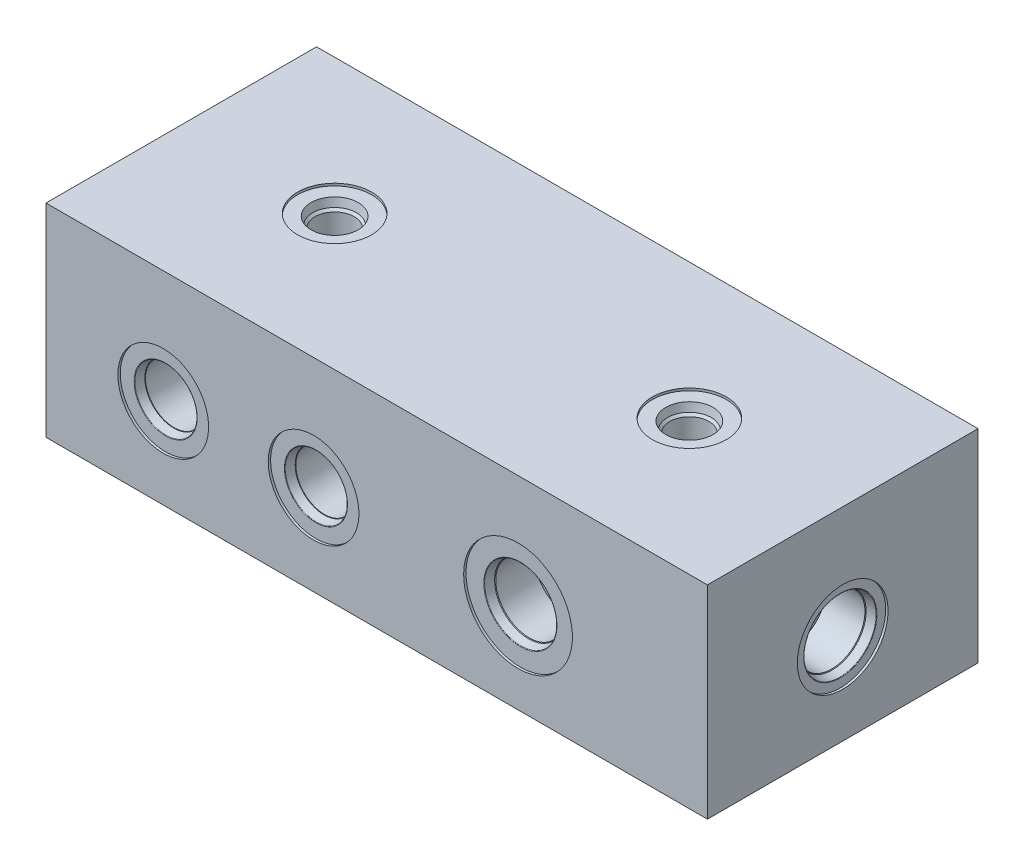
ISO-10303-21;
HEADER;
FILE_DESCRIPTION(('STEP AP214'),'2;1');
FILE_NAME('part.step','',(''),(''),'','','');
FILE_SCHEMA(('AUTOMOTIVE_DESIGN { 1 0 10303 214 1 1 1 1 }'));
ENDSEC;
DATA;
#1=APPLICATION_CONTEXT('core data for automotive mechanical design processes');
#2=APPLICATION_PROTOCOL_DEFINITION('international standard','automotive_design',2000,#1);
#3=PRODUCT_CONTEXT('',#1,'mechanical');
#4=PRODUCT('Part','Part','',(#3));
#5=PRODUCT_RELATED_PRODUCT_CATEGORY('part','',(#4));
#6=PRODUCT_DEFINITION_FORMATION('','',#4);
#7=PRODUCT_DEFINITION_CONTEXT('part definition',#1,'design');
#8=PRODUCT_DEFINITION('design','',#6,#7);
#9=PRODUCT_DEFINITION_SHAPE('','',#8);
#10=(LENGTH_UNIT() NAMED_UNIT(*) SI_UNIT(.MILLI.,.METRE.));
#11=(NAMED_UNIT(*) PLANE_ANGLE_UNIT() SI_UNIT($,.RADIAN.));
#12=(NAMED_UNIT(*) SI_UNIT($,.STERADIAN.) SOLID_ANGLE_UNIT());
#13=UNCERTAINTY_MEASURE_WITH_UNIT(LENGTH_MEASURE(1.E-05),#10,'distance_accuracy_value','');
#14=(GEOMETRIC_REPRESENTATION_CONTEXT(3) GLOBAL_UNCERTAINTY_ASSIGNED_CONTEXT((#13)) GLOBAL_UNIT_ASSIGNED_CONTEXT((#10,
#11,#12)) REPRESENTATION_CONTEXT('',''));
#15=CARTESIAN_POINT('',(0.,0.,0.));
#16=DIRECTION('',(0.,0.,1.));
#17=DIRECTION('',(1.,0.,0.));
#18=AXIS2_PLACEMENT_3D('',#15,#16,#17);
#19=CARTESIAN_POINT('',(0.,-30.,45.));
#20=DIRECTION('',(-1.,0.,0.));
#21=DIRECTION('',(0.,0.,1.));
#22=AXIS2_PLACEMENT_3D('',#19,#20,#21);
#23=PLANE('',#22);
#24=CARTESIAN_POINT('',(0.,0.,0.));
#25=DIRECTION('',(1.,0.,0.));
#26=DIRECTION('',(0.,0.,-1.));
#27=AXIS2_PLACEMENT_3D('',#24,#25,#26);
#28=CIRCLE('',#27,15.0876);
#29=CARTESIAN_POINT('',(0.,0.,-15.0876));
#30=VERTEX_POINT('',#29);
#31=EDGE_CURVE('E305',#30,#30,#28,.T.);
#32=ORIENTED_EDGE('',*,*,#31,.T.);
#33=EDGE_LOOP('',(#32));
#34=FACE_BOUND('',#33,.T.);
#35=DIRECTION('',(0.,1.,0.));
#36=VECTOR('',#35,1.);
#37=CARTESIAN_POINT('',(0.,-30.,45.));
#38=LINE('',#37,#36);
#39=CARTESIAN_POINT('',(0.,-30.,45.));
#40=VERTEX_POINT('',#39);
#41=CARTESIAN_POINT('',(0.,37.5,45.));
#42=VERTEX_POINT('',#41);
#43=EDGE_CURVE('E39',#40,#42,#38,.T.);
#44=ORIENTED_EDGE('',*,*,#43,.T.);
#45=DIRECTION('',(0.,0.,1.));
#46=VECTOR('',#45,1.);
#47=CARTESIAN_POINT('',(0.,37.5,45.));
#48=LINE('',#47,#46);
#49=CARTESIAN_POINT('',(0.,37.5,-45.));
#50=VERTEX_POINT('',#49);
#51=EDGE_CURVE('E308',#50,#42,#48,.T.);
#52=ORIENTED_EDGE('',*,*,#51,.F.);
#53=DIRECTION('',(0.,1.,0.));
#54=VECTOR('',#53,1.);
#55=CARTESIAN_POINT('',(0.,-30.,-45.));
#56=LINE('',#55,#54);
#57=CARTESIAN_POINT('',(0.,-30.,-45.));
#58=VERTEX_POINT('',#57);
#59=EDGE_CURVE('E11',#58,#50,#56,.T.);
#60=ORIENTED_EDGE('',*,*,#59,.F.);
#61=DIRECTION('',(0.,0.,1.));
#62=VECTOR('',#61,1.);
#63=CARTESIAN_POINT('',(0.,-30.,45.));
#64=LINE('',#63,#62);
#65=EDGE_CURVE('E310',#58,#40,#64,.T.);
#66=ORIENTED_EDGE('',*,*,#65,.T.);
#67=EDGE_LOOP('',(#44,#52,#60,#66));
#68=FACE_BOUND('',#67,.T.);
#69=ADVANCED_FACE('F36',(#34,#68),#23,.T.);
#70=CARTESIAN_POINT('',(0.,-30.,-45.));
#71=DIRECTION('',(0.,0.,-1.));
#72=DIRECTION('',(-1.,0.,0.));
#73=AXIS2_PLACEMENT_3D('',#70,#71,#72);
#74=PLANE('',#73);
#75=CARTESIAN_POINT('',(63.,0.,-45.));
#76=DIRECTION('',(0.,0.,1.));
#77=DIRECTION('',(1.,0.,0.));
#78=AXIS2_PLACEMENT_3D('',#75,#76,#77);
#79=CIRCLE('',#78,18.09);
#80=CARTESIAN_POINT('',(81.09,0.,-45.));
#81=VERTEX_POINT('',#80);
#82=EDGE_CURVE('E144',#81,#81,#79,.T.);
#83=ORIENTED_EDGE('',*,*,#82,.T.);
#84=EDGE_LOOP('',(#83));
#85=FACE_BOUND('',#84,.T.);
#86=CARTESIAN_POINT('',(181.,3.14233320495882E-13,-45.));
#87=DIRECTION('',(0.,0.,-1.));
#88=DIRECTION('',(1.,0.,0.));
#89=AXIS2_PLACEMENT_3D('',#86,#87,#88);
#90=CIRCLE('',#89,15.0875999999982);
#91=CARTESIAN_POINT('',(196.087599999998,3.14233320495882E-13,-45.));
#92=VERTEX_POINT('',#91);
#93=EDGE_CURVE('E1535',#92,#92,#90,.T.);
#94=ORIENTED_EDGE('',*,*,#93,.F.);
#95=EDGE_LOOP('',(#94));
#96=FACE_BOUND('',#95,.T.);
#97=CARTESIAN_POINT('',(131.,3.14233320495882E-13,-45.));
#98=DIRECTION('',(0.,0.,-1.));
#99=DIRECTION('',(1.,0.,0.));
#100=AXIS2_PLACEMENT_3D('',#97,#98,#99);
#101=CIRCLE('',#100,15.0875999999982);
#102=CARTESIAN_POINT('',(146.087599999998,3.14233320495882E-13,-45.));
#103=VERTEX_POINT('',#102);
#104=EDGE_CURVE('E1596',#103,#103,#101,.T.);
#105=ORIENTED_EDGE('',*,*,#104,.F.);
#106=EDGE_LOOP('',(#105));
#107=FACE_BOUND('',#106,.T.);
#108=ORIENTED_EDGE('',*,*,#59,.T.);
#109=DIRECTION('',(-1.,0.,0.));
#110=VECTOR('',#109,1.);
#111=CARTESIAN_POINT('',(0.,37.5,-45.));
#112=LINE('',#111,#110);
#113=CARTESIAN_POINT('',(220.,37.5,-45.));
#114=VERTEX_POINT('',#113);
#115=EDGE_CURVE('E325',#114,#50,#112,.T.);
#116=ORIENTED_EDGE('',*,*,#115,.F.);
#117=DIRECTION('',(0.,1.,0.));
#118=VECTOR('',#117,1.);
#119=CARTESIAN_POINT('',(220.,-30.,-45.));
#120=LINE('',#119,#118);
#121=CARTESIAN_POINT('',(220.,-30.,-45.));
#122=VERTEX_POINT('',#121);
#123=EDGE_CURVE('E44',#122,#114,#120,.T.);
#124=ORIENTED_EDGE('',*,*,#123,.F.);
#125=DIRECTION('',(-1.,0.,0.));
#126=VECTOR('',#125,1.);
#127=CARTESIAN_POINT('',(0.,-30.,-45.));
#128=LINE('',#127,#126);
#129=EDGE_CURVE('E315',#122,#58,#128,.T.);
#130=ORIENTED_EDGE('',*,*,#129,.T.);
#131=EDGE_LOOP('',(#108,#116,#124,#130));
#132=FACE_BOUND('',#131,.T.);
#133=ADVANCED_FACE('F295',(#85,#96,#107,#132),#74,.T.);
#134=CARTESIAN_POINT('',(220.,-30.,45.));
#135=DIRECTION('',(1.,0.,0.));
#136=DIRECTION('',(0.,0.,-1.));
#137=AXIS2_PLACEMENT_3D('',#134,#135,#136);
#138=PLANE('',#137);
#139=CARTESIAN_POINT('',(220.,0.,0.));
#140=DIRECTION('',(1.,0.,0.));
#141=DIRECTION('',(0.,0.,1.));
#142=AXIS2_PLACEMENT_3D('',#139,#140,#141);
#143=CIRCLE('',#142,15.0876);
#144=CARTESIAN_POINT('',(220.,-1.05356147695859E-13,15.0876));
#145=VERTEX_POINT('',#144);
#146=EDGE_CURVE('E1480',#145,#145,#143,.T.);
#147=ORIENTED_EDGE('',*,*,#146,.F.);
#148=EDGE_LOOP('',(#147));
#149=FACE_BOUND('',#148,.T.);
#150=ORIENTED_EDGE('',*,*,#123,.T.);
#151=DIRECTION('',(0.,0.,-1.));
#152=VECTOR('',#151,1.);
#153=CARTESIAN_POINT('',(220.,37.5,45.));
#154=LINE('',#153,#152);
#155=CARTESIAN_POINT('',(220.,37.5,45.));
#156=VERTEX_POINT('',#155);
#157=EDGE_CURVE('E322',#156,#114,#154,.T.);
#158=ORIENTED_EDGE('',*,*,#157,.F.);
#159=DIRECTION('',(0.,1.,0.));
#160=VECTOR('',#159,1.);
#161=CARTESIAN_POINT('',(220.,-30.,45.));
#162=LINE('',#161,#160);
#163=CARTESIAN_POINT('',(220.,-30.,45.));
#164=VERTEX_POINT('',#163);
#165=EDGE_CURVE('E314',#164,#156,#162,.T.);
#166=ORIENTED_EDGE('',*,*,#165,.F.);
#167=DIRECTION('',(0.,0.,-1.));
#168=VECTOR('',#167,1.);
#169=CARTESIAN_POINT('',(220.,-30.,45.));
#170=LINE('',#169,#168);
#171=EDGE_CURVE('E333',#164,#122,#170,.T.);
#172=ORIENTED_EDGE('',*,*,#171,.T.);
#173=EDGE_LOOP('',(#150,#158,#166,#172));
#174=FACE_BOUND('',#173,.T.);
#175=ADVANCED_FACE('F300',(#149,#174),#138,.T.);
#176=CARTESIAN_POINT('',(0.,-30.,45.));
#177=DIRECTION('',(0.,0.,1.));
#178=DIRECTION('',(1.,0.,0.));
#179=AXIS2_PLACEMENT_3D('',#176,#177,#178);
#180=PLANE('',#179);
#181=CARTESIAN_POINT('',(39.,0.,45.));
#182=DIRECTION('',(0.,0.,-1.));
#183=DIRECTION('',(-1.,0.,0.));
#184=AXIS2_PLACEMENT_3D('',#181,#182,#183);
#185=CIRCLE('',#184,15.0875999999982);
#186=CARTESIAN_POINT('',(23.9124000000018,0.,45.));
#187=VERTEX_POINT('',#186);
#188=EDGE_CURVE('E1735',#187,#187,#185,.T.);
#189=ORIENTED_EDGE('',*,*,#188,.T.);
#190=EDGE_LOOP('',(#189));
#191=FACE_BOUND('',#190,.T.);
#192=CARTESIAN_POINT('',(89.,0.,45.));
#193=DIRECTION('',(0.,0.,-1.));
#194=DIRECTION('',(-1.,0.,0.));
#195=AXIS2_PLACEMENT_3D('',#192,#193,#194);
#196=CIRCLE('',#195,15.0875999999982);
#197=CARTESIAN_POINT('',(73.9124000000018,0.,45.));
#198=VERTEX_POINT('',#197);
#199=EDGE_CURVE('E168',#198,#198,#196,.T.);
#200=ORIENTED_EDGE('',*,*,#199,.T.);
#201=EDGE_LOOP('',(#200));
#202=FACE_BOUND('',#201,.T.);
#203=CARTESIAN_POINT('',(157.,-3.14233320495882E-13,45.));
#204=DIRECTION('',(0.,0.,1.));
#205=DIRECTION('',(-1.,0.,0.));
#206=AXIS2_PLACEMENT_3D('',#203,#204,#205);
#207=CIRCLE('',#206,18.09);
#208=CARTESIAN_POINT('',(138.91,-3.14233320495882E-13,45.));
#209=VERTEX_POINT('',#208);
#210=EDGE_CURVE('E1627',#209,#209,#207,.T.);
#211=ORIENTED_EDGE('',*,*,#210,.F.);
#212=EDGE_LOOP('',(#211));
#213=FACE_BOUND('',#212,.T.);
#214=ORIENTED_EDGE('',*,*,#165,.T.);
#215=DIRECTION('',(1.,0.,0.));
#216=VECTOR('',#215,1.);
#217=CARTESIAN_POINT('',(0.,37.5,45.));
#218=LINE('',#217,#216);
#219=EDGE_CURVE('E317',#42,#156,#218,.T.);
#220=ORIENTED_EDGE('',*,*,#219,.F.);
#221=ORIENTED_EDGE('',*,*,#43,.F.);
#222=DIRECTION('',(1.,0.,0.));
#223=VECTOR('',#222,1.);
#224=CARTESIAN_POINT('',(0.,-30.,45.));
#225=LINE('',#224,#223);
#226=EDGE_CURVE('E331',#40,#164,#225,.T.);
#227=ORIENTED_EDGE('',*,*,#226,.T.);
#228=EDGE_LOOP('',(#214,#220,#221,#227));
#229=FACE_BOUND('',#228,.T.);
#230=ADVANCED_FACE('F318',(#191,#202,#213,#229),#180,.T.);
#231=CARTESIAN_POINT('',(0.,-30.,0.));
#232=DIRECTION('',(0.,-1.,0.));
#233=DIRECTION('',(0.,0.,-1.));
#234=AXIS2_PLACEMENT_3D('',#231,#232,#233);
#235=PLANE('',#234);
#236=ORIENTED_EDGE('',*,*,#65,.F.);
#237=ORIENTED_EDGE('',*,*,#129,.F.);
#238=ORIENTED_EDGE('',*,*,#171,.F.);
#239=ORIENTED_EDGE('',*,*,#226,.F.);
#240=EDGE_LOOP('',(#236,#237,#238,#239));
#241=FACE_BOUND('',#240,.T.);
#242=ADVANCED_FACE('F1343',(#241),#235,.T.);
#243=CARTESIAN_POINT('',(51.,37.5,0.));
#244=DIRECTION('',(0.,1.,0.));
#245=DIRECTION('',(-1.,0.,0.));
#246=AXIS2_PLACEMENT_3D('',#243,#244,#245);
#247=PLANE('',#246);
#248=CARTESIAN_POINT('',(51.,37.5,0.));
#249=DIRECTION('',(0.,-1.,0.));
#250=DIRECTION('',(1.,0.,0.));
#251=AXIS2_PLACEMENT_3D('',#248,#249,#250);
#252=CIRCLE('',#251,12.3189999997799);
#253=CARTESIAN_POINT('',(63.3189999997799,37.5,0.));
#254=VERTEX_POINT('',#253);
#255=EDGE_CURVE('E476',#254,#254,#252,.T.);
#256=ORIENTED_EDGE('',*,*,#255,.T.);
#257=EDGE_LOOP('',(#256));
#258=FACE_BOUND('',#257,.T.);
#259=CARTESIAN_POINT('',(169.,37.5,0.));
#260=DIRECTION('',(0.,-1.,0.));
#261=DIRECTION('',(1.,0.,0.));
#262=AXIS2_PLACEMENT_3D('',#259,#260,#261);
#263=CIRCLE('',#262,12.3189999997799);
#264=CARTESIAN_POINT('',(181.31899999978,37.5,0.));
#265=VERTEX_POINT('',#264);
#266=EDGE_CURVE('E349',#265,#265,#263,.T.);
#267=ORIENTED_EDGE('',*,*,#266,.T.);
#268=EDGE_LOOP('',(#267));
#269=FACE_BOUND('',#268,.T.);
#270=ORIENTED_EDGE('',*,*,#115,.T.);
#271=ORIENTED_EDGE('',*,*,#51,.T.);
#272=ORIENTED_EDGE('',*,*,#219,.T.);
#273=ORIENTED_EDGE('',*,*,#157,.T.);
#274=EDGE_LOOP('',(#270,#271,#272,#273));
#275=FACE_BOUND('',#274,.T.);
#276=ADVANCED_FACE('F324',(#258,#269,#275),#247,.T.);
#277=CARTESIAN_POINT('',(120.,0.,0.));
#278=DIRECTION('',(-1.,0.,0.));
#279=DIRECTION('',(0.,0.,1.));
#280=AXIS2_PLACEMENT_3D('',#277,#278,#279);
#281=CYLINDRICAL_SURFACE('',#280,8.76299999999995);
#282=CARTESIAN_POINT('',(173.762499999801,8.76299999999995,0.));
#283=CARTESIAN_POINT('',(173.762500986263,8.763000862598,0.123896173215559));
#284=CARTESIAN_POINT('',(173.75766065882,8.76036718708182,0.247780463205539));
#285=CARTESIAN_POINT('',(173.73836310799,8.74990175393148,0.494619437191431));
#286=CARTESIAN_POINT('',(173.723902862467,8.74206836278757,0.617573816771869));
#287=CARTESIAN_POINT('',(173.685528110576,8.72139184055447,0.861694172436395));
#288=CARTESIAN_POINT('',(173.661603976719,8.70854360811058,0.982858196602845));
#289=CARTESIAN_POINT('',(173.604583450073,8.67815476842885,1.22245256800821));
#290=CARTESIAN_POINT('',(173.571483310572,8.6606122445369,1.34088177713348));
#291=CARTESIAN_POINT('',(173.496652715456,8.62134777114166,1.57365666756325));
#292=CARTESIAN_POINT('',(173.454962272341,8.59964523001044,1.68801849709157));
#293=CARTESIAN_POINT('',(173.363273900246,8.55250741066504,1.91258364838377));
#294=CARTESIAN_POINT('',(173.313272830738,8.52707072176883,2.02278537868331));
#295=CARTESIAN_POINT('',(173.151495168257,8.44599958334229,2.34616836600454));
#296=CARTESIAN_POINT('',(173.0278692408,8.38556355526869,2.55235760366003));
#297=CARTESIAN_POINT('',(172.743271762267,8.25251378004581,2.95538828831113));
#298=CARTESIAN_POINT('',(172.580337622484,8.17935242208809,3.15065023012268));
#299=CARTESIAN_POINT('',(172.226058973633,8.03058544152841,3.51257650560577));
#300=CARTESIAN_POINT('',(172.034688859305,7.95497766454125,3.67921477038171));
#301=CARTESIAN_POINT('',(171.606954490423,7.80138250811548,3.995291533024));
#302=CARTESIAN_POINT('',(171.368037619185,7.72385890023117,4.14156173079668));
#303=CARTESIAN_POINT('',(170.990728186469,7.61952231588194,4.32876174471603));
#304=CARTESIAN_POINT('',(170.861757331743,7.58672614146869,4.38580760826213));
#305=CARTESIAN_POINT('',(170.598216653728,7.52639633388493,4.48854899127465));
#306=CARTESIAN_POINT('',(170.463650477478,7.49885933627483,4.53425177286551));
#307=CARTESIAN_POINT('',(170.19842451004,7.45178024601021,4.61118751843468));
#308=CARTESIAN_POINT('',(170.068044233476,7.43184673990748,4.64314496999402));
#309=CARTESIAN_POINT('',(169.80429956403,7.39855184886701,4.69601739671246));
#310=CARTESIAN_POINT('',(169.670936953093,7.38518664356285,4.71693879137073));
#311=CARTESIAN_POINT('',(169.402510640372,7.36565539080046,4.7473802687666));
#312=CARTESIAN_POINT('',(169.267448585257,7.35948284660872,4.7569106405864));
#313=CARTESIAN_POINT('',(168.996878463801,7.35462330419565,4.76442099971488));
#314=CARTESIAN_POINT('',(168.861370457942,7.35593532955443,4.76240249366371));
#315=CARTESIAN_POINT('',(168.611307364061,7.36523051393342,4.74801055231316));
#316=CARTESIAN_POINT('',(168.496620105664,7.37219735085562,4.73721425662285));
#317=CARTESIAN_POINT('',(168.268733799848,7.39125082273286,4.70742835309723));
#318=CARTESIAN_POINT('',(168.155535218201,7.40333902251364,4.68843624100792));
#319=CARTESIAN_POINT('',(167.819330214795,7.44671416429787,4.61948618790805));
#320=CARTESIAN_POINT('',(167.599571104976,7.48511776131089,4.55754591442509));
#321=CARTESIAN_POINT('',(167.169278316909,7.57726431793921,4.40266176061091));
#322=CARTESIAN_POINT('',(166.95905314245,7.63132556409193,4.30906700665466));
#323=CARTESIAN_POINT('',(166.556177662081,7.74879815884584,4.09405564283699));
#324=CARTESIAN_POINT('',(166.363535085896,7.81221358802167,3.97262687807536));
#325=CARTESIAN_POINT('',(165.970238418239,7.95295281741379,3.68379028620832));
#326=CARTESIAN_POINT('',(165.772892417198,8.03091747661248,3.51218601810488));
#327=CARTESIAN_POINT('',(165.408181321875,8.18428546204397,3.1382176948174));
#328=CARTESIAN_POINT('',(165.240835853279,8.25968708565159,2.93583366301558));
#329=CARTESIAN_POINT('',(165.010750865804,8.36767144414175,2.60517298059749));
#330=CARTESIAN_POINT('',(164.935673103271,8.40379750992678,2.48646264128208));
#331=CARTESIAN_POINT('',(164.795910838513,8.47227297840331,2.24205942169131));
#332=CARTESIAN_POINT('',(164.731221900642,8.50462399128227,2.11636955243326));
#333=CARTESIAN_POINT('',(164.61295954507,8.56459526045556,1.85885750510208));
#334=CARTESIAN_POINT('',(164.559380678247,8.59221783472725,1.72703837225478));
#335=CARTESIAN_POINT('',(164.463987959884,8.64190417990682,1.45819543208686));
#336=CARTESIAN_POINT('',(164.422172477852,8.66396872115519,1.32117234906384));
#337=CARTESIAN_POINT('',(164.354193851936,8.70008785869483,1.05588044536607));
#338=CARTESIAN_POINT('',(164.32694568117,8.71469208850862,0.927963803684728));
#339=CARTESIAN_POINT('',(164.283022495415,8.73832337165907,0.669824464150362));
#340=CARTESIAN_POINT('',(164.266346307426,8.74735104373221,0.539602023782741));
#341=CARTESIAN_POINT('',(164.243810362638,8.75956694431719,0.278015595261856));
#342=CARTESIAN_POINT('',(164.237945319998,8.76275802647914,0.146652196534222));
#343=CARTESIAN_POINT('',(164.237103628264,8.76321537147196,-0.116116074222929));
#344=CARTESIAN_POINT('',(164.242126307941,8.76048199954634,-0.247520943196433));
#345=CARTESIAN_POINT('',(164.261986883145,8.74971263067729,-0.496733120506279));
#346=CARTESIAN_POINT('',(164.275844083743,8.74220663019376,-0.614643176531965));
#347=CARTESIAN_POINT('',(164.312244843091,8.722589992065,-0.84876208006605));
#348=CARTESIAN_POINT('',(164.334791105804,8.71047792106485,-0.964970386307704));
#349=CARTESIAN_POINT('',(164.388312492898,8.68193013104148,-1.19484862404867));
#350=CARTESIAN_POINT('',(164.419284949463,8.66549578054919,-1.30851934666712));
#351=CARTESIAN_POINT('',(164.48933778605,8.62867062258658,-1.53269244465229));
#352=CARTESIAN_POINT('',(164.528421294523,8.60827828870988,-1.64319357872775));
#353=CARTESIAN_POINT('',(164.659297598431,8.54076838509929,-1.97400696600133));
#354=CARTESIAN_POINT('',(164.763493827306,8.48799056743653,-2.18841185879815));
#355=CARTESIAN_POINT('',(165.000981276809,8.37198930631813,-2.59716593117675));
#356=CARTESIAN_POINT('',(165.134283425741,8.30876194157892,-2.7915075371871));
#357=CARTESIAN_POINT('',(165.443028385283,8.16943983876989,-3.17757890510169));
#358=CARTESIAN_POINT('',(165.621497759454,8.092695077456,-3.36665543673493));
#359=CARTESIAN_POINT('',(166.007093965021,7.93945682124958,-3.71365399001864));
#360=CARTESIAN_POINT('',(166.214249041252,7.8629636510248,-3.87154492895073));
#361=CARTESIAN_POINT('',(166.551709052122,7.75180610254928,-4.0874078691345));
#362=CARTESIAN_POINT('',(166.673240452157,7.71415952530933,-4.15781652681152));
#363=CARTESIAN_POINT('',(166.92289201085,7.64256865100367,-4.28798572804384));
#364=CARTESIAN_POINT('',(167.051008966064,7.60862257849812,-4.34775138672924));
#365=CARTESIAN_POINT('',(167.31299639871,7.54576648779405,-4.45595056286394));
#366=CARTESIAN_POINT('',(167.446861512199,7.51685189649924,-4.50439438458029));
#367=CARTESIAN_POINT('',(167.719501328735,7.46528915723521,-4.58934661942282));
#368=CARTESIAN_POINT('',(167.858275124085,7.44263985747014,-4.62585722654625));
#369=CARTESIAN_POINT('',(168.125813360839,7.4065610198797,-4.68338127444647));
#370=CARTESIAN_POINT('',(168.254235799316,7.39244823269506,-4.70555796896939));
#371=CARTESIAN_POINT('',(168.513009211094,7.37084191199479,-4.73933166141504));
#372=CARTESIAN_POINT('',(168.643359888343,7.36334737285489,-4.75093026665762));
#373=CARTESIAN_POINT('',(168.904706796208,7.35532426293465,-4.76334223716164));
#374=CARTESIAN_POINT('',(169.035702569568,7.35479131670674,-4.76416237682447));
#375=CARTESIAN_POINT('',(169.29715045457,7.36070535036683,-4.75502003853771));
#376=CARTESIAN_POINT('',(169.427602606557,7.36715180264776,-4.74505837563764));
#377=CARTESIAN_POINT('',(169.669792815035,7.38544271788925,-4.7165291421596));
#378=CARTESIAN_POINT('',(169.78174807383,7.39647140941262,-4.69925673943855));
#379=CARTESIAN_POINT('',(170.003620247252,7.42319765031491,-4.65692223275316));
#380=CARTESIAN_POINT('',(170.11353654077,7.43889659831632,-4.63185779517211));
#381=CARTESIAN_POINT('',(170.439225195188,7.49228967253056,-4.54537247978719));
#382=CARTESIAN_POINT('',(170.651072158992,7.53629114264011,-4.47264332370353));
#383=CARTESIAN_POINT('',(171.072791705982,7.63941430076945,-4.29426434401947));
#384=CARTESIAN_POINT('',(171.28170903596,7.69931058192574,-4.18683745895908));
#385=CARTESIAN_POINT('',(171.679988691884,7.82658698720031,-3.94379478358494));
#386=CARTESIAN_POINT('',(171.869340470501,7.89397110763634,-3.80816390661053));
#387=CARTESIAN_POINT('',(172.253113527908,8.04086032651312,-3.48857764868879));
#388=CARTESIAN_POINT('',(172.443928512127,8.12065064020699,-3.30041027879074));
#389=CARTESIAN_POINT('',(172.792525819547,8.27451091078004,-2.89308256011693));
#390=CARTESIAN_POINT('',(172.950285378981,8.34857690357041,-2.67390102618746));
#391=CARTESIAN_POINT('',(173.160527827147,8.45073302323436,-2.32183777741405));
#392=CARTESIAN_POINT('',(173.227004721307,8.48372301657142,-2.19854156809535));
#393=CARTESIAN_POINT('',(173.349183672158,8.54525400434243,-1.94568545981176));
#394=CARTESIAN_POINT('',(173.404891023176,8.57379718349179,-1.8161286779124));
#395=CARTESIAN_POINT('',(173.504764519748,8.62553457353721,-1.55190682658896));
#396=CARTESIAN_POINT('',(173.548953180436,8.64873920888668,-1.41725232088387));
#397=CARTESIAN_POINT('',(173.625295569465,8.68913526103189,-1.14376015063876));
#398=CARTESIAN_POINT('',(173.657455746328,8.70632989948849,-1.00492477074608));
#399=CARTESIAN_POINT('',(173.709584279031,8.73432633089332,-0.722555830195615));
#400=CARTESIAN_POINT('',(173.729397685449,8.74504682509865,-0.578985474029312));
#401=CARTESIAN_POINT('',(173.755854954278,8.75938314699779,-0.290271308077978));
#402=CARTESIAN_POINT('',(173.762498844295,8.76299898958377,-0.145127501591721));
#403=CARTESIAN_POINT('',(173.762499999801,8.76299999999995,0.));
#404=B_SPLINE_CURVE_WITH_KNOTS('',3,(#282,#283,#284,#285,#286,#287,#288,#289,#290,#291,#292,
#293,#294,#295,#296,#297,#298,#299,#300,#301,#302,#303,#304,#305,#306,#307,#308,#309,#310,#311,
#312,#313,#314,#315,#316,#317,#318,#319,#320,#321,#322,#323,#324,#325,#326,#327,#328,#329,#330,
#331,#332,#333,#334,#335,#336,#337,#338,#339,#340,#341,#342,#343,#344,#345,#346,#347,#348,#349,
#350,#351,#352,#353,#354,#355,#356,#357,#358,#359,#360,#361,#362,#363,#364,#365,#366,#367,#368,
#369,#370,#371,#372,#373,#374,#375,#376,#377,#378,#379,#380,#381,#382,#383,#384,#385,#386,#387,
#388,#389,#390,#391,#392,#393,#394,#395,#396,#397,#398,#399,#400,#401,#402,#403),.UNSPECIFIED.,
.T.,.F.,(4,2,2,2,2,2,2,2,2,2,2,2,2,2,2,2,2,2,2,2,2,2,2,2,2,2,2,2,2,2,2,2,2,2,2,2,2,2,2,2,2,2,2,
2,2,2,2,2,2,2,2,2,2,2,2,2,2,2,2,2,4),(0.,0.371546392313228,0.743209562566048,1.11525179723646,
1.48744616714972,1.8579445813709,2.22858332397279,2.96913291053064,3.75985018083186,
4.55128381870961,5.41839521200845,5.85223525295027,6.28579681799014,6.6923275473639,
7.09862154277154,7.50454827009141,7.91042204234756,8.25621179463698,8.60210727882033,
9.29347221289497,10.0000171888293,10.7068712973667,11.5222104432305,12.3380810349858,
12.7726794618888,13.2070918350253,13.6412906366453,14.0754292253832,14.4696849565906,
14.8638969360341,15.2579161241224,15.651911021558,16.0083696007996,16.364939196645,
16.721396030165,17.0779906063,17.8071970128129,18.5366776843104,19.3466323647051,
20.1573902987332,20.593137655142,21.0286750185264,21.463814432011,21.8988737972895,
22.29154815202,22.6841628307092,23.0765307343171,23.4688689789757,23.809921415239,
24.1510760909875,24.8329814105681,25.5576093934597,26.282625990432,27.1178737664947,
27.9536948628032,28.384911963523,28.8159165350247,29.2460722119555,29.6759969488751,
30.111213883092,30.546429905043),.UNSPECIFIED.);
#405=CARTESIAN_POINT('',(173.762499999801,8.76299999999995,0.));
#406=VERTEX_POINT('',#405);
#407=EDGE_CURVE('E340',#406,#406,#404,.T.);
#408=ORIENTED_EDGE('',*,*,#407,.F.);
#409=EDGE_LOOP('',(#408));
#410=FACE_BOUND('',#409,.T.);
#411=CARTESIAN_POINT('',(125.265341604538,-2.78557323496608,-8.30847463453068));
#412=CARTESIAN_POINT('',(125.348658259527,-2.95709362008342,-8.25099233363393));
#413=CARTESIAN_POINT('',(125.439051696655,-3.12361427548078,-8.18923390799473));
#414=CARTESIAN_POINT('',(125.632793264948,-3.44588556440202,-8.0589151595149));
#415=CARTESIAN_POINT('',(125.736128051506,-3.60164703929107,-7.99036185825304));
#416=CARTESIAN_POINT('',(125.954660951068,-3.90189007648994,-7.84812312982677));
#417=CARTESIAN_POINT('',(126.069851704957,-4.04637853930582,-7.77444089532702));
#418=CARTESIAN_POINT('',(126.311320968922,-4.32387005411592,-7.62359841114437));
#419=CARTESIAN_POINT('',(126.437602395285,-4.45687006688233,-7.54643724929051));
#420=CARTESIAN_POINT('',(126.700074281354,-4.71057921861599,-7.39071609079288));
#421=CARTESIAN_POINT('',(126.836225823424,-4.83133256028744,-7.3121624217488));
#422=CARTESIAN_POINT('',(127.118401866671,-5.06083024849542,-7.1552420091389));
#423=CARTESIAN_POINT('',(127.264426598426,-5.16957431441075,-7.07687526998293));
#424=CARTESIAN_POINT('',(127.566106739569,-5.37469656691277,-6.92237569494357));
#425=CARTESIAN_POINT('',(127.721763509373,-5.47107300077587,-6.84624317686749));
#426=CARTESIAN_POINT('',(128.042382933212,-5.65084369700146,-6.69863205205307));
#427=CARTESIAN_POINT('',(128.207342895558,-5.73424168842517,-6.62715211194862));
#428=CARTESIAN_POINT('',(128.627339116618,-5.92380882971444,-6.45920968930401));
#429=CARTESIAN_POINT('',(128.887917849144,-6.02195670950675,-6.36702405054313));
#430=CARTESIAN_POINT('',(129.291836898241,-6.14391415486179,-6.24865757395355));
#431=CARTESIAN_POINT('',(129.428581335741,-6.18034419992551,-6.21253361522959));
#432=CARTESIAN_POINT('',(129.70593904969,-6.24430578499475,-6.1482409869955));
#433=CARTESIAN_POINT('',(129.846550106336,-6.27184231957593,-6.12006785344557));
#434=CARTESIAN_POINT('',(130.132547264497,-6.31779056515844,-6.07262750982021));
#435=CARTESIAN_POINT('',(130.277970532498,-6.33608801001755,-6.05347201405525));
#436=CARTESIAN_POINT('',(130.57073482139,-6.36262929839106,-6.02556994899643));
#437=CARTESIAN_POINT('',(130.718075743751,-6.37087365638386,-6.0168228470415));
#438=CARTESIAN_POINT('',(131.013169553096,-6.37709369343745,-6.01023017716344));
#439=CARTESIAN_POINT('',(131.160922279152,-6.37507293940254,-6.01238082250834));
#440=CARTESIAN_POINT('',(131.455369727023,-6.36082454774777,-6.02745269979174));
#441=CARTESIAN_POINT('',(131.60206449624,-6.34859737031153,-6.04037344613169));
#442=CARTESIAN_POINT('',(131.87094471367,-6.31685305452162,-6.073546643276));
#443=CARTESIAN_POINT('',(131.993473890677,-6.29872234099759,-6.09239039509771));
#444=CARTESIAN_POINT('',(132.236139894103,-6.25562841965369,-6.13663053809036));
#445=CARTESIAN_POINT('',(132.356275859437,-6.23066279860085,-6.16202924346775));
#446=CARTESIAN_POINT('',(132.712433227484,-6.14595885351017,-6.24689965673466));
#447=CARTESIAN_POINT('',(132.944153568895,-6.07641960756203,-6.31503886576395));
#448=CARTESIAN_POINT('',(133.339225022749,-5.93352644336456,-6.4490749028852));
#449=CARTESIAN_POINT('',(133.505619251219,-5.86510945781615,-6.5115720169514));
#450=CARTESIAN_POINT('',(133.830022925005,-5.71564281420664,-6.64315537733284));
#451=CARTESIAN_POINT('',(133.98802855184,-5.63458746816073,-6.71224458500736));
#452=CARTESIAN_POINT('',(134.295600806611,-5.46040702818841,-6.85469217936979));
#453=CARTESIAN_POINT('',(134.445151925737,-5.36726072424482,-6.92805794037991));
#454=CARTESIAN_POINT('',(134.735339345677,-5.16950565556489,-7.07684228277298));
#455=CARTESIAN_POINT('',(134.875976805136,-5.06489838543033,-7.15226059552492));
#456=CARTESIAN_POINT('',(135.151471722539,-4.84181594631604,-7.30518376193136));
#457=CARTESIAN_POINT('',(135.286101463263,-4.72306264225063,-7.38269425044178));
#458=CARTESIAN_POINT('',(135.545344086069,-4.47413639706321,-7.5361597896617));
#459=CARTESIAN_POINT('',(135.669953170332,-4.34395916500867,-7.61211424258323));
#460=CARTESIAN_POINT('',(136.027442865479,-3.93708877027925,-7.83484172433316));
#461=CARTESIAN_POINT('',(136.244671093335,-3.6435042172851,-7.97687297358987));
#462=CARTESIAN_POINT('',(136.599350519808,-3.0642143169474,-8.21479254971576));
#463=CARTESIAN_POINT('',(136.743965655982,-2.78446101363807,-8.31442346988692));
#464=CARTESIAN_POINT('',(136.930130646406,-2.34617557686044,-8.44446276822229));
#465=CARTESIAN_POINT('',(136.987071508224,-2.19692480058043,-8.4845835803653));
#466=CARTESIAN_POINT('',(137.089993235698,-1.89299058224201,-8.5575192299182));
#467=CARTESIAN_POINT('',(137.135978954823,-1.73830958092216,-8.59033730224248));
#468=CARTESIAN_POINT('',(137.2166107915,-1.4234033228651,-8.64811531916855));
#469=CARTESIAN_POINT('',(137.251176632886,-1.26314721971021,-8.67301958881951));
#470=CARTESIAN_POINT('',(137.307961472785,-0.939340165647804,-8.71403666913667));
#471=CARTESIAN_POINT('',(137.330180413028,-0.77578919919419,-8.73014943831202));
#472=CARTESIAN_POINT('',(137.361863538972,-0.446880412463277,-8.75314987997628));
#473=CARTESIAN_POINT('',(137.371333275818,-0.281523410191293,-8.76004156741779));
#474=CARTESIAN_POINT('',(137.377356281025,0.0495423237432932,-8.7644230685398));
#475=CARTESIAN_POINT('',(137.373910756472,0.215251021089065,-8.76191376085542));
#476=CARTESIAN_POINT('',(137.355258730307,0.527360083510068,-8.74835550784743));
#477=CARTESIAN_POINT('',(137.341383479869,0.673884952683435,-8.73827327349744));
#478=CARTESIAN_POINT('',(137.303651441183,0.965014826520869,-8.71092967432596));
#479=CARTESIAN_POINT('',(137.279791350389,1.10961917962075,-8.69366593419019));
#480=CARTESIAN_POINT('',(137.222427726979,1.39585857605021,-8.65232084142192));
#481=CARTESIAN_POINT('',(137.188926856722,1.53749442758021,-8.62824137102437));
#482=CARTESIAN_POINT('',(137.112694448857,1.8170567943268,-8.57372543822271));
#483=CARTESIAN_POINT('',(137.069959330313,1.95498184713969,-8.54328650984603));
#484=CARTESIAN_POINT('',(136.97471259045,2.22936862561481,-8.47587611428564));
#485=CARTESIAN_POINT('',(136.92200589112,2.36573075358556,-8.43877521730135));
#486=CARTESIAN_POINT('',(136.808017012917,2.63321546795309,-8.35917741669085));
#487=CARTESIAN_POINT('',(136.746731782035,2.76433616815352,-8.31667859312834));
#488=CARTESIAN_POINT('',(136.550877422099,3.1489982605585,-8.18215317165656));
#489=CARTESIAN_POINT('',(136.404237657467,3.39404390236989,-8.08304582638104));
#490=CARTESIAN_POINT('',(136.057865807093,3.89494049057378,-7.85536717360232));
#491=CARTESIAN_POINT('',(135.853417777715,4.14649411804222,-7.72461180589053));
#492=CARTESIAN_POINT('',(135.411189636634,4.61421079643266,-7.45467425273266));
#493=CARTESIAN_POINT('',(135.173344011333,4.83030243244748,-7.31547581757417));
#494=CARTESIAN_POINT('',(134.771008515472,5.14403548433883,-7.09573005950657));
#495=CARTESIAN_POINT('',(134.616313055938,5.25397027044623,-7.01448417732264));
#496=CARTESIAN_POINT('',(134.296501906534,5.46031411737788,-6.85507911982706));
#497=CARTESIAN_POINT('',(134.131382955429,5.55671891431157,-6.77692092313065));
#498=CARTESIAN_POINT('',(133.791312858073,5.73507346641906,-6.62666444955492));
#499=CARTESIAN_POINT('',(133.616381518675,5.8170510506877,-6.5545546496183));
#500=CARTESIAN_POINT('',(133.256903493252,5.96573273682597,-6.41952266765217));
#501=CARTESIAN_POINT('',(133.072363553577,6.03244738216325,-6.3565941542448));
#502=CARTESIAN_POINT('',(132.63987325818,6.16613066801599,-6.22736202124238));
#503=CARTESIAN_POINT('',(132.388882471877,6.22771467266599,-6.16524066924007));
#504=CARTESIAN_POINT('',(132.004553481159,6.29710958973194,-6.09406652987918));
#505=CARTESIAN_POINT('',(131.875199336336,6.31640736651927,-6.07401406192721));
#506=CARTESIAN_POINT('',(131.614583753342,6.34706162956,-6.04197657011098));
#507=CARTESIAN_POINT('',(131.483323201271,6.35842169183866,-6.02998791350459));
#508=CARTESIAN_POINT('',(131.219125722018,6.37301446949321,-6.0145631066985));
#509=CARTESIAN_POINT('',(131.086183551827,6.37620236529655,-6.01117412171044));
#510=CARTESIAN_POINT('',(130.820431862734,6.37425566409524,-6.01323838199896));
#511=CARTESIAN_POINT('',(130.687622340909,6.36912125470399,-6.01869142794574));
#512=CARTESIAN_POINT('',(130.423131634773,6.35063275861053,-6.03819597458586));
#513=CARTESIAN_POINT('',(130.291451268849,6.3372731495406,-6.05225325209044));
#514=CARTESIAN_POINT('',(130.030207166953,6.30258722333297,-6.08836476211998));
#515=CARTESIAN_POINT('',(129.900644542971,6.28125685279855,-6.11042306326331));
#516=CARTESIAN_POINT('',(129.620282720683,6.22624905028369,-6.1665072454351));
#517=CARTESIAN_POINT('',(129.470086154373,6.19100178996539,-6.20200550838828));
#518=CARTESIAN_POINT('',(129.174633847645,6.1104207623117,-6.28141065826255));
#519=CARTESIAN_POINT('',(129.029381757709,6.06507972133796,-6.32532360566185));
#520=CARTESIAN_POINT('',(128.744088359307,5.96485568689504,-6.419923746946));
#521=CARTESIAN_POINT('',(128.604060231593,5.90995030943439,-6.47062676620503));
#522=CARTESIAN_POINT('',(128.329902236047,5.79125323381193,-6.57707462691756));
#523=CARTESIAN_POINT('',(128.195770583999,5.72746424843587,-6.63281792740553));
#524=CARTESIAN_POINT('',(127.892376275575,5.570103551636,-6.76592861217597));
#525=CARTESIAN_POINT('',(127.725271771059,5.4734619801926,-6.84459957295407));
#526=CARTESIAN_POINT('',(127.401559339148,5.26629826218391,-7.00524612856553));
#527=CARTESIAN_POINT('',(127.244954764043,5.15577171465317,-7.08722276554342));
#528=CARTESIAN_POINT('',(126.942758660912,4.92148382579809,-7.25187054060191));
#529=CARTESIAN_POINT('',(126.797152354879,4.7977408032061,-7.33454057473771));
#530=CARTESIAN_POINT('',(126.517264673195,4.53733011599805,-7.49843373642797));
#531=CARTESIAN_POINT('',(126.38298041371,4.40066576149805,-7.57965722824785));
#532=CARTESIAN_POINT('',(126.059853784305,4.04050188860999,-7.77984904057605));
#533=CARTESIAN_POINT('',(125.878718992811,3.80865131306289,-7.89660954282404));
#534=CARTESIAN_POINT('',(125.630434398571,3.44027094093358,-8.06057392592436));
#535=CARTESIAN_POINT('',(125.551541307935,3.31397323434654,-8.11339024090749));
#536=CARTESIAN_POINT('',(125.402061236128,3.05470040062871,-8.21452059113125));
#537=CARTESIAN_POINT('',(125.331480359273,2.9217204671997,-8.26283131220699));
#538=CARTESIAN_POINT('',(125.265341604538,2.7855732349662,-8.30847463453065));
#539=B_SPLINE_CURVE_WITH_KNOTS('',3,(#411,#412,#413,#414,#415,#416,#417,#418,#419,#420,#421,
#422,#423,#424,#425,#426,#427,#428,#429,#430,#431,#432,#433,#434,#435,#436,#437,#438,#439,#440,
#441,#442,#443,#444,#445,#446,#447,#448,#449,#450,#451,#452,#453,#454,#455,#456,#457,#458,#459,
#460,#461,#462,#463,#464,#465,#466,#467,#468,#469,#470,#471,#472,#473,#474,#475,#476,#477,#478,
#479,#480,#481,#482,#483,#484,#485,#486,#487,#488,#489,#490,#491,#492,#493,#494,#495,#496,#497,
#498,#499,#500,#501,#502,#503,#504,#505,#506,#507,#508,#509,#510,#511,#512,#513,#514,#515,#516,
#517,#518,#519,#520,#521,#522,#523,#524,#525,#526,#527,#528,#529,#530,#531,#532,#533,#534,#535,
#536,#537,#538),.UNSPECIFIED.,.F.,.F.,(4,2,2,2,2,2,2,2,2,2,2,2,2,2,2,2,2,2,2,2,2,2,2,2,2,2,2,2,
2,2,2,2,2,2,2,2,2,2,2,2,2,2,2,2,2,2,2,2,2,2,2,2,2,2,2,2,2,2,2,2,2,2,2,4),(0.,0.597089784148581,
1.19356886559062,1.78967991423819,2.38594818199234,2.97998138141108,3.57402845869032,
4.16815963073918,4.76211977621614,5.63843073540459,6.07615618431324,6.51363537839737,
6.95640021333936,7.39914238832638,7.84173073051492,8.28429911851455,8.65976388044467,
9.03536138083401,9.78670891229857,10.3574110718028,10.9283708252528,11.5003460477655,
12.0722467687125,12.6582352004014,13.2444446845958,14.4140015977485,15.4005981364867,
15.8941852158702,16.3875532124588,16.884319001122,17.3810871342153,17.8776388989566,
18.3741442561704,18.816198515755,19.2583991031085,19.7004776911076,20.1427280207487,
20.594745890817,21.0469249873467,21.9506217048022,22.9955634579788,24.0425844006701,
24.6612886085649,25.2801873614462,25.8978788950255,26.5151424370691,27.3089480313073,
27.7054781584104,28.101829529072,28.500350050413,28.8988615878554,29.29764097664,
29.6966234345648,30.1708440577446,30.6454075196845,31.1210969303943,31.5966413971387,
32.2211617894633,32.8458806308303,33.4697445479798,34.0934490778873,35.039767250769,
35.513413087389,35.9874046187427),.UNSPECIFIED.);
#540=CARTESIAN_POINT('',(125.265341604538,-2.78557323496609,-8.30847463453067));
#541=VERTEX_POINT('',#540);
#542=CARTESIAN_POINT('',(125.265341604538,2.7855732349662,-8.30847463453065));
#543=VERTEX_POINT('',#542);
#544=EDGE_CURVE('E1504',#541,#543,#539,.T.);
#545=ORIENTED_EDGE('',*,*,#544,.F.);
#546=CARTESIAN_POINT('',(125.265341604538,0.,0.));
#547=DIRECTION('',(1.,0.,0.));
#548=DIRECTION('',(0.,0.,1.));
#549=AXIS2_PLACEMENT_3D('',#546,#547,#548);
#550=CIRCLE('',#549,8.76299999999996);
#551=EDGE_CURVE('E1482',#543,#541,#550,.T.);
#552=ORIENTED_EDGE('',*,*,#551,.F.);
#553=EDGE_LOOP('',(#545,#552));
#554=FACE_BOUND('',#553,.T.);
#555=CARTESIAN_POINT('',(195.7938,0.,0.));
#556=DIRECTION('',(1.,0.,0.));
#557=DIRECTION('',(0.,0.,1.));
#558=AXIS2_PLACEMENT_3D('',#555,#556,#557);
#559=CIRCLE('',#558,8.76299999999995);
#560=CARTESIAN_POINT('',(195.7938,0.,8.76299999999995));
#561=VERTEX_POINT('',#560);
#562=EDGE_CURVE('E1486',#561,#561,#559,.T.);
#563=ORIENTED_EDGE('',*,*,#562,.T.);
#564=EDGE_LOOP('',(#563));
#565=FACE_BOUND('',#564,.T.);
#566=CARTESIAN_POINT('',(187.3754,0.,-8.76299999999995));
#567=CARTESIAN_POINT('',(187.375398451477,0.156836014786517,-8.76299851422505));
#568=CARTESIAN_POINT('',(187.369602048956,0.313717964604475,-8.75877897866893));
#569=CARTESIAN_POINT('',(187.34650408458,0.626253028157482,-8.74199616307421));
#570=CARTESIAN_POINT('',(187.329195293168,0.781905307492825,-8.72942764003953));
#571=CARTESIAN_POINT('',(187.28330565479,1.09098566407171,-8.69621311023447));
#572=CARTESIAN_POINT('',(187.254702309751,1.24440866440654,-8.6755509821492));
#573=CARTESIAN_POINT('',(187.186652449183,1.54765014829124,-8.6266189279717));
#574=CARTESIAN_POINT('',(187.147201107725,1.69746699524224,-8.59834561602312));
#575=CARTESIAN_POINT('',(187.058299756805,1.99152342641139,-8.53501443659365));
#576=CARTESIAN_POINT('',(187.008916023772,2.13579280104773,-8.50000160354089));
#577=CARTESIAN_POINT('',(186.900595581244,2.41903255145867,-8.42377581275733));
#578=CARTESIAN_POINT('',(186.841655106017,2.55800081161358,-8.38256041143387));
#579=CARTESIAN_POINT('',(186.65153191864,2.9657540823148,-8.25080903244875));
#580=CARTESIAN_POINT('',(186.506926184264,3.22578150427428,-8.15207989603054));
#581=CARTESIAN_POINT('',(186.172240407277,3.74121599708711,-7.92965665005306));
#582=CARTESIAN_POINT('',(185.979220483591,3.99405149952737,-7.80450859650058));
#583=CARTESIAN_POINT('',(185.56061305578,4.46611853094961,-7.54430891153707));
#584=CARTESIAN_POINT('',(185.334974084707,4.68529580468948,-7.40924179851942));
#585=CARTESIAN_POINT('',(184.951552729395,5.00657888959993,-7.19342042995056));
#586=CARTESIAN_POINT('',(184.803187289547,5.12020670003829,-7.11277038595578));
#587=CARTESIAN_POINT('',(184.496238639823,5.33451863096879,-6.95347979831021));
#588=CARTESIAN_POINT('',(184.337652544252,5.43519907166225,-6.87483983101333));
#589=CARTESIAN_POINT('',(184.010708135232,5.62288473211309,-6.72219876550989));
#590=CARTESIAN_POINT('',(183.842361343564,5.70990564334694,-6.6481924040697));
#591=CARTESIAN_POINT('',(183.496120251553,5.86953799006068,-6.50768693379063));
#592=CARTESIAN_POINT('',(183.318231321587,5.94215742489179,-6.44118366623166));
#593=CARTESIAN_POINT('',(182.890977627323,6.09402533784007,-6.29820098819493));
#594=CARTESIAN_POINT('',(182.637853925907,6.16715113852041,-6.22600241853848));
#595=CARTESIAN_POINT('',(182.248599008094,6.25335207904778,-6.13900734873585));
#596=CARTESIAN_POINT('',(182.117323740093,6.27816424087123,-6.11356721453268));
#597=CARTESIAN_POINT('',(181.8522180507,6.31960563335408,-6.07072062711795));
#598=CARTESIAN_POINT('',(181.718388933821,6.33623893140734,-6.05331018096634));
#599=CARTESIAN_POINT('',(181.448048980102,6.36109639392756,-6.02718449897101));
#600=CARTESIAN_POINT('',(181.311525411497,6.36925457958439,-6.01853749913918));
#601=CARTESIAN_POINT('',(181.037963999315,6.37675490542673,-6.01059040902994));
#602=CARTESIAN_POINT('',(180.900926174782,6.37609736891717,-6.01128997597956));
#603=CARTESIAN_POINT('',(180.627460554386,6.36597787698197,-6.0220052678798));
#604=CARTESIAN_POINT('',(180.491033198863,6.35651035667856,-6.03202688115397));
#605=CARTESIAN_POINT('',(180.219999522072,6.32897205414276,-6.06091370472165));
#606=CARTESIAN_POINT('',(180.085393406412,6.3109003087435,-6.07977990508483));
#607=CARTESIAN_POINT('',(179.803677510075,6.26396025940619,-6.12815074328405));
#608=CARTESIAN_POINT('',(179.656901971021,6.23409224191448,-6.1586265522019));
#609=CARTESIAN_POINT('',(179.367654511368,6.16468336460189,-6.22810180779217));
#610=CARTESIAN_POINT('',(179.225185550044,6.12513601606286,-6.26710697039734));
#611=CARTESIAN_POINT('',(178.94497806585,6.03690550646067,-6.35214110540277));
#612=CARTESIAN_POINT('',(178.807248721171,5.98820568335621,-6.39818285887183));
#613=CARTESIAN_POINT('',(178.537177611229,5.88228438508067,-6.4956971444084));
#614=CARTESIAN_POINT('',(178.404834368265,5.82506526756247,-6.54716817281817));
#615=CARTESIAN_POINT('',(178.10188969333,5.68185285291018,-6.67222126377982));
#616=CARTESIAN_POINT('',(177.933452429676,5.59266619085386,-6.74740253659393));
#617=CARTESIAN_POINT('',(177.606634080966,5.40062350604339,-6.9020757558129));
#618=CARTESIAN_POINT('',(177.448256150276,5.29776322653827,-6.98156904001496));
#619=CARTESIAN_POINT('',(177.141671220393,5.07883179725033,-7.14241594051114));
#620=CARTESIAN_POINT('',(176.993473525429,4.96274881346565,-7.22377117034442));
#621=CARTESIAN_POINT('',(176.707787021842,4.71784125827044,-7.38604922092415));
#622=CARTESIAN_POINT('',(176.570297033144,4.58901809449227,-7.46697208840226));
#623=CARTESIAN_POINT('',(176.304891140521,4.31719970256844,-7.62739654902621));
#624=CARTESIAN_POINT('',(176.177119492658,4.17404485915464,-7.7068669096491));
#625=CARTESIAN_POINT('',(175.933941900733,3.87529013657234,-7.86133408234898));
#626=CARTESIAN_POINT('',(175.818537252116,3.71968895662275,-7.93633042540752));
#627=CARTESIAN_POINT('',(175.60140395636,3.3968591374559,-8.07976833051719));
#628=CARTESIAN_POINT('',(175.499649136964,3.22965371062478,-8.14822236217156));
#629=CARTESIAN_POINT('',(175.310864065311,2.88412465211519,-8.27683137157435));
#630=CARTESIAN_POINT('',(175.223828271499,2.70580523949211,-8.33698947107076));
#631=CARTESIAN_POINT('',(175.086132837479,2.38619830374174,-8.43306029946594));
#632=CARTESIAN_POINT('',(175.031867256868,2.24713268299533,-8.47123541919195));
#633=CARTESIAN_POINT('',(174.932843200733,1.96412678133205,-8.54128848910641));
#634=CARTESIAN_POINT('',(174.888082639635,1.82018757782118,-8.57316782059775));
#635=CARTESIAN_POINT('',(174.808641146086,1.5282889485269,-8.62998250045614));
#636=CARTESIAN_POINT('',(174.773954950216,1.38033166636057,-8.65492147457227));
#637=CARTESIAN_POINT('',(174.715113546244,1.08127219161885,-8.6973458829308));
#638=CARTESIAN_POINT('',(174.690958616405,0.93016991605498,-8.71483112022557));
#639=CARTESIAN_POINT('',(174.653479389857,0.625353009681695,-8.74200206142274));
#640=CARTESIAN_POINT('',(174.640195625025,0.471630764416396,-8.75165857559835));
#641=CARTESIAN_POINT('',(174.624824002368,0.16333029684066,-8.76283543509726));
#642=CARTESIAN_POINT('',(174.622736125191,0.0087520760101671,-8.76435579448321));
#643=CARTESIAN_POINT('',(174.629790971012,-0.300016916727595,-8.75922377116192));
#644=CARTESIAN_POINT('',(174.638934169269,-0.454207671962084,-8.75257104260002));
#645=CARTESIAN_POINT('',(174.66830160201,-0.760961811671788,-8.73125116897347));
#646=CARTESIAN_POINT('',(174.688525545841,-0.913525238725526,-8.71658423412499));
#647=CARTESIAN_POINT('',(174.73828395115,-1.2072900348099,-8.68062513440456));
#648=CARTESIAN_POINT('',(174.767224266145,-1.34864453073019,-8.65975664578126));
#649=CARTESIAN_POINT('',(174.834302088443,-1.62805698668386,-8.61160473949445));
#650=CARTESIAN_POINT('',(174.872442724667,-1.76611380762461,-8.58431913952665));
#651=CARTESIAN_POINT('',(174.999997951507,-2.17410612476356,-8.49357668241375));
#652=CARTESIAN_POINT('',(175.102584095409,-2.43808419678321,-8.42120603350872));
#653=CARTESIAN_POINT('',(175.348571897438,-2.96632858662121,-8.25073216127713));
#654=CARTESIAN_POINT('',(175.494662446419,-3.22878574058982,-8.15098712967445));
#655=CARTESIAN_POINT('',(175.818536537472,-3.72644141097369,-7.93582396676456));
#656=CARTESIAN_POINT('',(175.996341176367,-3.96162160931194,-7.82039541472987));
#657=CARTESIAN_POINT('',(176.301413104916,-4.31264700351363,-7.62976827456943));
#658=CARTESIAN_POINT('',(176.419691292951,-4.43802396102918,-7.55737642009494));
#659=CARTESIAN_POINT('',(176.665469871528,-4.67836508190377,-7.41099446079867));
#660=CARTESIAN_POINT('',(176.792968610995,-4.79333110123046,-7.33700464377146));
#661=CARTESIAN_POINT('',(177.056912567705,-5.01271111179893,-7.18891054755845));
#662=CARTESIAN_POINT('',(177.193366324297,-5.11711478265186,-7.11480622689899));
#663=CARTESIAN_POINT('',(177.474847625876,-5.31494225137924,-6.96826382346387));
#664=CARTESIAN_POINT('',(177.619873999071,-5.40836754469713,-6.89582551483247));
#665=CARTESIAN_POINT('',(177.900490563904,-5.57332876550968,-6.7629885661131));
#666=CARTESIAN_POINT('',(178.035136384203,-5.6461463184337,-6.70218582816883));
#667=CARTESIAN_POINT('',(178.310853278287,-5.78254860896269,-6.58486080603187));
#668=CARTESIAN_POINT('',(178.451924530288,-5.84613309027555,-6.52833864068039));
#669=CARTESIAN_POINT('',(178.740057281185,-5.96343344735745,-6.4213646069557));
#670=CARTESIAN_POINT('',(178.887108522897,-6.01716541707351,-6.37090288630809));
#671=CARTESIAN_POINT('',(179.18700488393,-6.11421187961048,-6.27782672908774));
#672=CARTESIAN_POINT('',(179.339847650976,-6.15753055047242,-6.23520914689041));
#673=CARTESIAN_POINT('',(179.617078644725,-6.22486791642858,-6.16789596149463));
#674=CARTESIAN_POINT('',(179.740489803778,-6.25103420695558,-6.14131747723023));
#675=CARTESIAN_POINT('',(179.989847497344,-6.2961380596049,-6.09506859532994));
#676=CARTESIAN_POINT('',(180.115792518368,-6.31507980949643,-6.07539419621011));
#677=CARTESIAN_POINT('',(180.369422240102,-6.34542280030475,-6.04369610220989));
#678=CARTESIAN_POINT('',(180.497105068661,-6.35683158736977,-6.03166475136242));
#679=CARTESIAN_POINT('',(180.753439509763,-6.37192393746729,-6.01571914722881));
#680=CARTESIAN_POINT('',(180.882091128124,-6.375607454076,-6.0118049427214));
#681=CARTESIAN_POINT('',(181.139562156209,-6.37517416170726,-6.01226442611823));
#682=CARTESIAN_POINT('',(181.268381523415,-6.37104547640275,-6.0166507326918));
#683=CARTESIAN_POINT('',(181.524993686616,-6.35504804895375,-6.03354509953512));
#684=CARTESIAN_POINT('',(181.652786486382,-6.34317933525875,-6.04605312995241));
#685=CARTESIAN_POINT('',(181.906598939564,-6.31190730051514,-6.07869256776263));
#686=CARTESIAN_POINT('',(182.032616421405,-6.29249546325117,-6.09883259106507));
#687=CARTESIAN_POINT('',(182.282072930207,-6.24644842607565,-6.14598517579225));
#688=CARTESIAN_POINT('',(182.405510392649,-6.21980897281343,-6.17300178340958));
#689=CARTESIAN_POINT('',(182.686224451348,-6.15053968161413,-6.24212269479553));
#690=CARTESIAN_POINT('',(182.842397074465,-6.1055105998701,-6.28631742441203));
#691=CARTESIAN_POINT('',(183.148632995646,-6.0045917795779,-6.3827826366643));
#692=CARTESIAN_POINT('',(183.298693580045,-5.94869727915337,-6.43505665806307));
#693=CARTESIAN_POINT('',(183.592464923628,-5.82667826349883,-6.54574481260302));
#694=CARTESIAN_POINT('',(183.736167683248,-5.76054130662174,-6.60416638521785));
#695=CARTESIAN_POINT('',(184.01679764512,-5.61866299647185,-6.72528917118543));
#696=CARTESIAN_POINT('',(184.153725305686,-5.54292229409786,-6.78799009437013));
#697=CARTESIAN_POINT('',(184.562037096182,-5.29722066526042,-6.98385243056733));
#698=CARTESIAN_POINT('',(184.822492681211,-5.11231856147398,-7.1214113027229));
#699=CARTESIAN_POINT('',(185.313151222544,-4.70573617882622,-7.39638733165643));
#700=CARTESIAN_POINT('',(185.543341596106,-4.48404068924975,-7.53380440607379));
#701=CARTESIAN_POINT('',(185.886941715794,-4.09898705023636,-7.74702077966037));
#702=CARTESIAN_POINT('',(186.0108661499,-3.94662970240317,-7.82593695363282));
#703=CARTESIAN_POINT('',(186.245351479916,-3.62918052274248,-7.97810605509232));
#704=CARTESIAN_POINT('',(186.355909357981,-3.46408582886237,-8.05135770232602));
#705=CARTESIAN_POINT('',(186.562234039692,-3.12203939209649,-8.1900594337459));
#706=CARTESIAN_POINT('',(186.658015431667,-2.94509959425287,-8.25551719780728));
#707=CARTESIAN_POINT('',(186.833428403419,-2.58026186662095,-8.37671226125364));
#708=CARTESIAN_POINT('',(186.913068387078,-2.39236970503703,-8.43245461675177));
#709=CARTESIAN_POINT('',(187.0345394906,-2.061949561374,-8.51814710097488));
#710=CARTESIAN_POINT('',(187.080681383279,-1.92172161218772,-8.55092350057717));
#711=CARTESIAN_POINT('',(187.163395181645,-1.63713912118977,-8.60993854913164));
#712=CARTESIAN_POINT('',(187.199969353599,-1.49278556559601,-8.63617874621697));
#713=CARTESIAN_POINT('',(187.2629938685,-1.20117963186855,-8.68153552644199));
#714=CARTESIAN_POINT('',(187.289469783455,-1.05393558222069,-8.70067009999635));
#715=CARTESIAN_POINT('',(187.332041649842,-0.757238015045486,-8.7314934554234));
#716=CARTESIAN_POINT('',(187.348143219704,-0.60778573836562,-8.74318626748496));
#717=CARTESIAN_POINT('',(187.364421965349,-0.381689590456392,-8.75501565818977));
#718=CARTESIAN_POINT('',(187.368536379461,-0.305451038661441,-8.75800752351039));
#719=CARTESIAN_POINT('',(187.374025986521,-0.152811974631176,-8.76200021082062));
#720=CARTESIAN_POINT('',(187.375400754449,-0.0764114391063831,-8.76300072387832));
#721=CARTESIAN_POINT('',(187.3754,0.,-8.76299999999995));
#722=B_SPLINE_CURVE_WITH_KNOTS('',3,(#566,#567,#568,#569,#570,#571,#572,#573,#574,#575,#576,
#577,#578,#579,#580,#581,#582,#583,#584,#585,#586,#587,#588,#589,#590,#591,#592,#593,#594,#595,
#596,#597,#598,#599,#600,#601,#602,#603,#604,#605,#606,#607,#608,#609,#610,#611,#612,#613,#614,
#615,#616,#617,#618,#619,#620,#621,#622,#623,#624,#625,#626,#627,#628,#629,#630,#631,#632,#633,
#634,#635,#636,#637,#638,#639,#640,#641,#642,#643,#644,#645,#646,#647,#648,#649,#650,#651,#652,
#653,#654,#655,#656,#657,#658,#659,#660,#661,#662,#663,#664,#665,#666,#667,#668,#669,#670,#671,
#672,#673,#674,#675,#676,#677,#678,#679,#680,#681,#682,#683,#684,#685,#686,#687,#688,#689,#690,
#691,#692,#693,#694,#695,#696,#697,#698,#699,#700,#701,#702,#703,#704,#705,#706,#707,#708,#709,
#710,#711,#712,#713,#714,#715,#716,#717,#718,#719,#720,#721),.UNSPECIFIED.,.T.,.F.,(4,2,2,2,2,2,
2,2,2,2,2,2,2,2,2,2,2,2,2,2,2,2,2,2,2,2,2,2,2,2,2,2,2,2,2,2,2,2,2,2,2,2,2,2,2,2,2,2,2,2,2,2,2,2,
2,2,2,2,2,2,2,2,2,2,2,2,2,2,2,2,2,2,2,2,2,2,2,4),(0.,0.470425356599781,0.941146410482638,
1.41280988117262,1.88468352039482,2.35350711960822,2.82251590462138,3.75928302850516,
4.78125680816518,5.80486104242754,6.4149013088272,7.02511457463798,7.6346216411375,
8.24378920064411,9.05981343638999,9.46739877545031,9.87478121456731,10.2853118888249,
10.6958275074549,11.1066026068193,11.5174236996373,11.9753105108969,12.4335051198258,
12.8925420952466,13.3514522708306,13.9652588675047,14.5792569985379,15.1938090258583,
15.808293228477,16.4306043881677,17.052980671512,17.6741460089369,18.2950769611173,
18.7568698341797,19.2185612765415,19.6800110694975,20.1414730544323,20.6046478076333,
21.0678217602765,21.531015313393,21.9941967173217,22.4310669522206,22.8680859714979,
23.7414542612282,24.6876033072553,25.6343841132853,26.1947755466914,26.7550668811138,
27.3159004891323,27.8766576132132,28.370382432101,28.8641209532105,29.3570456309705,
29.8497722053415,30.2361719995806,30.6223474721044,31.0081355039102,31.3939258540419,
31.7803031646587,32.1666790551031,32.5534924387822,32.9405339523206,33.4450806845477,
33.9498490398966,34.4552354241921,34.9605875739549,36.000314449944,37.0404722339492,
37.6746738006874,38.3090182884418,38.9427324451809,39.5761158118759,40.029321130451,
40.4824190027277,40.9343617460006,41.3860595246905,41.6152180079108,41.8444120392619),.UNSPECIFIED.);
#723=CARTESIAN_POINT('',(187.3754,0.,-8.76299999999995));
#724=VERTEX_POINT('',#723);
#725=EDGE_CURVE('E1494',#724,#724,#722,.T.);
#726=ORIENTED_EDGE('',*,*,#725,.F.);
#727=EDGE_LOOP('',(#726));
#728=FACE_BOUND('',#727,.T.);
#729=CARTESIAN_POINT('',(148.551934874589,6.12279588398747,6.26909399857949));
#730=CARTESIAN_POINT('',(148.780997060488,6.20661813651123,6.18722110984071));
#731=CARTESIAN_POINT('',(149.012000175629,6.286055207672,6.10636159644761));
#732=CARTESIAN_POINT('',(149.361703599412,6.39914748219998,5.98699480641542));
#733=CARTESIAN_POINT('',(149.479049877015,6.43590385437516,5.94744672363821));
#734=CARTESIAN_POINT('',(149.714641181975,6.50739238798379,5.86914154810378));
#735=CARTESIAN_POINT('',(149.832886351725,6.54212422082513,5.83038458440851));
#736=CARTESIAN_POINT('',(150.198713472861,6.64614014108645,5.71229347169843));
#737=CARTESIAN_POINT('',(150.447728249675,6.71212363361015,5.63445489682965));
#738=CARTESIAN_POINT('',(150.949274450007,6.83588557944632,5.4836439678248));
#739=CARTESIAN_POINT('',(151.201806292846,6.8936630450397,5.41067220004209));
#740=CARTESIAN_POINT('',(151.710324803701,7.00130490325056,5.27064521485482));
#741=CARTESIAN_POINT('',(151.966313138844,7.05116531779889,5.20359297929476));
#742=CARTESIAN_POINT('',(152.481471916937,7.14312776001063,5.07661713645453));
#743=CARTESIAN_POINT('',(152.740642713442,7.18522891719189,5.0166943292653));
#744=CARTESIAN_POINT('',(153.261253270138,7.26167647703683,4.90538209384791));
#745=CARTESIAN_POINT('',(153.522685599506,7.2960422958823,4.85397138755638));
#746=CARTESIAN_POINT('',(154.048105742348,7.35719338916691,4.76077561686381));
#747=CARTESIAN_POINT('',(154.312093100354,7.38397998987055,4.71898886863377));
#748=CARTESIAN_POINT('',(154.842080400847,7.42996599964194,4.64624899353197));
#749=CARTESIAN_POINT('',(155.108079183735,7.44916948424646,4.61529004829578));
#750=CARTESIAN_POINT('',(155.641629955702,7.47998268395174,4.56518333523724));
#751=CARTESIAN_POINT('',(155.90918190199,7.49159260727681,4.54603524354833));
#752=CARTESIAN_POINT('',(156.436282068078,7.5069340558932,4.5206551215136));
#753=CARTESIAN_POINT('',(156.695803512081,7.51091258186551,4.51401827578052));
#754=CARTESIAN_POINT('',(157.214888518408,7.51173111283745,4.51265621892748));
#755=CARTESIAN_POINT('',(157.474452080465,7.5085711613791,4.51793093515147));
#756=CARTESIAN_POINT('',(157.992979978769,7.49511941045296,4.54021154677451));
#757=CARTESIAN_POINT('',(158.2519440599,7.48482499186,4.55722175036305));
#758=CARTESIAN_POINT('',(158.768507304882,7.45712602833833,4.6024057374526));
#759=CARTESIAN_POINT('',(159.026106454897,7.43972141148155,4.63057963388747));
#760=CARTESIAN_POINT('',(159.539544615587,7.3978141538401,4.69723974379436));
#761=CARTESIAN_POINT('',(159.795382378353,7.37330692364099,4.73573262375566));
#762=CARTESIAN_POINT('',(160.304741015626,7.317202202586,4.82196676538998));
#763=CARTESIAN_POINT('',(160.558261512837,7.28560357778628,4.86970950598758));
#764=CARTESIAN_POINT('',(161.0625459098,7.21530216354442,4.97327828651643));
#765=CARTESIAN_POINT('',(161.313310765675,7.17660192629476,5.02910142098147));
#766=CARTESIAN_POINT('',(161.811931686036,7.09201309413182,5.14770069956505));
#767=CARTESIAN_POINT('',(162.059788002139,7.04612512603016,5.2104762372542));
#768=CARTESIAN_POINT('',(162.601022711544,6.93724427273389,5.35485953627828));
#769=CARTESIAN_POINT('',(162.893743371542,6.87266270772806,5.43774025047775));
#770=CARTESIAN_POINT('',(163.4746051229,6.73258879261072,5.61023728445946));
#771=CARTESIAN_POINT('',(163.762745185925,6.65709402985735,5.69985509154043));
#772=CARTESIAN_POINT('',(164.451387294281,6.46130295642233,5.92214554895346));
#773=CARTESIAN_POINT('',(164.849469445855,6.33533585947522,6.05739316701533));
#774=CARTESIAN_POINT('',(165.634751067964,6.05828423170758,6.33449357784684));
#775=CARTESIAN_POINT('',(166.021943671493,5.90718424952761,6.47635039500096));
#776=CARTESIAN_POINT('',(166.782080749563,5.57701403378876,6.76275325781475));
#777=CARTESIAN_POINT('',(167.15505942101,5.39801700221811,6.90729141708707));
#778=CARTESIAN_POINT('',(167.701315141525,5.10501242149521,7.1234587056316));
#779=CARTESIAN_POINT('',(167.881123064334,5.0033089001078,7.19537669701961));
#780=CARTESIAN_POINT('',(168.235650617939,4.79094970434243,7.33848632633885));
#781=CARTESIAN_POINT('',(168.410371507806,4.6802962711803,7.4096781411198));
#782=CARTESIAN_POINT('',(168.678783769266,4.49963931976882,7.51992197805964));
#783=CARTESIAN_POINT('',(168.774546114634,4.43298177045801,7.55943513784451));
#784=CARTESIAN_POINT('',(168.963938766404,4.29635937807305,7.63790933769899));
#785=CARTESIAN_POINT('',(169.057568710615,4.22639397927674,7.67687028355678));
#786=CARTESIAN_POINT('',(169.150013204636,4.15468802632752,7.71548678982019));
#787=B_SPLINE_CURVE_WITH_KNOTS('',3,(#729,#730,#731,#732,#733,#734,#735,#736,#737,#738,#739,
#740,#741,#742,#743,#744,#745,#746,#747,#748,#749,#750,#751,#752,#753,#754,#755,#756,#757,#758,
#759,#760,#761,#762,#763,#764,#765,#766,#767,#768,#769,#770,#771,#772,#773,#774,#775,#776,#777,
#778,#779,#780,#781,#782,#783,#784,#785,#786),.UNSPECIFIED.,.F.,.F.,(4,2,2,2,2,2,2,2,2,2,2,2,2,
2,2,2,2,2,2,2,2,2,2,2,2,2,2,2,4),(0.,0.771782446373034,1.15927535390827,1.54683097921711,
2.35395782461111,3.16118173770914,3.96880998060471,4.77652877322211,5.5821969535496,
6.38772406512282,7.19281765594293,7.99788916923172,8.77643217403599,9.55497043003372,
10.3337946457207,11.1126267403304,11.8919632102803,12.6714243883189,13.4506059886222,
14.2297196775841,15.1624162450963,16.0953193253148,17.4111034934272,18.7276995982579,
20.0408973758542,20.6969263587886,21.3527915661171,21.7222941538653,22.0918590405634),.UNSPECIFIED.);
#788=CARTESIAN_POINT('',(151.734658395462,7.00473745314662,5.2653416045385));
#789=VERTEX_POINT('',#788);
#790=CARTESIAN_POINT('',(162.265341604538,7.00473745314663,5.26534160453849));
#791=VERTEX_POINT('',#790);
#792=EDGE_CURVE('E350',#789,#791,#787,.T.);
#793=ORIENTED_EDGE('',*,*,#792,.F.);
#794=CARTESIAN_POINT('',(157.,0.,0.));
#795=DIRECTION('',(0.707106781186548,0.,0.707106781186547));
#796=DIRECTION('',(-0.707106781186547,0.,0.707106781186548));
#797=AXIS2_PLACEMENT_3D('',#794,#795,#796);
#798=ELLIPSE('',#797,12.3927534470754,8.76299999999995);
#799=CARTESIAN_POINT('',(151.734658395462,-7.0047374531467,5.2653416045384));
#800=VERTEX_POINT('',#799);
#801=EDGE_CURVE('E449',#800,#789,#798,.F.);
#802=ORIENTED_EDGE('',*,*,#801,.F.);
#803=CARTESIAN_POINT('',(165.448065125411,-6.12279588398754,6.26909399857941));
#804=CARTESIAN_POINT('',(165.219002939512,-6.20661813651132,6.18722110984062));
#805=CARTESIAN_POINT('',(164.987999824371,-6.2860552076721,6.10636159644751));
#806=CARTESIAN_POINT('',(164.638296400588,-6.39914748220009,5.9869948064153));
#807=CARTESIAN_POINT('',(164.520950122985,-6.43590385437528,5.94744672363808));
#808=CARTESIAN_POINT('',(164.285358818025,-6.50739238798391,5.86914154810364));
#809=CARTESIAN_POINT('',(164.167113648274,-6.54212422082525,5.83038458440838));
#810=CARTESIAN_POINT('',(163.801286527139,-6.64614014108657,5.71229347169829));
#811=CARTESIAN_POINT('',(163.552271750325,-6.71212363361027,5.6344548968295));
#812=CARTESIAN_POINT('',(163.050725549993,-6.83588557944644,5.48364396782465));
#813=CARTESIAN_POINT('',(162.798193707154,-6.89366304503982,5.41067220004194));
#814=CARTESIAN_POINT('',(162.289675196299,-7.00130490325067,5.27064521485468));
#815=CARTESIAN_POINT('',(162.033686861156,-7.051165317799,5.20359297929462));
#816=CARTESIAN_POINT('',(161.518528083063,-7.14312776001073,5.07661713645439));
#817=CARTESIAN_POINT('',(161.259357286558,-7.18522891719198,5.01669432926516));
#818=CARTESIAN_POINT('',(160.738746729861,-7.26167647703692,4.90538209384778));
#819=CARTESIAN_POINT('',(160.477314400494,-7.29604229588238,4.85397138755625));
#820=CARTESIAN_POINT('',(159.951894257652,-7.35719338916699,4.76077561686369));
#821=CARTESIAN_POINT('',(159.687906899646,-7.38397998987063,4.71898886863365));
#822=CARTESIAN_POINT('',(159.157919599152,-7.42996599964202,4.64624899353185));
#823=CARTESIAN_POINT('',(158.891920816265,-7.44916948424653,4.61529004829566));
#824=CARTESIAN_POINT('',(158.358370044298,-7.47998268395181,4.56518333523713));
#825=CARTESIAN_POINT('',(158.09081809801,-7.49159260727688,4.54603524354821));
#826=CARTESIAN_POINT('',(157.563717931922,-7.50693405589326,4.52065512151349));
#827=CARTESIAN_POINT('',(157.304196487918,-7.51091258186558,4.51401827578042));
#828=CARTESIAN_POINT('',(156.785111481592,-7.51173111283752,4.51265621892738));
#829=CARTESIAN_POINT('',(156.525547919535,-7.50857116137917,4.51793093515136));
#830=CARTESIAN_POINT('',(156.007020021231,-7.49511941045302,4.54021154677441));
#831=CARTESIAN_POINT('',(155.748055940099,-7.48482499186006,4.55722175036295));
#832=CARTESIAN_POINT('',(155.231492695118,-7.45712602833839,4.6024057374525));
#833=CARTESIAN_POINT('',(154.973893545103,-7.43972141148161,4.63057963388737));
#834=CARTESIAN_POINT('',(154.460455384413,-7.39781415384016,4.69723974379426));
#835=CARTESIAN_POINT('',(154.204617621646,-7.37330692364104,4.73573262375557));
#836=CARTESIAN_POINT('',(153.695258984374,-7.31720220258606,4.82196676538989));
#837=CARTESIAN_POINT('',(153.441738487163,-7.28560357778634,4.86970950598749));
#838=CARTESIAN_POINT('',(152.9374540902,-7.21530216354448,4.97327828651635));
#839=CARTESIAN_POINT('',(152.686689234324,-7.17660192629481,5.02910142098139));
#840=CARTESIAN_POINT('',(152.188068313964,-7.09201309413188,5.14770069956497));
#841=CARTESIAN_POINT('',(151.940211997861,-7.04612512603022,5.21047623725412));
#842=CARTESIAN_POINT('',(151.398977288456,-6.93724427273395,5.3548595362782));
#843=CARTESIAN_POINT('',(151.106256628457,-6.87266270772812,5.43774025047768));
#844=CARTESIAN_POINT('',(150.5253948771,-6.73258879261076,5.6102372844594));
#845=CARTESIAN_POINT('',(150.237254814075,-6.65709402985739,5.69985509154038));
#846=CARTESIAN_POINT('',(149.548612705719,-6.46130295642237,5.92214554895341));
#847=CARTESIAN_POINT('',(149.150530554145,-6.33533585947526,6.05739316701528));
#848=CARTESIAN_POINT('',(148.365248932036,-6.05828423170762,6.33449357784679));
#849=CARTESIAN_POINT('',(147.978056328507,-5.90718424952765,6.47635039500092));
#850=CARTESIAN_POINT('',(147.217919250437,-5.5770140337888,6.76275325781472));
#851=CARTESIAN_POINT('',(146.84494057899,-5.39801700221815,6.90729141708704));
#852=CARTESIAN_POINT('',(146.298684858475,-5.10501242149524,7.12345870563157));
#853=CARTESIAN_POINT('',(146.118876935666,-5.00330890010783,7.19537669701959));
#854=CARTESIAN_POINT('',(145.764349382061,-4.79094970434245,7.33848632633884));
#855=CARTESIAN_POINT('',(145.589628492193,-4.68029627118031,7.40967814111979));
#856=CARTESIAN_POINT('',(145.321216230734,-4.49963931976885,7.51992197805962));
#857=CARTESIAN_POINT('',(145.225453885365,-4.43298177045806,7.55943513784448));
#858=CARTESIAN_POINT('',(145.036061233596,-4.29635937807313,7.63790933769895));
#859=CARTESIAN_POINT('',(144.942431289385,-4.22639397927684,7.67687028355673));
#860=CARTESIAN_POINT('',(144.849986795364,-4.15468802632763,7.71548678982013));
#861=B_SPLINE_CURVE_WITH_KNOTS('',3,(#803,#804,#805,#806,#807,#808,#809,#810,#811,#812,#813,
#814,#815,#816,#817,#818,#819,#820,#821,#822,#823,#824,#825,#826,#827,#828,#829,#830,#831,#832,
#833,#834,#835,#836,#837,#838,#839,#840,#841,#842,#843,#844,#845,#846,#847,#848,#849,#850,#851,
#852,#853,#854,#855,#856,#857,#858,#859,#860),.UNSPECIFIED.,.F.,.F.,(4,2,2,2,2,2,2,2,2,2,2,2,2,
2,2,2,2,2,2,2,2,2,2,2,2,2,2,2,4),(0.,0.771782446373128,1.15927535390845,1.54683097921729,
2.35395782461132,3.16118173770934,3.96880998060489,4.77652877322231,5.58219695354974,
6.38772406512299,7.19281765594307,7.99788916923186,8.77643217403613,9.55497043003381,
10.3337946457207,11.1126267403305,11.8919632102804,12.671424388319,13.4506059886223,
14.2297196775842,15.1624162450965,16.095319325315,17.4111034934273,18.727699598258,
20.0408973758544,20.6969263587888,21.3527915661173,21.7222941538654,22.0918590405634),.UNSPECIFIED.);
#862=CARTESIAN_POINT('',(162.265341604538,-7.0047374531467,5.2653416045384));
#863=VERTEX_POINT('',#862);
#864=EDGE_CURVE('E432',#863,#800,#861,.T.);
#865=ORIENTED_EDGE('',*,*,#864,.F.);
#866=CARTESIAN_POINT('',(157.,0.,0.));
#867=DIRECTION('',(0.707106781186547,0.,-0.707106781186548));
#868=DIRECTION('',(-0.707106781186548,0.,-0.707106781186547));
#869=AXIS2_PLACEMENT_3D('',#866,#867,#868);
#870=ELLIPSE('',#869,12.3927534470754,8.76299999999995);
#871=EDGE_CURVE('E440',#791,#863,#870,.T.);
#872=ORIENTED_EDGE('',*,*,#871,.F.);
#873=EDGE_LOOP('',(#793,#802,#865,#872));
#874=FACE_BOUND('',#873,.T.);
#875=ADVANCED_FACE('F357',(#410,#554,#565,#728,#874),#281,.F.);
#876=CARTESIAN_POINT('',(125.265341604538,0.,0.));
#877=DIRECTION('',(1.,0.,0.));
#878=DIRECTION('',(0.,0.,-1.));
#879=AXIS2_PLACEMENT_3D('',#876,#877,#878);
#880=CONICAL_SURFACE('',#879,8.76299999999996,1.02974425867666);
#881=CARTESIAN_POINT('',(120.,0.,0.));
#882=VERTEX_POINT('',#881);
#883=VERTEX_LOOP('',#882);
#884=FACE_BOUND('',#883,.T.);
#885=CARTESIAN_POINT('',(125.329615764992,2.91418389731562,-8.37758336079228));
#886=CARTESIAN_POINT('',(125.27437992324,2.80675797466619,-8.31760636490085));
#887=CARTESIAN_POINT('',(125.22134829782,2.69600904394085,-8.26150246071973));
#888=CARTESIAN_POINT('',(125.120580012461,2.46851078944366,-8.1572620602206));
#889=CARTESIAN_POINT('',(125.07284362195,2.35176116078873,-8.10912596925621));
#890=CARTESIAN_POINT('',(124.983638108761,2.11313211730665,-8.02112745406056));
#891=CARTESIAN_POINT('',(124.942157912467,1.99126226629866,-7.98125036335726));
#892=CARTESIAN_POINT('',(124.866137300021,1.74306967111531,-7.90960860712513));
#893=CARTESIAN_POINT('',(124.831596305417,1.61674729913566,-7.87784326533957));
#894=CARTESIAN_POINT('',(124.770056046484,1.36047896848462,-7.8221945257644));
#895=CARTESIAN_POINT('',(124.743062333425,1.2305304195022,-7.79831692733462));
#896=CARTESIAN_POINT('',(124.697115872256,0.968054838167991,-7.75818414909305));
#897=CARTESIAN_POINT('',(124.678163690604,0.835527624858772,-7.74192950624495));
#898=CARTESIAN_POINT('',(124.64860967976,0.568832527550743,-7.71676890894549));
#899=CARTESIAN_POINT('',(124.638009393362,0.434664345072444,-7.70786431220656));
#900=CARTESIAN_POINT('',(124.625329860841,0.165646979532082,-7.69722900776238));
#901=CARTESIAN_POINT('',(124.623250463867,0.0307978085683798,-7.6954981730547));
#902=CARTESIAN_POINT('',(124.627663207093,-0.23984275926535,-7.69918843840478));
#903=CARTESIAN_POINT('',(124.634230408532,-0.375632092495,-7.70467216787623));
#904=CARTESIAN_POINT('',(124.655965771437,-0.646027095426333,-7.72301935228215));
#905=CARTESIAN_POINT('',(124.671134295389,-0.780632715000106,-7.73588311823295));
#906=CARTESIAN_POINT('',(124.709820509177,-1.04764488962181,-7.76922936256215));
#907=CARTESIAN_POINT('',(124.733335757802,-1.18005207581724,-7.78970961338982));
#908=CARTESIAN_POINT('',(124.788311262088,-1.4417045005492,-7.83858894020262));
#909=CARTESIAN_POINT('',(124.819770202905,-1.57095025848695,-7.86698670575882));
#910=CARTESIAN_POINT('',(124.884976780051,-1.80692111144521,-7.92726397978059));
#911=CARTESIAN_POINT('',(124.9177368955,-1.91420184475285,-7.9580474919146));
#912=CARTESIAN_POINT('',(124.988198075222,-2.12516589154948,-8.02568674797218));
#913=CARTESIAN_POINT('',(125.025898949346,-2.22884934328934,-8.06254225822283));
#914=CARTESIAN_POINT('',(125.105738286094,-2.43214474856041,-8.14233341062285));
#915=CARTESIAN_POINT('',(125.147878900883,-2.53175469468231,-8.18527200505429));
#916=CARTESIAN_POINT('',(125.236006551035,-2.72645635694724,-8.27704677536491));
#917=CARTESIAN_POINT('',(125.281993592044,-2.82154806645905,-8.32588295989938));
#918=CARTESIAN_POINT('',(125.329615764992,-2.91418389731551,-8.37758336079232));
#919=B_SPLINE_CURVE_WITH_KNOTS('',3,(#885,#886,#887,#888,#889,#890,#891,#892,#893,#894,#895,
#896,#897,#898,#899,#900,#901,#902,#903,#904,#905,#906,#907,#908,#909,#910,#911,#912,#913,#914,
#915,#916,#917,#918),.UNSPECIFIED.,.F.,.F.,(4,2,2,2,2,2,2,2,2,2,2,2,2,2,2,2,4),(0.,
0.404515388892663,0.809051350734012,1.21286265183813,1.61664027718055,2.02071411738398,
2.4248164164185,2.82899334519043,3.23316311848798,3.64086473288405,4.04858353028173,
4.45618317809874,4.86371540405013,5.21236159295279,5.56099436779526,5.90979692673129,
6.25859999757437),.UNSPECIFIED.);
#920=EDGE_CURVE('E441',#543,#541,#919,.T.);
#921=ORIENTED_EDGE('',*,*,#920,.F.);
#922=ORIENTED_EDGE('',*,*,#551,.T.);
#923=EDGE_LOOP('',(#921,#922));
#924=FACE_BOUND('',#923,.T.);
#925=ADVANCED_FACE('F1318',(#884,#924),#880,.F.);
#926=CARTESIAN_POINT('',(195.7938,0.,0.));
#927=DIRECTION('',(-1.,0.,0.));
#928=DIRECTION('',(0.,0.,1.));
#929=AXIS2_PLACEMENT_3D('',#926,#927,#928);
#930=TOROIDAL_SURFACE('',#929,10.3378,1.57480000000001);
#931=ORIENTED_EDGE('',*,*,#562,.F.);
#932=EDGE_LOOP('',(#931));
#933=FACE_BOUND('',#932,.T.);
#934=CARTESIAN_POINT('',(197.3686,0.,0.));
#935=DIRECTION('',(1.,0.,0.));
#936=DIRECTION('',(0.,0.,1.));
#937=AXIS2_PLACEMENT_3D('',#934,#935,#936);
#938=CIRCLE('',#937,10.3378);
#939=CARTESIAN_POINT('',(197.3686,0.,10.3378));
#940=VERTEX_POINT('',#939);
#941=EDGE_CURVE('E1541',#940,#940,#938,.T.);
#942=ORIENTED_EDGE('',*,*,#941,.T.);
#943=EDGE_LOOP('',(#942));
#944=FACE_BOUND('',#943,.T.);
#945=ADVANCED_FACE('F1308',(#933,#944),#930,.T.);
#946=CARTESIAN_POINT('',(120.,0.,0.));
#947=DIRECTION('',(-1.,0.,0.));
#948=DIRECTION('',(0.,0.,1.));
#949=AXIS2_PLACEMENT_3D('',#946,#947,#948);
#950=CYLINDRICAL_SURFACE('',#949,15.0876);
#951=CARTESIAN_POINT('',(219.2126,0.,0.));
#952=DIRECTION('',(1.,0.,0.));
#953=DIRECTION('',(0.,0.,1.));
#954=AXIS2_PLACEMENT_3D('',#951,#952,#953);
#955=CIRCLE('',#954,15.0876);
#956=CARTESIAN_POINT('',(219.2126,-1.05356147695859E-13,15.0876));
#957=VERTEX_POINT('',#956);
#958=EDGE_CURVE('E1483',#957,#957,#955,.T.);
#959=ORIENTED_EDGE('',*,*,#958,.F.);
#960=EDGE_LOOP('',(#959));
#961=FACE_BOUND('',#960,.T.);
#962=ORIENTED_EDGE('',*,*,#146,.T.);
#963=EDGE_LOOP('',(#962));
#964=FACE_BOUND('',#963,.T.);
#965=ADVANCED_FACE('F1298',(#961,#964),#950,.F.);
#966=CARTESIAN_POINT('',(219.2126,0.,-12.1855088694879));
#967=DIRECTION('',(1.,0.,0.));
#968=DIRECTION('',(0.,0.,-1.));
#969=AXIS2_PLACEMENT_3D('',#966,#967,#968);
#970=PLANE('',#969);
#971=CARTESIAN_POINT('',(219.2126,0.,0.));
#972=DIRECTION('',(1.,0.,0.));
#973=DIRECTION('',(0.,0.,1.));
#974=AXIS2_PLACEMENT_3D('',#971,#972,#973);
#975=CIRCLE('',#974,12.1855088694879);
#976=CARTESIAN_POINT('',(219.2126,0.,12.1855088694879));
#977=VERTEX_POINT('',#976);
#978=EDGE_CURVE('E1489',#977,#977,#975,.T.);
#979=ORIENTED_EDGE('',*,*,#978,.F.);
#980=EDGE_LOOP('',(#979));
#981=FACE_BOUND('',#980,.T.);
#982=ORIENTED_EDGE('',*,*,#958,.T.);
#983=EDGE_LOOP('',(#982));
#984=FACE_BOUND('',#983,.T.);
#985=ADVANCED_FACE('F1288',(#981,#984),#970,.T.);
#986=CARTESIAN_POINT('',(219.0221,0.,0.));
#987=DIRECTION('',(-1.,0.,0.));
#988=DIRECTION('',(0.,0.,1.));
#989=AXIS2_PLACEMENT_3D('',#986,#987,#988);
#990=TOROIDAL_SURFACE('',#989,12.1855088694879,0.190500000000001);
#991=CARTESIAN_POINT('',(219.071405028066,0.,0.));
#992=DIRECTION('',(1.,0.,0.));
#993=DIRECTION('',(0.,0.,1.));
#994=AXIS2_PLACEMENT_3D('',#991,#992,#993);
#995=CIRCLE('',#994,12.0014999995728);
#996=CARTESIAN_POINT('',(219.071405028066,0.,12.0014999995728));
#997=VERTEX_POINT('',#996);
#998=EDGE_CURVE('E1556',#997,#997,#995,.T.);
#999=ORIENTED_EDGE('',*,*,#998,.F.);
#1000=EDGE_LOOP('',(#999));
#1001=FACE_BOUND('',#1000,.T.);
#1002=ORIENTED_EDGE('',*,*,#978,.T.);
#1003=EDGE_LOOP('',(#1002));
#1004=FACE_BOUND('',#1003,.T.);
#1005=ADVANCED_FACE('F1278',(#1001,#1004),#990,.T.);
#1006=CARTESIAN_POINT('',(219.071405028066,0.,0.));
#1007=DIRECTION('',(1.,0.,0.));
#1008=DIRECTION('',(0.,0.,-1.));
#1009=AXIS2_PLACEMENT_3D('',#1006,#1007,#1008);
#1010=CONICAL_SURFACE('',#1009,12.0014999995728,0.261799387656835);
#1011=CARTESIAN_POINT('',(216.4821,0.,0.));
#1012=DIRECTION('',(1.,0.,0.));
#1013=DIRECTION('',(0.,0.,1.));
#1014=AXIS2_PLACEMENT_3D('',#1011,#1012,#1013);
#1015=CIRCLE('',#1014,11.3076978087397);
#1016=CARTESIAN_POINT('',(216.4821,0.,11.3076978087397));
#1017=VERTEX_POINT('',#1016);
#1018=EDGE_CURVE('E1553',#1017,#1017,#1015,.T.);
#1019=ORIENTED_EDGE('',*,*,#1018,.F.);
#1020=EDGE_LOOP('',(#1019));
#1021=FACE_BOUND('',#1020,.T.);
#1022=ORIENTED_EDGE('',*,*,#998,.T.);
#1023=EDGE_LOOP('',(#1022));
#1024=FACE_BOUND('',#1023,.T.);
#1025=ADVANCED_FACE('F1268',(#1021,#1024),#1010,.F.);
#1026=CARTESIAN_POINT('',(216.4821,0.,0.));
#1027=DIRECTION('',(1.,0.,0.));
#1028=DIRECTION('',(0.,0.,-1.));
#1029=AXIS2_PLACEMENT_3D('',#1026,#1027,#1028);
#1030=CONICAL_SURFACE('',#1029,11.3076978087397,0.785398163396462);
#1031=CARTESIAN_POINT('',(216.28690219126,0.,0.));
#1032=DIRECTION('',(1.,0.,0.));
#1033=DIRECTION('',(0.,0.,1.));
#1034=AXIS2_PLACEMENT_3D('',#1031,#1032,#1033);
#1035=CIRCLE('',#1034,11.1125);
#1036=CARTESIAN_POINT('',(216.28690219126,0.,11.1125));
#1037=VERTEX_POINT('',#1036);
#1038=EDGE_CURVE('E1550',#1037,#1037,#1035,.T.);
#1039=ORIENTED_EDGE('',*,*,#1038,.F.);
#1040=EDGE_LOOP('',(#1039));
#1041=FACE_BOUND('',#1040,.T.);
#1042=ORIENTED_EDGE('',*,*,#1018,.T.);
#1043=EDGE_LOOP('',(#1042));
#1044=FACE_BOUND('',#1043,.T.);
#1045=ADVANCED_FACE('F1258',(#1041,#1044),#1030,.F.);
#1046=CARTESIAN_POINT('',(120.,0.,0.));
#1047=DIRECTION('',(-1.,0.,0.));
#1048=DIRECTION('',(0.,0.,1.));
#1049=AXIS2_PLACEMENT_3D('',#1046,#1047,#1048);
#1050=CYLINDRICAL_SURFACE('',#1049,11.1125);
#1051=CARTESIAN_POINT('',(203.3376,0.,0.));
#1052=DIRECTION('',(1.,0.,0.));
#1053=DIRECTION('',(0.,0.,1.));
#1054=AXIS2_PLACEMENT_3D('',#1051,#1052,#1053);
#1055=CIRCLE('',#1054,11.1125);
#1056=CARTESIAN_POINT('',(203.3376,0.,11.1125));
#1057=VERTEX_POINT('',#1056);
#1058=EDGE_CURVE('E1547',#1057,#1057,#1055,.T.);
#1059=ORIENTED_EDGE('',*,*,#1058,.F.);
#1060=EDGE_LOOP('',(#1059));
#1061=FACE_BOUND('',#1060,.T.);
#1062=ORIENTED_EDGE('',*,*,#1038,.T.);
#1063=EDGE_LOOP('',(#1062));
#1064=FACE_BOUND('',#1063,.T.);
#1065=ADVANCED_FACE('F1248',(#1061,#1064),#1050,.F.);
#1066=CARTESIAN_POINT('',(203.3376,0.,-10.3378));
#1067=DIRECTION('',(1.,0.,0.));
#1068=DIRECTION('',(0.,0.,-1.));
#1069=AXIS2_PLACEMENT_3D('',#1066,#1067,#1068);
#1070=PLANE('',#1069);
#1071=CARTESIAN_POINT('',(203.3376,0.,0.));
#1072=DIRECTION('',(1.,0.,0.));
#1073=DIRECTION('',(0.,0.,1.));
#1074=AXIS2_PLACEMENT_3D('',#1071,#1072,#1073);
#1075=CIRCLE('',#1074,10.3378);
#1076=CARTESIAN_POINT('',(203.3376,0.,10.3378));
#1077=VERTEX_POINT('',#1076);
#1078=EDGE_CURVE('E1544',#1077,#1077,#1075,.T.);
#1079=ORIENTED_EDGE('',*,*,#1078,.F.);
#1080=EDGE_LOOP('',(#1079));
#1081=FACE_BOUND('',#1080,.T.);
#1082=ORIENTED_EDGE('',*,*,#1058,.T.);
#1083=EDGE_LOOP('',(#1082));
#1084=FACE_BOUND('',#1083,.T.);
#1085=ADVANCED_FACE('F1238',(#1081,#1084),#1070,.T.);
#1086=CARTESIAN_POINT('',(120.,0.,0.));
#1087=DIRECTION('',(-1.,0.,0.));
#1088=DIRECTION('',(0.,0.,1.));
#1089=AXIS2_PLACEMENT_3D('',#1086,#1087,#1088);
#1090=CYLINDRICAL_SURFACE('',#1089,10.3378);
#1091=ORIENTED_EDGE('',*,*,#941,.F.);
#1092=EDGE_LOOP('',(#1091));
#1093=FACE_BOUND('',#1092,.T.);
#1094=ORIENTED_EDGE('',*,*,#1078,.T.);
#1095=EDGE_LOOP('',(#1094));
#1096=FACE_BOUND('',#1095,.T.);
#1097=ADVANCED_FACE('F1228',(#1093,#1096),#1090,.F.);
#1098=CARTESIAN_POINT('',(181.,0.,0.));
#1099=DIRECTION('',(0.,0.,1.));
#1100=DIRECTION('',(1.,0.,0.));
#1101=AXIS2_PLACEMENT_3D('',#1098,#1099,#1100);
#1102=CYLINDRICAL_SURFACE('',#1101,6.3753999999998);
#1103=CARTESIAN_POINT('',(181.,1.59990174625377E-13,-22.911503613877));
#1104=DIRECTION('',(0.,0.,-1.));
#1105=DIRECTION('',(1.,0.,0.));
#1106=AXIS2_PLACEMENT_3D('',#1103,#1104,#1105);
#1107=CIRCLE('',#1106,6.3753999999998);
#1108=CARTESIAN_POINT('',(187.3754,1.59990174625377E-13,-22.911503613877));
#1109=VERTEX_POINT('',#1108);
#1110=EDGE_CURVE('E1538',#1109,#1109,#1107,.T.);
#1111=ORIENTED_EDGE('',*,*,#1110,.T.);
#1112=EDGE_LOOP('',(#1111));
#1113=FACE_BOUND('',#1112,.T.);
#1114=ORIENTED_EDGE('',*,*,#725,.T.);
#1115=EDGE_LOOP('',(#1114));
#1116=FACE_BOUND('',#1115,.T.);
#1117=ADVANCED_FACE('F1218',(#1113,#1116),#1102,.F.);
#1118=CARTESIAN_POINT('',(181.,1.59990174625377E-13,-22.911503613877));
#1119=DIRECTION('',(0.,0.,1.));
#1120=DIRECTION('',(1.,0.,0.));
#1121=AXIS2_PLACEMENT_3D('',#1118,#1119,#1120);
#1122=TOROIDAL_SURFACE('',#1121,7.95019999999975,1.57479999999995);
#1123=ORIENTED_EDGE('',*,*,#1110,.F.);
#1124=EDGE_LOOP('',(#1123));
#1125=FACE_BOUND('',#1124,.T.);
#1126=CARTESIAN_POINT('',(181.,1.6960816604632E-13,-24.2888547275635));
#1127=DIRECTION('',(0.,0.,-1.));
#1128=DIRECTION('',(1.,0.,0.));
#1129=AXIS2_PLACEMENT_3D('',#1126,#1127,#1128);
#1130=CIRCLE('',#1129,7.18672180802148);
#1131=CARTESIAN_POINT('',(188.186721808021,1.6960816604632E-13,-24.2888547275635));
#1132=VERTEX_POINT('',#1131);
#1133=EDGE_CURVE('E1512',#1132,#1132,#1130,.T.);
#1134=ORIENTED_EDGE('',*,*,#1133,.T.);
#1135=EDGE_LOOP('',(#1134));
#1136=FACE_BOUND('',#1135,.T.);
#1137=ADVANCED_FACE('F1208',(#1125,#1136),#1122,.T.);
#1138=CARTESIAN_POINT('',(181.,0.,0.));
#1139=DIRECTION('',(0.,0.,1.));
#1140=DIRECTION('',(1.,0.,0.));
#1141=AXIS2_PLACEMENT_3D('',#1138,#1139,#1140);
#1142=CYLINDRICAL_SURFACE('',#1141,15.0875999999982);
#1143=CARTESIAN_POINT('',(181.,3.08734935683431E-13,-44.2125999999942));
#1144=DIRECTION('',(0.,0.,-1.));
#1145=DIRECTION('',(1.,0.,0.));
#1146=AXIS2_PLACEMENT_3D('',#1143,#1144,#1145);
#1147=CIRCLE('',#1146,15.0875999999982);
#1148=CARTESIAN_POINT('',(196.087599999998,3.08734935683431E-13,-44.2125999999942));
#1149=VERTEX_POINT('',#1148);
#1150=EDGE_CURVE('E1532',#1149,#1149,#1147,.T.);
#1151=ORIENTED_EDGE('',*,*,#1150,.F.);
#1152=EDGE_LOOP('',(#1151));
#1153=FACE_BOUND('',#1152,.T.);
#1154=ORIENTED_EDGE('',*,*,#93,.T.);
#1155=EDGE_LOOP('',(#1154));
#1156=FACE_BOUND('',#1155,.T.);
#1157=ADVANCED_FACE('F1198',(#1153,#1156),#1142,.F.);
#1158=CARTESIAN_POINT('',(170.490891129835,3.08734935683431E-13,-44.2125999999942));
#1159=DIRECTION('',(0.,0.,-1.));
#1160=DIRECTION('',(-1.,0.,0.));
#1161=AXIS2_PLACEMENT_3D('',#1158,#1159,#1160);
#1162=PLANE('',#1161);
#1163=CARTESIAN_POINT('',(181.,3.08734935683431E-13,-44.2125999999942));
#1164=DIRECTION('',(0.,0.,-1.));
#1165=DIRECTION('',(1.,0.,0.));
#1166=AXIS2_PLACEMENT_3D('',#1163,#1164,#1165);
#1167=CIRCLE('',#1166,10.5091088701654);
#1168=CARTESIAN_POINT('',(191.509108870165,3.08734935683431E-13,-44.2125999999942));
#1169=VERTEX_POINT('',#1168);
#1170=EDGE_CURVE('E1529',#1169,#1169,#1167,.T.);
#1171=ORIENTED_EDGE('',*,*,#1170,.F.);
#1172=EDGE_LOOP('',(#1171));
#1173=FACE_BOUND('',#1172,.T.);
#1174=ORIENTED_EDGE('',*,*,#1150,.T.);
#1175=EDGE_LOOP('',(#1174));
#1176=FACE_BOUND('',#1175,.T.);
#1177=ADVANCED_FACE('F1188',(#1173,#1176),#1162,.T.);
#1178=CARTESIAN_POINT('',(181.,3.07404681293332E-13,-44.0220999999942));
#1179=DIRECTION('',(0.,0.,1.));
#1180=DIRECTION('',(1.,0.,0.));
#1181=AXIS2_PLACEMENT_3D('',#1178,#1179,#1180);
#1182=TOROIDAL_SURFACE('',#1181,10.5091088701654,0.190499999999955);
#1183=CARTESIAN_POINT('',(181.,3.07748976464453E-13,-44.0714050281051));
#1184=DIRECTION('',(0.,0.,-1.));
#1185=DIRECTION('',(1.,0.,0.));
#1186=AXIS2_PLACEMENT_3D('',#1183,#1184,#1185);
#1187=CIRCLE('',#1186,10.3251000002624);
#1188=CARTESIAN_POINT('',(191.325100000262,3.07748976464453E-13,-44.0714050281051));
#1189=VERTEX_POINT('',#1188);
#1190=EDGE_CURVE('E1526',#1189,#1189,#1187,.T.);
#1191=ORIENTED_EDGE('',*,*,#1190,.F.);
#1192=EDGE_LOOP('',(#1191));
#1193=FACE_BOUND('',#1192,.T.);
#1194=ORIENTED_EDGE('',*,*,#1170,.T.);
#1195=EDGE_LOOP('',(#1194));
#1196=FACE_BOUND('',#1195,.T.);
#1197=ADVANCED_FACE('F1178',(#1193,#1196),#1182,.T.);
#1198=CARTESIAN_POINT('',(181.,3.07748976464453E-13,-44.0714050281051));
#1199=DIRECTION('',(0.,0.,-1.));
#1200=DIRECTION('',(-1.,0.,0.));
#1201=AXIS2_PLACEMENT_3D('',#1198,#1199,#1200);
#1202=CONICAL_SURFACE('',#1201,10.3251000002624,0.26179938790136);
#1203=CARTESIAN_POINT('',(181.,2.89667956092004E-13,-41.4820999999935));
#1204=DIRECTION('',(0.,0.,-1.));
#1205=DIRECTION('',(1.,0.,0.));
#1206=AXIS2_PLACEMENT_3D('',#1203,#1204,#1205);
#1207=CIRCLE('',#1206,9.63129780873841);
#1208=CARTESIAN_POINT('',(190.631297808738,2.89667956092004E-13,-41.4820999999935));
#1209=VERTEX_POINT('',#1208);
#1210=EDGE_CURVE('E1523',#1209,#1209,#1207,.T.);
#1211=ORIENTED_EDGE('',*,*,#1210,.F.);
#1212=EDGE_LOOP('',(#1211));
#1213=FACE_BOUND('',#1212,.T.);
#1214=ORIENTED_EDGE('',*,*,#1190,.T.);
#1215=EDGE_LOOP('',(#1214));
#1216=FACE_BOUND('',#1215,.T.);
#1217=ADVANCED_FACE('F1168',(#1213,#1216),#1202,.F.);
#1218=CARTESIAN_POINT('',(181.,2.89667956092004E-13,-41.4820999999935));
#1219=DIRECTION('',(0.,0.,-1.));
#1220=DIRECTION('',(-1.,0.,0.));
#1221=AXIS2_PLACEMENT_3D('',#1218,#1219,#1220);
#1222=CONICAL_SURFACE('',#1221,9.63129780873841,0.785398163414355);
#1223=CARTESIAN_POINT('',(181.,2.88925682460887E-13,-41.3758021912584));
#1224=DIRECTION('',(0.,0.,-1.));
#1225=DIRECTION('',(1.,0.,0.));
#1226=AXIS2_PLACEMENT_3D('',#1223,#1224,#1225);
#1227=CIRCLE('',#1226,9.5249999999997);
#1228=CARTESIAN_POINT('',(190.525,2.88925682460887E-13,-41.3758021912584));
#1229=VERTEX_POINT('',#1228);
#1230=EDGE_CURVE('E1520',#1229,#1229,#1227,.T.);
#1231=ORIENTED_EDGE('',*,*,#1230,.F.);
#1232=EDGE_LOOP('',(#1231));
#1233=FACE_BOUND('',#1232,.T.);
#1234=ORIENTED_EDGE('',*,*,#1210,.T.);
#1235=EDGE_LOOP('',(#1234));
#1236=FACE_BOUND('',#1235,.T.);
#1237=ADVANCED_FACE('F1158',(#1233,#1236),#1222,.F.);
#1238=CARTESIAN_POINT('',(181.,0.,0.));
#1239=DIRECTION('',(0.,0.,1.));
#1240=DIRECTION('',(1.,0.,0.));
#1241=AXIS2_PLACEMENT_3D('',#1238,#1239,#1240);
#1242=CYLINDRICAL_SURFACE('',#1241,9.5249999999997);
#1243=CARTESIAN_POINT('',(181.,1.78658984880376E-13,-25.5849834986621));
#1244=DIRECTION('',(0.,0.,-1.));
#1245=DIRECTION('',(1.,0.,0.));
#1246=AXIS2_PLACEMENT_3D('',#1243,#1244,#1245);
#1247=CIRCLE('',#1246,9.5249999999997);
#1248=CARTESIAN_POINT('',(190.525,1.78658984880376E-13,-25.5849834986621));
#1249=VERTEX_POINT('',#1248);
#1250=EDGE_CURVE('E1517',#1249,#1249,#1247,.T.);
#1251=ORIENTED_EDGE('',*,*,#1250,.F.);
#1252=EDGE_LOOP('',(#1251));
#1253=FACE_BOUND('',#1252,.T.);
#1254=ORIENTED_EDGE('',*,*,#1230,.T.);
#1255=EDGE_LOOP('',(#1254));
#1256=FACE_BOUND('',#1255,.T.);
#1257=ADVANCED_FACE('F1148',(#1253,#1256),#1242,.F.);
#1258=CARTESIAN_POINT('',(181.,1.78658984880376E-13,-25.5849834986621));
#1259=DIRECTION('',(0.,0.,-1.));
#1260=DIRECTION('',(-1.,0.,0.));
#1261=AXIS2_PLACEMENT_3D('',#1258,#1259,#1260);
#1262=CONICAL_SURFACE('',#1261,9.5249999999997,1.06465084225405);
#1263=ORIENTED_EDGE('',*,*,#1133,.F.);
#1264=EDGE_LOOP('',(#1263));
#1265=FACE_BOUND('',#1264,.T.);
#1266=ORIENTED_EDGE('',*,*,#1250,.T.);
#1267=EDGE_LOOP('',(#1266));
#1268=FACE_BOUND('',#1267,.T.);
#1269=ADVANCED_FACE('F1139',(#1265,#1268),#1262,.F.);
#1270=CARTESIAN_POINT('',(131.,0.,0.));
#1271=DIRECTION('',(0.,0.,1.));
#1272=DIRECTION('',(1.,0.,0.));
#1273=AXIS2_PLACEMENT_3D('',#1270,#1271,#1272);
#1274=CYLINDRICAL_SURFACE('',#1273,6.3753999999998);
#1275=CARTESIAN_POINT('',(131.,1.59990174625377E-13,-22.911503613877));
#1276=DIRECTION('',(0.,0.,-1.));
#1277=DIRECTION('',(1.,0.,0.));
#1278=AXIS2_PLACEMENT_3D('',#1275,#1276,#1277);
#1279=CIRCLE('',#1278,6.3753999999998);
#1280=CARTESIAN_POINT('',(137.3754,1.59990174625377E-13,-22.911503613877));
#1281=VERTEX_POINT('',#1280);
#1282=EDGE_CURVE('E1513',#1281,#1281,#1279,.T.);
#1283=ORIENTED_EDGE('',*,*,#1282,.T.);
#1284=EDGE_LOOP('',(#1283));
#1285=FACE_BOUND('',#1284,.T.);
#1286=ORIENTED_EDGE('',*,*,#920,.T.);
#1287=ORIENTED_EDGE('',*,*,#544,.T.);
#1288=EDGE_LOOP('',(#1286,#1287));
#1289=FACE_BOUND('',#1288,.T.);
#1290=ADVANCED_FACE('F1129',(#1285,#1289),#1274,.F.);
#1291=CARTESIAN_POINT('',(131.,1.59990174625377E-13,-22.911503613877));
#1292=DIRECTION('',(0.,0.,1.));
#1293=DIRECTION('',(1.,0.,0.));
#1294=AXIS2_PLACEMENT_3D('',#1291,#1292,#1293);
#1295=TOROIDAL_SURFACE('',#1294,7.95019999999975,1.57479999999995);
#1296=ORIENTED_EDGE('',*,*,#1282,.F.);
#1297=EDGE_LOOP('',(#1296));
#1298=FACE_BOUND('',#1297,.T.);
#1299=CARTESIAN_POINT('',(131.,1.6960816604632E-13,-24.2888547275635));
#1300=DIRECTION('',(0.,0.,-1.));
#1301=DIRECTION('',(1.,0.,0.));
#1302=AXIS2_PLACEMENT_3D('',#1299,#1300,#1301);
#1303=CIRCLE('',#1302,7.18672180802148);
#1304=CARTESIAN_POINT('',(138.186721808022,1.6960816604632E-13,-24.2888547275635));
#1305=VERTEX_POINT('',#1304);
#1306=EDGE_CURVE('E1618',#1305,#1305,#1303,.T.);
#1307=ORIENTED_EDGE('',*,*,#1306,.T.);
#1308=EDGE_LOOP('',(#1307));
#1309=FACE_BOUND('',#1308,.T.);
#1310=ADVANCED_FACE('F1119',(#1298,#1309),#1295,.T.);
#1311=CARTESIAN_POINT('',(131.,0.,0.));
#1312=DIRECTION('',(0.,0.,1.));
#1313=DIRECTION('',(1.,0.,0.));
#1314=AXIS2_PLACEMENT_3D('',#1311,#1312,#1313);
#1315=CYLINDRICAL_SURFACE('',#1314,15.0875999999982);
#1316=CARTESIAN_POINT('',(131.,3.08734935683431E-13,-44.2125999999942));
#1317=DIRECTION('',(0.,0.,-1.));
#1318=DIRECTION('',(1.,0.,0.));
#1319=AXIS2_PLACEMENT_3D('',#1316,#1317,#1318);
#1320=CIRCLE('',#1319,15.0875999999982);
#1321=CARTESIAN_POINT('',(146.087599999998,3.08734935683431E-13,-44.2125999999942));
#1322=VERTEX_POINT('',#1321);
#1323=EDGE_CURVE('E1598',#1322,#1322,#1320,.T.);
#1324=ORIENTED_EDGE('',*,*,#1323,.F.);
#1325=EDGE_LOOP('',(#1324));
#1326=FACE_BOUND('',#1325,.T.);
#1327=ORIENTED_EDGE('',*,*,#104,.T.);
#1328=EDGE_LOOP('',(#1327));
#1329=FACE_BOUND('',#1328,.T.);
#1330=ADVANCED_FACE('F1109',(#1326,#1329),#1315,.F.);
#1331=CARTESIAN_POINT('',(120.490891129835,3.08734935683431E-13,-44.2125999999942));
#1332=DIRECTION('',(0.,0.,-1.));
#1333=DIRECTION('',(-1.,0.,0.));
#1334=AXIS2_PLACEMENT_3D('',#1331,#1332,#1333);
#1335=PLANE('',#1334);
#1336=CARTESIAN_POINT('',(131.,3.08734935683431E-13,-44.2125999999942));
#1337=DIRECTION('',(0.,0.,-1.));
#1338=DIRECTION('',(1.,0.,0.));
#1339=AXIS2_PLACEMENT_3D('',#1336,#1337,#1338);
#1340=CIRCLE('',#1339,10.5091088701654);
#1341=CARTESIAN_POINT('',(141.509108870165,3.08734935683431E-13,-44.2125999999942));
#1342=VERTEX_POINT('',#1341);
#1343=EDGE_CURVE('E1601',#1342,#1342,#1340,.T.);
#1344=ORIENTED_EDGE('',*,*,#1343,.F.);
#1345=EDGE_LOOP('',(#1344));
#1346=FACE_BOUND('',#1345,.T.);
#1347=ORIENTED_EDGE('',*,*,#1323,.T.);
#1348=EDGE_LOOP('',(#1347));
#1349=FACE_BOUND('',#1348,.T.);
#1350=ADVANCED_FACE('F1099',(#1346,#1349),#1335,.T.);
#1351=CARTESIAN_POINT('',(131.,3.07404681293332E-13,-44.0220999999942));
#1352=DIRECTION('',(0.,0.,1.));
#1353=DIRECTION('',(1.,0.,0.));
#1354=AXIS2_PLACEMENT_3D('',#1351,#1352,#1353);
#1355=TOROIDAL_SURFACE('',#1354,10.5091088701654,0.190499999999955);
#1356=CARTESIAN_POINT('',(131.,3.07748976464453E-13,-44.0714050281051));
#1357=DIRECTION('',(0.,0.,-1.));
#1358=DIRECTION('',(1.,0.,0.));
#1359=AXIS2_PLACEMENT_3D('',#1356,#1357,#1358);
#1360=CIRCLE('',#1359,10.3251000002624);
#1361=CARTESIAN_POINT('',(141.325100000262,3.07748976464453E-13,-44.0714050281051));
#1362=VERTEX_POINT('',#1361);
#1363=EDGE_CURVE('E1606',#1362,#1362,#1360,.T.);
#1364=ORIENTED_EDGE('',*,*,#1363,.F.);
#1365=EDGE_LOOP('',(#1364));
#1366=FACE_BOUND('',#1365,.T.);
#1367=ORIENTED_EDGE('',*,*,#1343,.T.);
#1368=EDGE_LOOP('',(#1367));
#1369=FACE_BOUND('',#1368,.T.);
#1370=ADVANCED_FACE('F1089',(#1366,#1369),#1355,.T.);
#1371=CARTESIAN_POINT('',(131.,3.07748976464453E-13,-44.0714050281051));
#1372=DIRECTION('',(0.,0.,-1.));
#1373=DIRECTION('',(-1.,0.,0.));
#1374=AXIS2_PLACEMENT_3D('',#1371,#1372,#1373);
#1375=CONICAL_SURFACE('',#1374,10.3251000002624,0.26179938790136);
#1376=CARTESIAN_POINT('',(131.,2.89667956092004E-13,-41.4820999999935));
#1377=DIRECTION('',(0.,0.,-1.));
#1378=DIRECTION('',(1.,0.,0.));
#1379=AXIS2_PLACEMENT_3D('',#1376,#1377,#1378);
#1380=CIRCLE('',#1379,9.63129780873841);
#1381=CARTESIAN_POINT('',(140.631297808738,2.89667956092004E-13,-41.4820999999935));
#1382=VERTEX_POINT('',#1381);
#1383=EDGE_CURVE('E1609',#1382,#1382,#1380,.T.);
#1384=ORIENTED_EDGE('',*,*,#1383,.F.);
#1385=EDGE_LOOP('',(#1384));
#1386=FACE_BOUND('',#1385,.T.);
#1387=ORIENTED_EDGE('',*,*,#1363,.T.);
#1388=EDGE_LOOP('',(#1387));
#1389=FACE_BOUND('',#1388,.T.);
#1390=ADVANCED_FACE('F1079',(#1386,#1389),#1375,.F.);
#1391=CARTESIAN_POINT('',(131.,2.89667956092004E-13,-41.4820999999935));
#1392=DIRECTION('',(0.,0.,-1.));
#1393=DIRECTION('',(-1.,0.,0.));
#1394=AXIS2_PLACEMENT_3D('',#1391,#1392,#1393);
#1395=CONICAL_SURFACE('',#1394,9.63129780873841,0.785398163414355);
#1396=CARTESIAN_POINT('',(131.,2.88925682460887E-13,-41.3758021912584));
#1397=DIRECTION('',(0.,0.,-1.));
#1398=DIRECTION('',(1.,0.,0.));
#1399=AXIS2_PLACEMENT_3D('',#1396,#1397,#1398);
#1400=CIRCLE('',#1399,9.5249999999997);
#1401=CARTESIAN_POINT('',(140.525,2.88925682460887E-13,-41.3758021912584));
#1402=VERTEX_POINT('',#1401);
#1403=EDGE_CURVE('E1612',#1402,#1402,#1400,.T.);
#1404=ORIENTED_EDGE('',*,*,#1403,.F.);
#1405=EDGE_LOOP('',(#1404));
#1406=FACE_BOUND('',#1405,.T.);
#1407=ORIENTED_EDGE('',*,*,#1383,.T.);
#1408=EDGE_LOOP('',(#1407));
#1409=FACE_BOUND('',#1408,.T.);
#1410=ADVANCED_FACE('F1069',(#1406,#1409),#1395,.F.);
#1411=CARTESIAN_POINT('',(131.,0.,0.));
#1412=DIRECTION('',(0.,0.,1.));
#1413=DIRECTION('',(1.,0.,0.));
#1414=AXIS2_PLACEMENT_3D('',#1411,#1412,#1413);
#1415=CYLINDRICAL_SURFACE('',#1414,9.5249999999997);
#1416=CARTESIAN_POINT('',(131.,1.78658984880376E-13,-25.5849834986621));
#1417=DIRECTION('',(0.,0.,-1.));
#1418=DIRECTION('',(1.,0.,0.));
#1419=AXIS2_PLACEMENT_3D('',#1416,#1417,#1418);
#1420=CIRCLE('',#1419,9.5249999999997);
#1421=CARTESIAN_POINT('',(140.525,1.78658984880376E-13,-25.5849834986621));
#1422=VERTEX_POINT('',#1421);
#1423=EDGE_CURVE('E1615',#1422,#1422,#1420,.T.);
#1424=ORIENTED_EDGE('',*,*,#1423,.F.);
#1425=EDGE_LOOP('',(#1424));
#1426=FACE_BOUND('',#1425,.T.);
#1427=ORIENTED_EDGE('',*,*,#1403,.T.);
#1428=EDGE_LOOP('',(#1427));
#1429=FACE_BOUND('',#1428,.T.);
#1430=ADVANCED_FACE('F1059',(#1426,#1429),#1415,.F.);
#1431=CARTESIAN_POINT('',(131.,1.78658984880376E-13,-25.5849834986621));
#1432=DIRECTION('',(0.,0.,-1.));
#1433=DIRECTION('',(-1.,0.,0.));
#1434=AXIS2_PLACEMENT_3D('',#1431,#1432,#1433);
#1435=CONICAL_SURFACE('',#1434,9.5249999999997,1.06465084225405);
#1436=ORIENTED_EDGE('',*,*,#1306,.F.);
#1437=EDGE_LOOP('',(#1436));
#1438=FACE_BOUND('',#1437,.T.);
#1439=ORIENTED_EDGE('',*,*,#1423,.T.);
#1440=EDGE_LOOP('',(#1439));
#1441=FACE_BOUND('',#1440,.T.);
#1442=ADVANCED_FACE('F1050',(#1438,#1441),#1435,.F.);
#1443=CARTESIAN_POINT('',(157.,0.,0.));
#1444=DIRECTION('',(0.,0.,-1.));
#1445=DIRECTION('',(-1.,0.,0.));
#1446=AXIS2_PLACEMENT_3D('',#1443,#1444,#1445);
#1447=CYLINDRICAL_SURFACE('',#1446,8.76299999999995);
#1448=CARTESIAN_POINT('',(157.,-1.45202329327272E-13,20.7937999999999));
#1449=DIRECTION('',(0.,0.,1.));
#1450=DIRECTION('',(-1.,0.,0.));
#1451=AXIS2_PLACEMENT_3D('',#1448,#1449,#1450);
#1452=CIRCLE('',#1451,8.76299999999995);
#1453=CARTESIAN_POINT('',(148.237,-1.45202329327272E-13,20.7937999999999));
#1454=VERTEX_POINT('',#1453);
#1455=EDGE_CURVE('E1621',#1454,#1454,#1452,.T.);
#1456=ORIENTED_EDGE('',*,*,#1455,.T.);
#1457=EDGE_LOOP('',(#1456));
#1458=FACE_BOUND('',#1457,.T.);
#1459=CARTESIAN_POINT('',(157.,0.,5.26534160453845));
#1460=DIRECTION('',(0.,0.,1.));
#1461=DIRECTION('',(-1.,0.,0.));
#1462=AXIS2_PLACEMENT_3D('',#1459,#1460,#1461);
#1463=CIRCLE('',#1462,8.76299999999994);
#1464=EDGE_CURVE('E1624',#800,#863,#1463,.T.);
#1465=ORIENTED_EDGE('',*,*,#1464,.F.);
#1466=ORIENTED_EDGE('',*,*,#801,.T.);
#1467=EDGE_CURVE('E1626',#791,#789,#1463,.T.);
#1468=ORIENTED_EDGE('',*,*,#1467,.F.);
#1469=ORIENTED_EDGE('',*,*,#871,.T.);
#1470=EDGE_LOOP('',(#1465,#1466,#1468,#1469));
#1471=FACE_BOUND('',#1470,.T.);
#1472=ADVANCED_FACE('F427',(#1458,#1471),#1447,.F.);
#1473=CARTESIAN_POINT('',(157.,0.,5.26534160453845));
#1474=DIRECTION('',(0.,0.,1.));
#1475=DIRECTION('',(1.,0.,0.));
#1476=AXIS2_PLACEMENT_3D('',#1473,#1474,#1475);
#1477=CONICAL_SURFACE('',#1476,8.76299999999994,1.02974425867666);
#1478=ORIENTED_EDGE('',*,*,#1467,.T.);
#1479=ORIENTED_EDGE('',*,*,#792,.T.);
#1480=EDGE_LOOP('',(#1478,#1479));
#1481=FACE_BOUND('',#1480,.T.);
#1482=ADVANCED_FACE('F422',(#1481),#1477,.F.);
#1483=ORIENTED_EDGE('',*,*,#1464,.T.);
#1484=ORIENTED_EDGE('',*,*,#864,.T.);
#1485=EDGE_LOOP('',(#1483,#1484));
#1486=FACE_BOUND('',#1485,.T.);
#1487=ADVANCED_FACE('F426',(#1486),#1477,.F.);
#1488=CARTESIAN_POINT('',(157.,-1.45202329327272E-13,20.7937999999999));
#1489=DIRECTION('',(0.,0.,-1.));
#1490=DIRECTION('',(-1.,0.,0.));
#1491=AXIS2_PLACEMENT_3D('',#1488,#1489,#1490);
#1492=TOROIDAL_SURFACE('',#1491,10.3378,1.57480000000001);
#1493=ORIENTED_EDGE('',*,*,#1455,.F.);
#1494=EDGE_LOOP('',(#1493));
#1495=FACE_BOUND('',#1494,.T.);
#1496=CARTESIAN_POINT('',(157.,-1.56199098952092E-13,22.3685999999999));
#1497=DIRECTION('',(0.,0.,1.));
#1498=DIRECTION('',(-1.,0.,0.));
#1499=AXIS2_PLACEMENT_3D('',#1496,#1497,#1498);
#1500=CIRCLE('',#1499,10.3378);
#1501=CARTESIAN_POINT('',(146.6622,-1.56199098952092E-13,22.3685999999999));
#1502=VERTEX_POINT('',#1501);
#1503=EDGE_CURVE('E348',#1502,#1502,#1500,.T.);
#1504=ORIENTED_EDGE('',*,*,#1503,.T.);
#1505=EDGE_LOOP('',(#1504));
#1506=FACE_BOUND('',#1505,.T.);
#1507=ADVANCED_FACE('F420',(#1495,#1506),#1492,.T.);
#1508=CARTESIAN_POINT('',(157.,0.,0.));
#1509=DIRECTION('',(0.,0.,-1.));
#1510=DIRECTION('',(-1.,0.,0.));
#1511=AXIS2_PLACEMENT_3D('',#1508,#1509,#1510);
#1512=CYLINDRICAL_SURFACE('',#1511,18.09);
#1513=CARTESIAN_POINT('',(157.,-3.08734935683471E-13,44.2125999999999));
#1514=DIRECTION('',(0.,0.,1.));
#1515=DIRECTION('',(-1.,0.,0.));
#1516=AXIS2_PLACEMENT_3D('',#1513,#1514,#1515);
#1517=CIRCLE('',#1516,18.09);
#1518=CARTESIAN_POINT('',(138.91,-3.08734935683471E-13,44.2125999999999));
#1519=VERTEX_POINT('',#1518);
#1520=EDGE_CURVE('E1630',#1519,#1519,#1517,.T.);
#1521=ORIENTED_EDGE('',*,*,#1520,.F.);
#1522=EDGE_LOOP('',(#1521));
#1523=FACE_BOUND('',#1522,.T.);
#1524=ORIENTED_EDGE('',*,*,#210,.T.);
#1525=EDGE_LOOP('',(#1524));
#1526=FACE_BOUND('',#1525,.T.);
#1527=ADVANCED_FACE('F417',(#1523,#1526),#1512,.F.);
#1528=CARTESIAN_POINT('',(169.185508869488,-3.08734935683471E-13,44.2125999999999));
#1529=DIRECTION('',(0.,0.,1.));
#1530=DIRECTION('',(1.,0.,0.));
#1531=AXIS2_PLACEMENT_3D('',#1528,#1529,#1530);
#1532=PLANE('',#1531);
#1533=CARTESIAN_POINT('',(157.,-3.08734935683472E-13,44.2126));
#1534=DIRECTION('',(0.,0.,1.));
#1535=DIRECTION('',(-1.,0.,0.));
#1536=AXIS2_PLACEMENT_3D('',#1533,#1534,#1535);
#1537=CIRCLE('',#1536,12.1855088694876);
#1538=CARTESIAN_POINT('',(144.814491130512,-3.08734935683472E-13,44.2126));
#1539=VERTEX_POINT('',#1538);
#1540=EDGE_CURVE('E1633',#1539,#1539,#1537,.T.);
#1541=ORIENTED_EDGE('',*,*,#1540,.F.);
#1542=EDGE_LOOP('',(#1541));
#1543=FACE_BOUND('',#1542,.T.);
#1544=ORIENTED_EDGE('',*,*,#1520,.T.);
#1545=EDGE_LOOP('',(#1544));
#1546=FACE_BOUND('',#1545,.T.);
#1547=ADVANCED_FACE('F413',(#1543,#1546),#1532,.T.);
#1548=CARTESIAN_POINT('',(157.,-3.07404681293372E-13,44.0221));
#1549=DIRECTION('',(0.,0.,-1.));
#1550=DIRECTION('',(-1.,0.,0.));
#1551=AXIS2_PLACEMENT_3D('',#1548,#1549,#1550);
#1552=TOROIDAL_SURFACE('',#1551,12.1855088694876,0.190500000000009);
#1553=CARTESIAN_POINT('',(157.,-3.07748976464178E-13,44.0714050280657));
#1554=DIRECTION('',(0.,0.,1.));
#1555=DIRECTION('',(-1.,0.,0.));
#1556=AXIS2_PLACEMENT_3D('',#1553,#1554,#1555);
#1557=CIRCLE('',#1556,12.0014999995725);
#1558=CARTESIAN_POINT('',(144.998500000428,-3.07748976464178E-13,44.0714050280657));
#1559=VERTEX_POINT('',#1558);
#1560=EDGE_CURVE('E1636',#1559,#1559,#1557,.T.);
#1561=ORIENTED_EDGE('',*,*,#1560,.F.);
#1562=EDGE_LOOP('',(#1561));
#1563=FACE_BOUND('',#1562,.T.);
#1564=ORIENTED_EDGE('',*,*,#1540,.T.);
#1565=EDGE_LOOP('',(#1564));
#1566=FACE_BOUND('',#1565,.T.);
#1567=ADVANCED_FACE('F409',(#1563,#1566),#1552,.T.);
#1568=CARTESIAN_POINT('',(157.,-3.07748976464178E-13,44.0714050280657));
#1569=DIRECTION('',(0.,0.,1.));
#1570=DIRECTION('',(1.,0.,0.));
#1571=AXIS2_PLACEMENT_3D('',#1568,#1569,#1570);
#1572=CONICAL_SURFACE('',#1571,12.0014999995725,0.261799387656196);
#1573=CARTESIAN_POINT('',(157.,-2.89667956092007E-13,41.4820999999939));
#1574=DIRECTION('',(0.,0.,1.));
#1575=DIRECTION('',(-1.,0.,0.));
#1576=AXIS2_PLACEMENT_3D('',#1573,#1574,#1575);
#1577=CIRCLE('',#1576,11.3076978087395);
#1578=CARTESIAN_POINT('',(145.692302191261,-2.89667956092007E-13,41.4820999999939));
#1579=VERTEX_POINT('',#1578);
#1580=EDGE_CURVE('E1639',#1579,#1579,#1577,.T.);
#1581=ORIENTED_EDGE('',*,*,#1580,.F.);
#1582=EDGE_LOOP('',(#1581));
#1583=FACE_BOUND('',#1582,.T.);
#1584=ORIENTED_EDGE('',*,*,#1560,.T.);
#1585=EDGE_LOOP('',(#1584));
#1586=FACE_BOUND('',#1585,.T.);
#1587=ADVANCED_FACE('F405',(#1583,#1586),#1572,.F.);
#1588=CARTESIAN_POINT('',(157.,-2.89667956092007E-13,41.4820999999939));
#1589=DIRECTION('',(0.,0.,1.));
#1590=DIRECTION('',(1.,0.,0.));
#1591=AXIS2_PLACEMENT_3D('',#1588,#1589,#1590);
#1592=CONICAL_SURFACE('',#1591,11.3076978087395,0.78539816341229);
#1593=CARTESIAN_POINT('',(157.,-2.88304897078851E-13,41.2869021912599));
#1594=DIRECTION('',(0.,0.,1.));
#1595=DIRECTION('',(-1.,0.,0.));
#1596=AXIS2_PLACEMENT_3D('',#1593,#1594,#1595);
#1597=CIRCLE('',#1596,11.1124999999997);
#1598=CARTESIAN_POINT('',(145.8875,-2.88304897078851E-13,41.2869021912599));
#1599=VERTEX_POINT('',#1598);
#1600=EDGE_CURVE('E1642',#1599,#1599,#1597,.T.);
#1601=ORIENTED_EDGE('',*,*,#1600,.F.);
#1602=EDGE_LOOP('',(#1601));
#1603=FACE_BOUND('',#1602,.T.);
#1604=ORIENTED_EDGE('',*,*,#1580,.T.);
#1605=EDGE_LOOP('',(#1604));
#1606=FACE_BOUND('',#1605,.T.);
#1607=ADVANCED_FACE('F401',(#1603,#1606),#1592,.F.);
#1608=CARTESIAN_POINT('',(157.,0.,0.));
#1609=DIRECTION('',(0.,0.,-1.));
#1610=DIRECTION('',(-1.,0.,0.));
#1611=AXIS2_PLACEMENT_3D('',#1608,#1609,#1610);
#1612=CYLINDRICAL_SURFACE('',#1611,11.1124999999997);
#1613=CARTESIAN_POINT('',(157.,-1.97880403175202E-13,28.3375999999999));
#1614=DIRECTION('',(0.,0.,1.));
#1615=DIRECTION('',(-1.,0.,0.));
#1616=AXIS2_PLACEMENT_3D('',#1613,#1614,#1615);
#1617=CIRCLE('',#1616,11.1124999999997);
#1618=CARTESIAN_POINT('',(145.8875,-1.97880403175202E-13,28.3375999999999));
#1619=VERTEX_POINT('',#1618);
#1620=EDGE_CURVE('E1645',#1619,#1619,#1617,.T.);
#1621=ORIENTED_EDGE('',*,*,#1620,.F.);
#1622=EDGE_LOOP('',(#1621));
#1623=FACE_BOUND('',#1622,.T.);
#1624=ORIENTED_EDGE('',*,*,#1600,.T.);
#1625=EDGE_LOOP('',(#1624));
#1626=FACE_BOUND('',#1625,.T.);
#1627=ADVANCED_FACE('F397',(#1623,#1626),#1612,.F.);
#1628=CARTESIAN_POINT('',(167.3378,-1.97880403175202E-13,28.3375999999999));
#1629=DIRECTION('',(0.,0.,1.));
#1630=DIRECTION('',(1.,0.,0.));
#1631=AXIS2_PLACEMENT_3D('',#1628,#1629,#1630);
#1632=PLANE('',#1631);
#1633=CARTESIAN_POINT('',(157.,-1.97880403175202E-13,28.3375999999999));
#1634=DIRECTION('',(0.,0.,1.));
#1635=DIRECTION('',(-1.,0.,0.));
#1636=AXIS2_PLACEMENT_3D('',#1633,#1634,#1635);
#1637=CIRCLE('',#1636,10.3378);
#1638=CARTESIAN_POINT('',(146.6622,-1.97880403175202E-13,28.3375999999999));
#1639=VERTEX_POINT('',#1638);
#1640=EDGE_CURVE('E1648',#1639,#1639,#1637,.T.);
#1641=ORIENTED_EDGE('',*,*,#1640,.F.);
#1642=EDGE_LOOP('',(#1641));
#1643=FACE_BOUND('',#1642,.T.);
#1644=ORIENTED_EDGE('',*,*,#1620,.T.);
#1645=EDGE_LOOP('',(#1644));
#1646=FACE_BOUND('',#1645,.T.);
#1647=ADVANCED_FACE('F393',(#1643,#1646),#1632,.T.);
#1648=CARTESIAN_POINT('',(157.,0.,0.));
#1649=DIRECTION('',(0.,0.,-1.));
#1650=DIRECTION('',(-1.,0.,0.));
#1651=AXIS2_PLACEMENT_3D('',#1648,#1649,#1650);
#1652=CYLINDRICAL_SURFACE('',#1651,10.3378);
#1653=ORIENTED_EDGE('',*,*,#1503,.F.);
#1654=EDGE_LOOP('',(#1653));
#1655=FACE_BOUND('',#1654,.T.);
#1656=ORIENTED_EDGE('',*,*,#1640,.T.);
#1657=EDGE_LOOP('',(#1656));
#1658=FACE_BOUND('',#1657,.T.);
#1659=ADVANCED_FACE('F366',(#1655,#1658),#1652,.F.);
#1660=CARTESIAN_POINT('',(169.,0.,0.));
#1661=DIRECTION('',(0.,-1.,0.));
#1662=DIRECTION('',(1.,0.,0.));
#1663=AXIS2_PLACEMENT_3D('',#1660,#1661,#1662);
#1664=CYLINDRICAL_SURFACE('',#1663,4.76249999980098);
#1665=CARTESIAN_POINT('',(169.,21.2414,0.));
#1666=DIRECTION('',(0.,-1.,0.));
#1667=DIRECTION('',(1.,0.,0.));
#1668=AXIS2_PLACEMENT_3D('',#1665,#1666,#1667);
#1669=CIRCLE('',#1668,4.76249999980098);
#1670=CARTESIAN_POINT('',(173.762499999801,21.2414,0.));
#1671=VERTEX_POINT('',#1670);
#1672=EDGE_CURVE('E541',#1671,#1671,#1669,.T.);
#1673=ORIENTED_EDGE('',*,*,#1672,.F.);
#1674=EDGE_LOOP('',(#1673));
#1675=FACE_BOUND('',#1674,.T.);
#1676=ORIENTED_EDGE('',*,*,#407,.T.);
#1677=EDGE_LOOP('',(#1676));
#1678=FACE_BOUND('',#1677,.T.);
#1679=ADVANCED_FACE('F361',(#1675,#1678),#1664,.F.);
#1680=CARTESIAN_POINT('',(169.,0.,0.));
#1681=DIRECTION('',(0.,-1.,0.));
#1682=DIRECTION('',(1.,0.,0.));
#1683=AXIS2_PLACEMENT_3D('',#1680,#1681,#1682);
#1684=CYLINDRICAL_SURFACE('',#1683,12.3189999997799);
#1685=ORIENTED_EDGE('',*,*,#266,.F.);
#1686=EDGE_LOOP('',(#1685));
#1687=FACE_BOUND('',#1686,.T.);
#1688=CARTESIAN_POINT('',(169.,36.71,0.));
#1689=DIRECTION('',(0.,-1.,0.));
#1690=DIRECTION('',(1.,0.,0.));
#1691=AXIS2_PLACEMENT_3D('',#1688,#1689,#1690);
#1692=CIRCLE('',#1691,12.3189999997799);
#1693=CARTESIAN_POINT('',(181.31899999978,36.71,0.));
#1694=VERTEX_POINT('',#1693);
#1695=EDGE_CURVE('E1655',#1694,#1694,#1692,.T.);
#1696=ORIENTED_EDGE('',*,*,#1695,.T.);
#1697=EDGE_LOOP('',(#1696));
#1698=FACE_BOUND('',#1697,.T.);
#1699=ADVANCED_FACE('F365',(#1687,#1698),#1684,.F.);
#1700=CARTESIAN_POINT('',(181.31899999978,36.71,0.));
#1701=DIRECTION('',(0.,-1.,0.));
#1702=DIRECTION('',(1.,0.,0.));
#1703=AXIS2_PLACEMENT_3D('',#1700,#1701,#1702);
#1704=PLANE('',#1703);
#1705=ORIENTED_EDGE('',*,*,#1695,.F.);
#1706=EDGE_LOOP('',(#1705));
#1707=FACE_BOUND('',#1706,.T.);
#1708=CARTESIAN_POINT('',(169.,36.71,0.));
#1709=DIRECTION('',(0.,-1.,0.));
#1710=DIRECTION('',(1.,0.,0.));
#1711=AXIS2_PLACEMENT_3D('',#1708,#1709,#1710);
#1712=CIRCLE('',#1711,7.85494999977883);
#1713=CARTESIAN_POINT('',(176.854949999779,36.71,0.));
#1714=VERTEX_POINT('',#1713);
#1715=EDGE_CURVE('E1658',#1714,#1714,#1712,.T.);
#1716=ORIENTED_EDGE('',*,*,#1715,.T.);
#1717=EDGE_LOOP('',(#1716));
#1718=FACE_BOUND('',#1717,.T.);
#1719=ADVANCED_FACE('F383',(#1707,#1718),#1704,.F.);
#1720=CARTESIAN_POINT('',(169.,34.0556999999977,0.));
#1721=DIRECTION('',(0.,1.,0.));
#1722=DIRECTION('',(-1.,0.,0.));
#1723=AXIS2_PLACEMENT_3D('',#1720,#1721,#1722);
#1724=CONICAL_SURFACE('',#1723,7.29076111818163,0.20943951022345);
#1725=ORIENTED_EDGE('',*,*,#1715,.F.);
#1726=EDGE_LOOP('',(#1725));
#1727=FACE_BOUND('',#1726,.T.);
#1728=CARTESIAN_POINT('',(169.,34.0556999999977,0.));
#1729=DIRECTION('',(0.,-1.,0.));
#1730=DIRECTION('',(1.,0.,0.));
#1731=AXIS2_PLACEMENT_3D('',#1728,#1729,#1730);
#1732=CIRCLE('',#1731,7.29076111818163);
#1733=CARTESIAN_POINT('',(176.290761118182,34.0556999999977,0.));
#1734=VERTEX_POINT('',#1733);
#1735=EDGE_CURVE('E1661',#1734,#1734,#1732,.T.);
#1736=ORIENTED_EDGE('',*,*,#1735,.T.);
#1737=EDGE_LOOP('',(#1736));
#1738=FACE_BOUND('',#1737,.T.);
#1739=ADVANCED_FACE('F379',(#1727,#1738),#1724,.F.);
#1740=CARTESIAN_POINT('',(169.,33.3054388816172,0.));
#1741=DIRECTION('',(0.,1.,0.));
#1742=DIRECTION('',(-1.,0.,0.));
#1743=AXIS2_PLACEMENT_3D('',#1740,#1741,#1742);
#1744=CONICAL_SURFACE('',#1743,6.54049999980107,0.785398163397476);
#1745=ORIENTED_EDGE('',*,*,#1735,.F.);
#1746=EDGE_LOOP('',(#1745));
#1747=FACE_BOUND('',#1746,.T.);
#1748=CARTESIAN_POINT('',(169.,33.3054388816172,0.));
#1749=DIRECTION('',(0.,-1.,0.));
#1750=DIRECTION('',(1.,0.,0.));
#1751=AXIS2_PLACEMENT_3D('',#1748,#1749,#1750);
#1752=CIRCLE('',#1751,6.54049999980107);
#1753=CARTESIAN_POINT('',(175.540499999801,33.3054388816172,0.));
#1754=VERTEX_POINT('',#1753);
#1755=EDGE_CURVE('E1664',#1754,#1754,#1752,.T.);
#1756=ORIENTED_EDGE('',*,*,#1755,.T.);
#1757=EDGE_LOOP('',(#1756));
#1758=FACE_BOUND('',#1757,.T.);
#1759=ADVANCED_FACE('F375',(#1747,#1758),#1744,.F.);
#1760=CARTESIAN_POINT('',(169.,0.,0.));
#1761=DIRECTION('',(0.,-1.,0.));
#1762=DIRECTION('',(1.,0.,0.));
#1763=AXIS2_PLACEMENT_3D('',#1760,#1761,#1762);
#1764=CYLINDRICAL_SURFACE('',#1763,6.54049999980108);
#1765=ORIENTED_EDGE('',*,*,#1755,.F.);
#1766=EDGE_LOOP('',(#1765));
#1767=FACE_BOUND('',#1766,.T.);
#1768=CARTESIAN_POINT('',(169.,21.2414,0.));
#1769=DIRECTION('',(0.,-1.,0.));
#1770=DIRECTION('',(1.,0.,0.));
#1771=AXIS2_PLACEMENT_3D('',#1768,#1769,#1770);
#1772=CIRCLE('',#1771,6.54049999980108);
#1773=CARTESIAN_POINT('',(175.540499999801,21.2414,0.));
#1774=VERTEX_POINT('',#1773);
#1775=EDGE_CURVE('E1666',#1774,#1774,#1772,.T.);
#1776=ORIENTED_EDGE('',*,*,#1775,.T.);
#1777=EDGE_LOOP('',(#1776));
#1778=FACE_BOUND('',#1777,.T.);
#1779=ADVANCED_FACE('F371',(#1767,#1778),#1764,.F.);
#1780=CARTESIAN_POINT('',(175.540499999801,21.2414,0.));
#1781=DIRECTION('',(0.,-1.,0.));
#1782=DIRECTION('',(1.,0.,0.));
#1783=AXIS2_PLACEMENT_3D('',#1780,#1781,#1782);
#1784=PLANE('',#1783);
#1785=ORIENTED_EDGE('',*,*,#1775,.F.);
#1786=EDGE_LOOP('',(#1785));
#1787=FACE_BOUND('',#1786,.T.);
#1788=ORIENTED_EDGE('',*,*,#1672,.T.);
#1789=EDGE_LOOP('',(#1788));
#1790=FACE_BOUND('',#1789,.T.);
#1791=ADVANCED_FACE('F368',(#1787,#1790),#1784,.F.);
#1792=CARTESIAN_POINT('',(100.,0.,0.));
#1793=DIRECTION('',(1.,0.,0.));
#1794=DIRECTION('',(0.,0.,-1.));
#1795=AXIS2_PLACEMENT_3D('',#1792,#1793,#1794);
#1796=CYLINDRICAL_SURFACE('',#1795,8.76299999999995);
#1797=CARTESIAN_POINT('',(55.762499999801,8.76299999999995,0.));
#1798=CARTESIAN_POINT('',(55.7625009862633,8.763000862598,0.123896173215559));
#1799=CARTESIAN_POINT('',(55.75766065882,8.76036718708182,0.247780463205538));
#1800=CARTESIAN_POINT('',(55.7383631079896,8.74990175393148,0.494619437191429));
#1801=CARTESIAN_POINT('',(55.7239028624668,8.74206836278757,0.617573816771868));
#1802=CARTESIAN_POINT('',(55.6855281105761,8.72139184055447,0.861694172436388));
#1803=CARTESIAN_POINT('',(55.6616039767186,8.70854360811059,0.98285819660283));
#1804=CARTESIAN_POINT('',(55.6045834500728,8.67815476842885,1.22245256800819));
#1805=CARTESIAN_POINT('',(55.5714833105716,8.6606122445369,1.34088177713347));
#1806=CARTESIAN_POINT('',(55.4966527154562,8.62134777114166,1.57365666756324));
#1807=CARTESIAN_POINT('',(55.4549622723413,8.59964523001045,1.68801849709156));
#1808=CARTESIAN_POINT('',(55.3632739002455,8.55250741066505,1.91258364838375));
#1809=CARTESIAN_POINT('',(55.3132728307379,8.52707072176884,2.02278537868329));
#1810=CARTESIAN_POINT('',(55.1514951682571,8.4459995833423,2.34616836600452));
#1811=CARTESIAN_POINT('',(55.0278692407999,8.38556355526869,2.55235760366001));
#1812=CARTESIAN_POINT('',(54.7432717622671,8.25251378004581,2.95538828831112));
#1813=CARTESIAN_POINT('',(54.5803376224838,8.1793524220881,3.15065023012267));
#1814=CARTESIAN_POINT('',(54.2260589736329,8.03058544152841,3.51257650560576));
#1815=CARTESIAN_POINT('',(54.034688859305,7.95497766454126,3.67921477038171));
#1816=CARTESIAN_POINT('',(53.6069544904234,7.80138250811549,3.995291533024));
#1817=CARTESIAN_POINT('',(53.3680376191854,7.72385890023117,4.14156173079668));
#1818=CARTESIAN_POINT('',(52.9907281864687,7.61952231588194,4.32876174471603));
#1819=CARTESIAN_POINT('',(52.861757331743,7.58672614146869,4.38580760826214));
#1820=CARTESIAN_POINT('',(52.5982166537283,7.52639633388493,4.48854899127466));
#1821=CARTESIAN_POINT('',(52.4636504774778,7.49885933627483,4.53425177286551));
#1822=CARTESIAN_POINT('',(52.1984245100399,7.45178024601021,4.61118751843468));
#1823=CARTESIAN_POINT('',(52.0680442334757,7.43184673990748,4.64314496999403));
#1824=CARTESIAN_POINT('',(51.8042995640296,7.39855184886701,4.69601739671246));
#1825=CARTESIAN_POINT('',(51.6709369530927,7.38518664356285,4.71693879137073));
#1826=CARTESIAN_POINT('',(51.4025106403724,7.36565539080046,4.7473802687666));
#1827=CARTESIAN_POINT('',(51.2674485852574,7.35948284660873,4.7569106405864));
#1828=CARTESIAN_POINT('',(50.9968784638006,7.35462330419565,4.76442099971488));
#1829=CARTESIAN_POINT('',(50.8613704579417,7.35593532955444,4.76240249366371));
#1830=CARTESIAN_POINT('',(50.6113073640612,7.36523051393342,4.74801055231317));
#1831=CARTESIAN_POINT('',(50.4966201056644,7.37219735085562,4.73721425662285));
#1832=CARTESIAN_POINT('',(50.2687337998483,7.39125082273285,4.70742835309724));
#1833=CARTESIAN_POINT('',(50.155535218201,7.40333902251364,4.68843624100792));
#1834=CARTESIAN_POINT('',(49.8193302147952,7.44671416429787,4.61948618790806));
#1835=CARTESIAN_POINT('',(49.599571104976,7.48511776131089,4.5575459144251));
#1836=CARTESIAN_POINT('',(49.1692783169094,7.57726431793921,4.40266176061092));
#1837=CARTESIAN_POINT('',(48.9590531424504,7.63132556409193,4.30906700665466));
#1838=CARTESIAN_POINT('',(48.5561776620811,7.74879815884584,4.09405564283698));
#1839=CARTESIAN_POINT('',(48.3635350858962,7.81221358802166,3.97262687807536));
#1840=CARTESIAN_POINT('',(47.9702384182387,7.95295281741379,3.68379028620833));
#1841=CARTESIAN_POINT('',(47.7728924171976,8.03091747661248,3.51218601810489));
#1842=CARTESIAN_POINT('',(47.4081813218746,8.18428546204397,3.13821769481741));
#1843=CARTESIAN_POINT('',(47.2408358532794,8.25968708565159,2.93583366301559));
#1844=CARTESIAN_POINT('',(47.0107508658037,8.36767144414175,2.60517298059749));
#1845=CARTESIAN_POINT('',(46.9356731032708,8.40379750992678,2.48646264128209));
#1846=CARTESIAN_POINT('',(46.7959108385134,8.47227297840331,2.24205942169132));
#1847=CARTESIAN_POINT('',(46.7312219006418,8.50462399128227,2.11636955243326));
#1848=CARTESIAN_POINT('',(46.61295954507,8.56459526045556,1.85885750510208));
#1849=CARTESIAN_POINT('',(46.5593806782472,8.59221783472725,1.72703837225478));
#1850=CARTESIAN_POINT('',(46.4639879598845,8.64190417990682,1.45819543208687));
#1851=CARTESIAN_POINT('',(46.4221724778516,8.66396872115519,1.32117234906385));
#1852=CARTESIAN_POINT('',(46.3541938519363,8.70008785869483,1.05588044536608));
#1853=CARTESIAN_POINT('',(46.3269456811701,8.71469208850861,0.927963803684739));
#1854=CARTESIAN_POINT('',(46.2830224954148,8.73832337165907,0.669824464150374));
#1855=CARTESIAN_POINT('',(46.2663463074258,8.74735104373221,0.539602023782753));
#1856=CARTESIAN_POINT('',(46.2438103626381,8.75956694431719,0.278015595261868));
#1857=CARTESIAN_POINT('',(46.2379453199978,8.76275802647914,0.146652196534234));
#1858=CARTESIAN_POINT('',(46.237103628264,8.76321537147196,-0.116116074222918));
#1859=CARTESIAN_POINT('',(46.2421263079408,8.76048199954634,-0.247520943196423));
#1860=CARTESIAN_POINT('',(46.2619868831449,8.74971263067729,-0.496733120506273));
#1861=CARTESIAN_POINT('',(46.2758440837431,8.74220663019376,-0.614643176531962));
#1862=CARTESIAN_POINT('',(46.3122448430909,8.722589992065,-0.84876208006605));
#1863=CARTESIAN_POINT('',(46.3347911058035,8.71047792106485,-0.964970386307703));
#1864=CARTESIAN_POINT('',(46.3883124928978,8.68193013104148,-1.19484862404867));
#1865=CARTESIAN_POINT('',(46.4192849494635,8.66549578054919,-1.30851934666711));
#1866=CARTESIAN_POINT('',(46.4893377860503,8.62867062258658,-1.53269244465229));
#1867=CARTESIAN_POINT('',(46.5284212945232,8.60827828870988,-1.64319357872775));
#1868=CARTESIAN_POINT('',(46.6592975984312,8.54076838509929,-1.97400696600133));
#1869=CARTESIAN_POINT('',(46.7634938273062,8.48799056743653,-2.18841185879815));
#1870=CARTESIAN_POINT('',(47.000981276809,8.37198930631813,-2.59716593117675));
#1871=CARTESIAN_POINT('',(47.1342834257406,8.30876194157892,-2.7915075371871));
#1872=CARTESIAN_POINT('',(47.4430283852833,8.16943983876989,-3.17757890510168));
#1873=CARTESIAN_POINT('',(47.621497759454,8.092695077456,-3.36665543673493));
#1874=CARTESIAN_POINT('',(48.0070939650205,7.93945682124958,-3.71365399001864));
#1875=CARTESIAN_POINT('',(48.2142490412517,7.86296365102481,-3.87154492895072));
#1876=CARTESIAN_POINT('',(48.5517090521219,7.75180610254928,-4.0874078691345));
#1877=CARTESIAN_POINT('',(48.6732404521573,7.71415952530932,-4.15781652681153));
#1878=CARTESIAN_POINT('',(48.9228920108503,7.64256865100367,-4.28798572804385));
#1879=CARTESIAN_POINT('',(49.0510089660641,7.60862257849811,-4.34775138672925));
#1880=CARTESIAN_POINT('',(49.3129963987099,7.54576648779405,-4.45595056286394));
#1881=CARTESIAN_POINT('',(49.4468615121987,7.51685189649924,-4.50439438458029));
#1882=CARTESIAN_POINT('',(49.7195013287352,7.4652891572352,-4.58934661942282));
#1883=CARTESIAN_POINT('',(49.8582751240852,7.44263985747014,-4.62585722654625));
#1884=CARTESIAN_POINT('',(50.1258133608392,7.4065610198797,-4.68338127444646));
#1885=CARTESIAN_POINT('',(50.2542357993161,7.39244823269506,-4.70555796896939));
#1886=CARTESIAN_POINT('',(50.513009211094,7.37084191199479,-4.73933166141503));
#1887=CARTESIAN_POINT('',(50.643359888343,7.36334737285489,-4.75093026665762));
#1888=CARTESIAN_POINT('',(50.9047067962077,7.35532426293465,-4.76334223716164));
#1889=CARTESIAN_POINT('',(51.0357025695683,7.35479131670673,-4.76416237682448));
#1890=CARTESIAN_POINT('',(51.2971504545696,7.36070535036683,-4.75502003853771));
#1891=CARTESIAN_POINT('',(51.4276026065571,7.36715180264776,-4.74505837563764));
#1892=CARTESIAN_POINT('',(51.6697928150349,7.38544271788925,-4.7165291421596));
#1893=CARTESIAN_POINT('',(51.7817480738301,7.39647140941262,-4.69925673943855));
#1894=CARTESIAN_POINT('',(52.0036202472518,7.42319765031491,-4.65692223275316));
#1895=CARTESIAN_POINT('',(52.1135365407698,7.43889659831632,-4.63185779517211));
#1896=CARTESIAN_POINT('',(52.4392251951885,7.49228967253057,-4.54537247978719));
#1897=CARTESIAN_POINT('',(52.6510721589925,7.53629114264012,-4.47264332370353));
#1898=CARTESIAN_POINT('',(53.0727917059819,7.63941430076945,-4.29426434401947));
#1899=CARTESIAN_POINT('',(53.2817090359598,7.69931058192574,-4.18683745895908));
#1900=CARTESIAN_POINT('',(53.6799886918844,7.82658698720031,-3.94379478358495));
#1901=CARTESIAN_POINT('',(53.8693404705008,7.89397110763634,-3.80816390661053));
#1902=CARTESIAN_POINT('',(54.2531135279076,8.04086032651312,-3.48857764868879));
#1903=CARTESIAN_POINT('',(54.4439285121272,8.12065064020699,-3.30041027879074));
#1904=CARTESIAN_POINT('',(54.7925258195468,8.27451091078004,-2.89308256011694));
#1905=CARTESIAN_POINT('',(54.9502853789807,8.34857690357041,-2.67390102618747));
#1906=CARTESIAN_POINT('',(55.1605278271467,8.45073302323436,-2.32183777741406));
#1907=CARTESIAN_POINT('',(55.2270047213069,8.48372301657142,-2.19854156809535));
#1908=CARTESIAN_POINT('',(55.349183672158,8.54525400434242,-1.94568545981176));
#1909=CARTESIAN_POINT('',(55.4048910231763,8.57379718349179,-1.8161286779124));
#1910=CARTESIAN_POINT('',(55.5047645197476,8.62553457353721,-1.55190682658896));
#1911=CARTESIAN_POINT('',(55.5489531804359,8.64873920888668,-1.41725232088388));
#1912=CARTESIAN_POINT('',(55.6252955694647,8.68913526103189,-1.14376015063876));
#1913=CARTESIAN_POINT('',(55.6574557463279,8.70632989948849,-1.00492477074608));
#1914=CARTESIAN_POINT('',(55.7095842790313,8.73432633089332,-0.722555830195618));
#1915=CARTESIAN_POINT('',(55.7293976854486,8.74504682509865,-0.578985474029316));
#1916=CARTESIAN_POINT('',(55.7558549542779,8.75938314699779,-0.29027130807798));
#1917=CARTESIAN_POINT('',(55.7624988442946,8.76299898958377,-0.145127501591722));
#1918=CARTESIAN_POINT('',(55.762499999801,8.76299999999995,0.));
#1919=B_SPLINE_CURVE_WITH_KNOTS('',3,(#1797,#1798,#1799,#1800,#1801,#1802,#1803,#1804,#1805,
#1806,#1807,#1808,#1809,#1810,#1811,#1812,#1813,#1814,#1815,#1816,#1817,#1818,#1819,#1820,#1821,
#1822,#1823,#1824,#1825,#1826,#1827,#1828,#1829,#1830,#1831,#1832,#1833,#1834,#1835,#1836,#1837,
#1838,#1839,#1840,#1841,#1842,#1843,#1844,#1845,#1846,#1847,#1848,#1849,#1850,#1851,#1852,#1853,
#1854,#1855,#1856,#1857,#1858,#1859,#1860,#1861,#1862,#1863,#1864,#1865,#1866,#1867,#1868,#1869,
#1870,#1871,#1872,#1873,#1874,#1875,#1876,#1877,#1878,#1879,#1880,#1881,#1882,#1883,#1884,#1885,
#1886,#1887,#1888,#1889,#1890,#1891,#1892,#1893,#1894,#1895,#1896,#1897,#1898,#1899,#1900,#1901,
#1902,#1903,#1904,#1905,#1906,#1907,#1908,#1909,#1910,#1911,#1912,#1913,#1914,#1915,#1916,#1917,
#1918),.UNSPECIFIED.,.T.,.F.,(4,2,2,2,2,2,2,2,2,2,2,2,2,2,2,2,2,2,2,2,2,2,2,2,2,2,2,2,2,2,2,2,2,
2,2,2,2,2,2,2,2,2,2,2,2,2,2,2,2,2,2,2,2,2,2,2,2,2,2,2,4),(0.,0.371546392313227,
0.743209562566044,1.11525179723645,1.48744616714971,1.85794458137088,2.22858332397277,
2.96913291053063,3.75985018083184,4.55128381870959,5.41839521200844,5.85223525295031,
6.28579681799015,6.69232754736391,7.09862154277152,7.50454827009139,7.91042204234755,
8.25621179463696,8.60210727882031,9.29347221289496,10.0000171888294,10.7068712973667,
11.5222104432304,12.3380810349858,12.7726794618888,13.2070918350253,13.6412906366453,
14.0754292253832,14.4696849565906,14.8638969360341,15.2579161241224,15.651911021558,
16.0083696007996,16.364939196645,16.721396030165,17.0779906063,17.8071970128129,
18.5366776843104,19.3466323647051,20.1573902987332,20.593137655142,21.0286750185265,
21.463814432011,21.8988737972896,22.2915481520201,22.6841628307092,23.0765307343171,
23.4688689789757,23.809921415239,24.1510760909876,24.8329814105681,25.5576093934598,
26.282625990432,27.1178737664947,27.9536948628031,28.384911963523,28.8159165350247,
29.2460722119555,29.6759969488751,30.111213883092,30.546429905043),.UNSPECIFIED.);
#1920=CARTESIAN_POINT('',(55.762499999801,8.76299999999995,0.));
#1921=VERTEX_POINT('',#1920);
#1922=EDGE_CURVE('E479',#1921,#1921,#1919,.T.);
#1923=ORIENTED_EDGE('',*,*,#1922,.F.);
#1924=EDGE_LOOP('',(#1923));
#1925=FACE_BOUND('',#1924,.T.);
#1926=CARTESIAN_POINT('',(94.7346583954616,2.78557323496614,8.30847463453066));
#1927=CARTESIAN_POINT('',(94.6513417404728,2.95709362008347,8.25099233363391));
#1928=CARTESIAN_POINT('',(94.5609483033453,3.12361427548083,8.18923390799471));
#1929=CARTESIAN_POINT('',(94.3672067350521,3.44588556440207,8.05891515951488));
#1930=CARTESIAN_POINT('',(94.2638719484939,3.60164703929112,7.99036185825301));
#1931=CARTESIAN_POINT('',(94.0453390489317,3.90189007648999,7.84812312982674));
#1932=CARTESIAN_POINT('',(93.9301482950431,4.04637853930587,7.77444089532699));
#1933=CARTESIAN_POINT('',(93.6886790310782,4.32387005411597,7.62359841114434));
#1934=CARTESIAN_POINT('',(93.5623976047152,4.45687006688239,7.54643724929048));
#1935=CARTESIAN_POINT('',(93.2999257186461,4.71057921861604,7.39071609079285));
#1936=CARTESIAN_POINT('',(93.163774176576,4.83133256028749,7.31216242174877));
#1937=CARTESIAN_POINT('',(92.8815981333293,5.06083024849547,7.15524200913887));
#1938=CARTESIAN_POINT('',(92.7355734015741,5.1695743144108,7.0768752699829));
#1939=CARTESIAN_POINT('',(92.4338932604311,5.37469656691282,6.92237569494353));
#1940=CARTESIAN_POINT('',(92.2782364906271,5.47107300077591,6.84624317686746));
#1941=CARTESIAN_POINT('',(91.9576170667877,5.6508436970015,6.69863205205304));
#1942=CARTESIAN_POINT('',(91.792657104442,5.73424168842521,6.62715211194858));
#1943=CARTESIAN_POINT('',(91.3726608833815,5.92380882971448,6.45920968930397));
#1944=CARTESIAN_POINT('',(91.1120821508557,6.02195670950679,6.36702405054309));
#1945=CARTESIAN_POINT('',(90.7081631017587,6.14391415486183,6.24865757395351));
#1946=CARTESIAN_POINT('',(90.5714186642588,6.18034419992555,6.21253361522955));
#1947=CARTESIAN_POINT('',(90.2940609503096,6.24430578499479,6.14824098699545));
#1948=CARTESIAN_POINT('',(90.153449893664,6.27184231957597,6.12006785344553));
#1949=CARTESIAN_POINT('',(89.8674527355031,6.31779056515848,6.07262750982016));
#1950=CARTESIAN_POINT('',(89.7220294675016,6.33608801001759,6.05347201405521));
#1951=CARTESIAN_POINT('',(89.4292651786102,6.36262929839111,6.02556994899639));
#1952=CARTESIAN_POINT('',(89.2819242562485,6.3708736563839,6.01682284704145));
#1953=CARTESIAN_POINT('',(88.9868304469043,6.3770936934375,6.0102301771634));
#1954=CARTESIAN_POINT('',(88.8390777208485,6.37507293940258,6.01238082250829));
#1955=CARTESIAN_POINT('',(88.5446302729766,6.36082454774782,6.02745269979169));
#1956=CARTESIAN_POINT('',(88.3979355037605,6.34859737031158,6.04037344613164));
#1957=CARTESIAN_POINT('',(88.1290552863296,6.31685305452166,6.07354664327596));
#1958=CARTESIAN_POINT('',(88.0065261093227,6.29872234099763,6.09239039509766));
#1959=CARTESIAN_POINT('',(87.7638601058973,6.25562841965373,6.13663053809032));
#1960=CARTESIAN_POINT('',(87.6437241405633,6.23066279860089,6.1620292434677));
#1961=CARTESIAN_POINT('',(87.2875667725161,6.14595885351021,6.24689965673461));
#1962=CARTESIAN_POINT('',(87.0558464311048,6.07641960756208,6.3150388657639));
#1963=CARTESIAN_POINT('',(86.6607749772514,5.93352644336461,6.44907490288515));
#1964=CARTESIAN_POINT('',(86.494380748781,5.86510945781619,6.51157201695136));
#1965=CARTESIAN_POINT('',(86.1699770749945,5.71564281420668,6.64315537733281));
#1966=CARTESIAN_POINT('',(86.0119714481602,5.63458746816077,6.71224458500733));
#1967=CARTESIAN_POINT('',(85.7043991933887,5.46040702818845,6.85469217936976));
#1968=CARTESIAN_POINT('',(85.5548480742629,5.36726072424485,6.92805794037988));
#1969=CARTESIAN_POINT('',(85.2646606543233,5.16950565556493,7.07684228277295));
#1970=CARTESIAN_POINT('',(85.1240231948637,5.06489838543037,7.15226059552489));
#1971=CARTESIAN_POINT('',(84.8485282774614,4.84181594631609,7.30518376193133));
#1972=CARTESIAN_POINT('',(84.7138985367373,4.72306264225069,7.38269425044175));
#1973=CARTESIAN_POINT('',(84.4546559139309,4.47413639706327,7.53615978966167));
#1974=CARTESIAN_POINT('',(84.3300468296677,4.34395916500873,7.6121142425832));
#1975=CARTESIAN_POINT('',(83.9725571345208,3.9370887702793,7.83484172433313));
#1976=CARTESIAN_POINT('',(83.7553289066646,3.64350421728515,7.97687297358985));
#1977=CARTESIAN_POINT('',(83.4006494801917,3.06421431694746,8.21479254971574));
#1978=CARTESIAN_POINT('',(83.2560343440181,2.78446101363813,8.3144234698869));
#1979=CARTESIAN_POINT('',(83.0698693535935,2.34617557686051,8.44446276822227));
#1980=CARTESIAN_POINT('',(83.0129284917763,2.19692480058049,8.48458358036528));
#1981=CARTESIAN_POINT('',(82.9100067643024,1.89299058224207,8.55751922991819));
#1982=CARTESIAN_POINT('',(82.8640210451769,1.73830958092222,8.59033730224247));
#1983=CARTESIAN_POINT('',(82.7833892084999,1.42340332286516,8.64811531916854));
#1984=CARTESIAN_POINT('',(82.7488233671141,1.26314721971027,8.6730195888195));
#1985=CARTESIAN_POINT('',(82.6920385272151,0.939340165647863,8.71403666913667));
#1986=CARTESIAN_POINT('',(82.6698195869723,0.775789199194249,8.73014943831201));
#1987=CARTESIAN_POINT('',(82.6381364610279,0.446880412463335,8.75314987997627));
#1988=CARTESIAN_POINT('',(82.6286667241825,0.281523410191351,8.76004156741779));
#1989=CARTESIAN_POINT('',(82.6226437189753,-0.0495423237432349,8.7644230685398));
#1990=CARTESIAN_POINT('',(82.6260892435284,-0.215251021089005,8.76191376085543));
#1991=CARTESIAN_POINT('',(82.644741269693,-0.527360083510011,8.74835550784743));
#1992=CARTESIAN_POINT('',(82.6586165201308,-0.673884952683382,8.73827327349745));
#1993=CARTESIAN_POINT('',(82.6963485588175,-0.965014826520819,8.71092967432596));
#1994=CARTESIAN_POINT('',(82.7202086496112,-1.10961917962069,8.69366593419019));
#1995=CARTESIAN_POINT('',(82.7775722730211,-1.39585857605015,8.65232084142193));
#1996=CARTESIAN_POINT('',(82.8110731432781,-1.53749442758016,8.62824137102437));
#1997=CARTESIAN_POINT('',(82.8873055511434,-1.81705679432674,8.57372543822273));
#1998=CARTESIAN_POINT('',(82.930040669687,-1.95498184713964,8.54328650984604));
#1999=CARTESIAN_POINT('',(83.0252874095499,-2.22936862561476,8.47587611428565));
#2000=CARTESIAN_POINT('',(83.07799410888,-2.36573075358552,8.43877521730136));
#2001=CARTESIAN_POINT('',(83.1919829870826,-2.63321546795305,8.35917741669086));
#2002=CARTESIAN_POINT('',(83.2532682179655,-2.76433616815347,8.31667859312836));
#2003=CARTESIAN_POINT('',(83.4491225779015,-3.14899826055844,8.18215317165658));
#2004=CARTESIAN_POINT('',(83.5957623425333,-3.39404390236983,8.08304582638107));
#2005=CARTESIAN_POINT('',(83.9421341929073,-3.89494049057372,7.85536717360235));
#2006=CARTESIAN_POINT('',(84.1465822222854,-4.14649411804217,7.72461180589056));
#2007=CARTESIAN_POINT('',(84.5888103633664,-4.61421079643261,7.4546742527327));
#2008=CARTESIAN_POINT('',(84.8266559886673,-4.83030243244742,7.31547581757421));
#2009=CARTESIAN_POINT('',(85.2289914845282,-5.14403548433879,7.0957300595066));
#2010=CARTESIAN_POINT('',(85.3836869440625,-5.25397027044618,7.01448417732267));
#2011=CARTESIAN_POINT('',(85.7034980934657,-5.46031411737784,6.85507911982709));
#2012=CARTESIAN_POINT('',(85.8686170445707,-5.55671891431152,6.77692092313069));
#2013=CARTESIAN_POINT('',(86.2086871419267,-5.73507346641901,6.62666444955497));
#2014=CARTESIAN_POINT('',(86.3836184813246,-5.81705105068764,6.55455464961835));
#2015=CARTESIAN_POINT('',(86.7430965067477,-5.96573273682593,6.41952266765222));
#2016=CARTESIAN_POINT('',(86.9276364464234,-6.0324473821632,6.35659415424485));
#2017=CARTESIAN_POINT('',(87.3601267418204,-6.16613066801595,6.22736202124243));
#2018=CARTESIAN_POINT('',(87.6111175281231,-6.22771467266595,6.16524066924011));
#2019=CARTESIAN_POINT('',(87.9954465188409,-6.2971095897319,6.09406652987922));
#2020=CARTESIAN_POINT('',(88.1248006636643,-6.31640736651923,6.07401406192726));
#2021=CARTESIAN_POINT('',(88.3854162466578,-6.34706162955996,6.04197657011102));
#2022=CARTESIAN_POINT('',(88.5166767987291,-6.35842169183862,6.02998791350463));
#2023=CARTESIAN_POINT('',(88.780874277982,-6.37301446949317,6.01456310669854));
#2024=CARTESIAN_POINT('',(88.913816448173,-6.3762023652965,6.01117412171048));
#2025=CARTESIAN_POINT('',(89.1795681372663,-6.3742556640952,6.01323838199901));
#2026=CARTESIAN_POINT('',(89.3123776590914,-6.36912125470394,6.01869142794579));
#2027=CARTESIAN_POINT('',(89.5768683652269,-6.35063275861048,6.03819597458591));
#2028=CARTESIAN_POINT('',(89.7085487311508,-6.33727314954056,6.05225325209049));
#2029=CARTESIAN_POINT('',(89.9697928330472,-6.30258722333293,6.08836476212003));
#2030=CARTESIAN_POINT('',(90.0993554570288,-6.28125685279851,6.11042306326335));
#2031=CARTESIAN_POINT('',(90.3797172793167,-6.22624905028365,6.16650724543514));
#2032=CARTESIAN_POINT('',(90.5299138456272,-6.19100178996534,6.20200550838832));
#2033=CARTESIAN_POINT('',(90.8253661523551,-6.11042076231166,6.28141065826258));
#2034=CARTESIAN_POINT('',(90.9706182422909,-6.06507972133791,6.32532360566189));
#2035=CARTESIAN_POINT('',(91.2559116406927,-5.964855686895,6.41992374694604));
#2036=CARTESIAN_POINT('',(91.3959397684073,-5.90995030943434,6.47062676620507));
#2037=CARTESIAN_POINT('',(91.6700977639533,-5.79125323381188,6.57707462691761));
#2038=CARTESIAN_POINT('',(91.804229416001,-5.72746424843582,6.63281792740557));
#2039=CARTESIAN_POINT('',(92.1076237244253,-5.57010355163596,6.765928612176));
#2040=CARTESIAN_POINT('',(92.2747282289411,-5.47346198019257,6.84459957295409));
#2041=CARTESIAN_POINT('',(92.5984406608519,-5.26629826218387,7.00524612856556));
#2042=CARTESIAN_POINT('',(92.7550452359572,-5.15577171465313,7.08722276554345));
#2043=CARTESIAN_POINT('',(93.057241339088,-4.92148382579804,7.25187054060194));
#2044=CARTESIAN_POINT('',(93.202847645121,-4.79774080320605,7.33454057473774));
#2045=CARTESIAN_POINT('',(93.4827353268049,-4.537330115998,7.498433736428));
#2046=CARTESIAN_POINT('',(93.6170195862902,-4.40066576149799,7.57965722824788));
#2047=CARTESIAN_POINT('',(93.9401462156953,-4.04050188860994,7.77984904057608));
#2048=CARTESIAN_POINT('',(94.1212810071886,-3.80865131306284,7.89660954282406));
#2049=CARTESIAN_POINT('',(94.3695656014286,-3.44027094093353,8.06057392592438));
#2050=CARTESIAN_POINT('',(94.4484586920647,-3.3139732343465,8.11339024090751));
#2051=CARTESIAN_POINT('',(94.5979387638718,-3.05470040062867,8.21452059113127));
#2052=CARTESIAN_POINT('',(94.6685196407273,-2.92172046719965,8.262831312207));
#2053=CARTESIAN_POINT('',(94.7346583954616,-2.78557323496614,8.30847463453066));
#2054=B_SPLINE_CURVE_WITH_KNOTS('',3,(#1926,#1927,#1928,#1929,#1930,#1931,#1932,#1933,#1934,
#1935,#1936,#1937,#1938,#1939,#1940,#1941,#1942,#1943,#1944,#1945,#1946,#1947,#1948,#1949,#1950,
#1951,#1952,#1953,#1954,#1955,#1956,#1957,#1958,#1959,#1960,#1961,#1962,#1963,#1964,#1965,#1966,
#1967,#1968,#1969,#1970,#1971,#1972,#1973,#1974,#1975,#1976,#1977,#1978,#1979,#1980,#1981,#1982,
#1983,#1984,#1985,#1986,#1987,#1988,#1989,#1990,#1991,#1992,#1993,#1994,#1995,#1996,#1997,#1998,
#1999,#2000,#2001,#2002,#2003,#2004,#2005,#2006,#2007,#2008,#2009,#2010,#2011,#2012,#2013,#2014,
#2015,#2016,#2017,#2018,#2019,#2020,#2021,#2022,#2023,#2024,#2025,#2026,#2027,#2028,#2029,#2030,
#2031,#2032,#2033,#2034,#2035,#2036,#2037,#2038,#2039,#2040,#2041,#2042,#2043,#2044,#2045,#2046,
#2047,#2048,#2049,#2050,#2051,#2052,#2053),.UNSPECIFIED.,.F.,.F.,(4,2,2,2,2,2,2,2,2,2,2,2,2,2,2,
2,2,2,2,2,2,2,2,2,2,2,2,2,2,2,2,2,2,2,2,2,2,2,2,2,2,2,2,2,2,2,2,2,2,2,2,2,2,2,2,2,2,2,2,2,2,2,2,
4),(0.,0.597089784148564,1.19356886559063,1.78967991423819,2.38594818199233,2.97998138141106,
3.57402845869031,4.16815963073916,4.76211977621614,5.63843073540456,6.07615618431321,
6.51363537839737,6.95640021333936,7.39914238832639,7.8417307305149,8.28429911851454,
8.65976388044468,9.035361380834,9.78670891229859,10.3574110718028,10.9283708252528,
11.5003460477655,12.0722467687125,12.6582352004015,13.2444446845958,14.4140015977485,
15.4005981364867,15.8941852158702,16.3875532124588,16.884319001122,17.3810871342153,
17.8776388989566,18.3741442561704,18.816198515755,19.2583991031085,19.7004776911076,
20.1427280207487,20.594745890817,21.0469249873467,21.9506217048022,22.9955634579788,
24.0425844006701,24.6612886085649,25.2801873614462,25.8978788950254,26.5151424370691,
27.3089480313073,27.7054781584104,28.101829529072,28.5003500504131,28.8988615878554,
29.2976409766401,29.6966234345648,30.1708440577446,30.6454075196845,31.1210969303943,
31.5966413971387,32.2211617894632,32.8458806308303,33.4697445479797,34.0934490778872,
35.039767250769,35.5134130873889,35.9874046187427),.UNSPECIFIED.);
#2055=CARTESIAN_POINT('',(94.7346583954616,2.78557323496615,8.30847463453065));
#2056=VERTEX_POINT('',#2055);
#2057=CARTESIAN_POINT('',(94.7346583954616,-2.78557323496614,8.30847463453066));
#2058=VERTEX_POINT('',#2057);
#2059=EDGE_CURVE('E174',#2056,#2058,#2054,.T.);
#2060=ORIENTED_EDGE('',*,*,#2059,.T.);
#2061=CARTESIAN_POINT('',(94.7346583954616,0.,0.));
#2062=DIRECTION('',(1.,0.,0.));
#2063=DIRECTION('',(0.,0.,-1.));
#2064=AXIS2_PLACEMENT_3D('',#2061,#2062,#2063);
#2065=CIRCLE('',#2064,8.76299999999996);
#2066=EDGE_CURVE('E1774',#2058,#2056,#2065,.T.);
#2067=ORIENTED_EDGE('',*,*,#2066,.T.);
#2068=EDGE_LOOP('',(#2060,#2067));
#2069=FACE_BOUND('',#2068,.T.);
#2070=CARTESIAN_POINT('',(24.2062000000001,0.,0.));
#2071=DIRECTION('',(1.,0.,0.));
#2072=DIRECTION('',(0.,0.,-1.));
#2073=AXIS2_PLACEMENT_3D('',#2070,#2071,#2072);
#2074=CIRCLE('',#2073,8.76299999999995);
#2075=CARTESIAN_POINT('',(24.2062000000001,0.,-8.76299999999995));
#2076=VERTEX_POINT('',#2075);
#2077=EDGE_CURVE('E1775',#2076,#2076,#2074,.T.);
#2078=ORIENTED_EDGE('',*,*,#2077,.F.);
#2079=EDGE_LOOP('',(#2078));
#2080=FACE_BOUND('',#2079,.T.);
#2081=CARTESIAN_POINT('',(32.6246000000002,0.,8.76299999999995));
#2082=CARTESIAN_POINT('',(32.6246015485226,-0.156836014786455,8.76299851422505));
#2083=CARTESIAN_POINT('',(32.630397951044,-0.313717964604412,8.75877897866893));
#2084=CARTESIAN_POINT('',(32.6534959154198,-0.62625302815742,8.74199616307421));
#2085=CARTESIAN_POINT('',(32.6708047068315,-0.781905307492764,8.72942764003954));
#2086=CARTESIAN_POINT('',(32.7166943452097,-1.09098566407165,8.69621311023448));
#2087=CARTESIAN_POINT('',(32.7452976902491,-1.24440866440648,8.67555098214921));
#2088=CARTESIAN_POINT('',(32.8133475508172,-1.54765014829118,8.62661892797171));
#2089=CARTESIAN_POINT('',(32.8527988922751,-1.69746699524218,8.59834561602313));
#2090=CARTESIAN_POINT('',(32.9417002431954,-1.99152342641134,8.53501443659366));
#2091=CARTESIAN_POINT('',(32.9910839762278,-2.13579280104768,8.5000016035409));
#2092=CARTESIAN_POINT('',(33.0994044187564,-2.41903255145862,8.42377581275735));
#2093=CARTESIAN_POINT('',(33.1583448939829,-2.55800081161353,8.38256041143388));
#2094=CARTESIAN_POINT('',(33.3484680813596,-2.96575408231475,8.25080903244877));
#2095=CARTESIAN_POINT('',(33.4930738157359,-3.22578150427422,8.15207989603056));
#2096=CARTESIAN_POINT('',(33.8277595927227,-3.74121599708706,7.92965665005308));
#2097=CARTESIAN_POINT('',(34.0207795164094,-3.99405149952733,7.8045085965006));
#2098=CARTESIAN_POINT('',(34.4393869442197,-4.46611853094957,7.54430891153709));
#2099=CARTESIAN_POINT('',(34.6650259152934,-4.68529580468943,7.40924179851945));
#2100=CARTESIAN_POINT('',(35.0484472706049,-5.00657888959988,7.19342042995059));
#2101=CARTESIAN_POINT('',(35.1968127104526,-5.12020670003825,7.11277038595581));
#2102=CARTESIAN_POINT('',(35.5037613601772,-5.33451863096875,6.95347979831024));
#2103=CARTESIAN_POINT('',(35.6623474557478,-5.4351990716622,6.87483983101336));
#2104=CARTESIAN_POINT('',(35.9892918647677,-5.62288473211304,6.72219876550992));
#2105=CARTESIAN_POINT('',(36.1576386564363,-5.70990564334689,6.64819240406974));
#2106=CARTESIAN_POINT('',(36.5038797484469,-5.86953799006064,6.50768693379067));
#2107=CARTESIAN_POINT('',(36.6817686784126,-5.94215742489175,6.4411836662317));
#2108=CARTESIAN_POINT('',(37.1090223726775,-6.09402533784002,6.29820098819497));
#2109=CARTESIAN_POINT('',(37.3621460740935,-6.16715113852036,6.22600241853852));
#2110=CARTESIAN_POINT('',(37.751400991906,-6.25335207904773,6.1390073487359));
#2111=CARTESIAN_POINT('',(37.8826762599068,-6.27816424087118,6.11356721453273));
#2112=CARTESIAN_POINT('',(38.1477819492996,-6.31960563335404,6.070720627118));
#2113=CARTESIAN_POINT('',(38.2816110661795,-6.3362389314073,6.05331018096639));
#2114=CARTESIAN_POINT('',(38.5519510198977,-6.36109639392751,6.02718449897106));
#2115=CARTESIAN_POINT('',(38.688474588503,-6.36925457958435,6.01853749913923));
#2116=CARTESIAN_POINT('',(38.962036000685,-6.37675490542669,6.01059040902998));
#2117=CARTESIAN_POINT('',(39.0990738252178,-6.37609736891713,6.0112899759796));
#2118=CARTESIAN_POINT('',(39.3725394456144,-6.36597787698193,6.02200526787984));
#2119=CARTESIAN_POINT('',(39.5089668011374,-6.35651035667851,6.03202688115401));
#2120=CARTESIAN_POINT('',(39.7800004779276,-6.32897205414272,6.06091370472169));
#2121=CARTESIAN_POINT('',(39.9146065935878,-6.31090030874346,6.07977990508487));
#2122=CARTESIAN_POINT('',(40.1963224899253,-6.26396025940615,6.1281507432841));
#2123=CARTESIAN_POINT('',(40.3430980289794,-6.23409224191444,6.15862655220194));
#2124=CARTESIAN_POINT('',(40.6323454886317,-6.16468336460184,6.22810180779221));
#2125=CARTESIAN_POINT('',(40.7748144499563,-6.12513601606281,6.26710697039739));
#2126=CARTESIAN_POINT('',(41.0550219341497,-6.03690550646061,6.35214110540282));
#2127=CARTESIAN_POINT('',(41.1927512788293,-5.98820568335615,6.39818285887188));
#2128=CARTESIAN_POINT('',(41.4628223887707,-5.88228438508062,6.49569714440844));
#2129=CARTESIAN_POINT('',(41.595165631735,-5.82506526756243,6.54716817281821));
#2130=CARTESIAN_POINT('',(41.8981103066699,-5.68185285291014,6.67222126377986));
#2131=CARTESIAN_POINT('',(42.066547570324,-5.59266619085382,6.74740253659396));
#2132=CARTESIAN_POINT('',(42.393365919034,-5.40062350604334,6.90207575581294));
#2133=CARTESIAN_POINT('',(42.5517438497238,-5.29776322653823,6.981569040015));
#2134=CARTESIAN_POINT('',(42.8583287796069,-5.07883179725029,7.14241594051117));
#2135=CARTESIAN_POINT('',(43.0065264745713,-4.96274881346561,7.22377117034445));
#2136=CARTESIAN_POINT('',(43.2922129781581,-4.71784125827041,7.38604922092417));
#2137=CARTESIAN_POINT('',(43.4297029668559,-4.58901809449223,7.46697208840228));
#2138=CARTESIAN_POINT('',(43.6951088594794,-4.31719970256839,7.62739654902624));
#2139=CARTESIAN_POINT('',(43.8228805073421,-4.17404485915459,7.70686690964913));
#2140=CARTESIAN_POINT('',(44.0660580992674,-3.87529013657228,7.86133408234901));
#2141=CARTESIAN_POINT('',(44.1814627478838,-3.71968895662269,7.93633042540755));
#2142=CARTESIAN_POINT('',(44.3985960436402,-3.39685913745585,8.07976833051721));
#2143=CARTESIAN_POINT('',(44.5003508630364,-3.22965371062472,8.14822236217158));
#2144=CARTESIAN_POINT('',(44.6891359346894,-2.88412465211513,8.27683137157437));
#2145=CARTESIAN_POINT('',(44.7761717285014,-2.70580523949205,8.33698947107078));
#2146=CARTESIAN_POINT('',(44.9138671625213,-2.38619830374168,8.43306029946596));
#2147=CARTESIAN_POINT('',(44.9681327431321,-2.24713268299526,8.47123541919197));
#2148=CARTESIAN_POINT('',(45.0671567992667,-1.96412678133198,8.54128848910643));
#2149=CARTESIAN_POINT('',(45.1119173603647,-1.82018757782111,8.57316782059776));
#2150=CARTESIAN_POINT('',(45.1913588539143,-1.52828894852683,8.62998250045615));
#2151=CARTESIAN_POINT('',(45.2260450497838,-1.3803316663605,8.65492147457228));
#2152=CARTESIAN_POINT('',(45.2848864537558,-1.08127219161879,8.6973458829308));
#2153=CARTESIAN_POINT('',(45.3090413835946,-0.930169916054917,8.71483112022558));
#2154=CARTESIAN_POINT('',(45.346520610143,-0.625353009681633,8.74200206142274));
#2155=CARTESIAN_POINT('',(45.3598043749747,-0.471630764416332,8.75165857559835));
#2156=CARTESIAN_POINT('',(45.3751759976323,-0.163330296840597,8.76283543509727));
#2157=CARTESIAN_POINT('',(45.3772638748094,-0.00875207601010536,8.76435579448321));
#2158=CARTESIAN_POINT('',(45.3702090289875,0.300016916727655,8.75922377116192));
#2159=CARTESIAN_POINT('',(45.3610658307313,0.454207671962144,8.75257104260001));
#2160=CARTESIAN_POINT('',(45.3316983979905,0.760961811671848,8.73125116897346));
#2161=CARTESIAN_POINT('',(45.3114744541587,0.913525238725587,8.71658423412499));
#2162=CARTESIAN_POINT('',(45.2617160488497,1.20729003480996,8.68062513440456));
#2163=CARTESIAN_POINT('',(45.2327757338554,1.34864453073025,8.65975664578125));
#2164=CARTESIAN_POINT('',(45.1656979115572,1.6280569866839,8.61160473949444));
#2165=CARTESIAN_POINT('',(45.1275572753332,1.76611380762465,8.58431913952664));
#2166=CARTESIAN_POINT('',(45.0000020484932,2.17410612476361,8.49357668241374));
#2167=CARTESIAN_POINT('',(44.8974159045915,2.43808419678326,8.4212060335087));
#2168=CARTESIAN_POINT('',(44.6514281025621,2.96632858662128,8.2507321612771));
#2169=CARTESIAN_POINT('',(44.5053375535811,3.22878574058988,8.15098712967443));
#2170=CARTESIAN_POINT('',(44.1814634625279,3.72644141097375,7.93582396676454));
#2171=CARTESIAN_POINT('',(44.0036588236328,3.961621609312,7.82039541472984));
#2172=CARTESIAN_POINT('',(43.6985868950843,4.31264700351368,7.6297682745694));
#2173=CARTESIAN_POINT('',(43.580308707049,4.43802396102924,7.5573764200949));
#2174=CARTESIAN_POINT('',(43.3345301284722,4.67836508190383,7.41099446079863));
#2175=CARTESIAN_POINT('',(43.207031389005,4.79333110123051,7.33700464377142));
#2176=CARTESIAN_POINT('',(42.9430874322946,5.01271111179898,7.18891054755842));
#2177=CARTESIAN_POINT('',(42.806633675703,5.11711478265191,7.11480622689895));
#2178=CARTESIAN_POINT('',(42.5251523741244,5.3149422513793,6.96826382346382));
#2179=CARTESIAN_POINT('',(42.3801260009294,5.40836754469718,6.89582551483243));
#2180=CARTESIAN_POINT('',(42.0995094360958,5.57332876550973,6.76298856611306));
#2181=CARTESIAN_POINT('',(41.9648636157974,5.64614631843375,6.70218582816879));
#2182=CARTESIAN_POINT('',(41.6891467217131,5.78254860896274,6.58486080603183));
#2183=CARTESIAN_POINT('',(41.5480754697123,5.84613309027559,6.52833864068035));
#2184=CARTESIAN_POINT('',(41.2599427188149,5.9634334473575,6.42136460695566));
#2185=CARTESIAN_POINT('',(41.1128914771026,6.01716541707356,6.37090288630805));
#2186=CARTESIAN_POINT('',(40.8129951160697,6.11421187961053,6.2778267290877));
#2187=CARTESIAN_POINT('',(40.6601523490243,6.15753055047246,6.23520914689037));
#2188=CARTESIAN_POINT('',(40.3829213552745,6.22486791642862,6.16789596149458));
#2189=CARTESIAN_POINT('',(40.2595101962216,6.25103420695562,6.14131747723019));
#2190=CARTESIAN_POINT('',(40.0101525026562,6.29613805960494,6.0950685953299));
#2191=CARTESIAN_POINT('',(39.8842074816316,6.31507980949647,6.07539419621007));
#2192=CARTESIAN_POINT('',(39.6305777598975,6.34542280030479,6.04369610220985));
#2193=CARTESIAN_POINT('',(39.5028949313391,6.35683158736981,6.03166475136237));
#2194=CARTESIAN_POINT('',(39.2465604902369,6.37192393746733,6.01571914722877));
#2195=CARTESIAN_POINT('',(39.1179088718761,6.37560745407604,6.01180494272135));
#2196=CARTESIAN_POINT('',(38.860437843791,6.3751741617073,6.01226442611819));
#2197=CARTESIAN_POINT('',(38.7316184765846,6.37104547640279,6.01665073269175));
#2198=CARTESIAN_POINT('',(38.475006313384,6.35504804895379,6.03354509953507));
#2199=CARTESIAN_POINT('',(38.3472135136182,6.34317933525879,6.04605312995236));
#2200=CARTESIAN_POINT('',(38.0934010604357,6.31190730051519,6.07869256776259));
#2201=CARTESIAN_POINT('',(37.967383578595,6.29249546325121,6.09883259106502));
#2202=CARTESIAN_POINT('',(37.7179270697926,6.24644842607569,6.1459851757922));
#2203=CARTESIAN_POINT('',(37.594489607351,6.21980897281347,6.17300178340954));
#2204=CARTESIAN_POINT('',(37.3137755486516,6.15053968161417,6.24212269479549));
#2205=CARTESIAN_POINT('',(37.1576029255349,6.10551059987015,6.28631742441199));
#2206=CARTESIAN_POINT('',(36.8513670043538,6.00459177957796,6.38278263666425));
#2207=CARTESIAN_POINT('',(36.7013064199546,5.94869727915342,6.43505665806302));
#2208=CARTESIAN_POINT('',(36.4075350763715,5.82667826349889,6.54574481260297));
#2209=CARTESIAN_POINT('',(36.2638323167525,5.7605413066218,6.6041663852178));
#2210=CARTESIAN_POINT('',(35.9832023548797,5.6186629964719,6.72528917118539));
#2211=CARTESIAN_POINT('',(35.8462746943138,5.54292229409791,6.78799009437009));
#2212=CARTESIAN_POINT('',(35.4379629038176,5.29722066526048,6.98385243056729));
#2213=CARTESIAN_POINT('',(35.1775073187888,5.11231856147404,7.12141130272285));
#2214=CARTESIAN_POINT('',(34.6868487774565,4.70573617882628,7.39638733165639));
#2215=CARTESIAN_POINT('',(34.4566584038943,4.4840406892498,7.53380440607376));
#2216=CARTESIAN_POINT('',(34.113058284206,4.09898705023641,7.74702077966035));
#2217=CARTESIAN_POINT('',(33.9891338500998,3.94662970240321,7.82593695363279));
#2218=CARTESIAN_POINT('',(33.754648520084,3.62918052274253,7.97810605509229));
#2219=CARTESIAN_POINT('',(33.6440906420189,3.46408582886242,8.05135770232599));
#2220=CARTESIAN_POINT('',(33.4377659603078,3.12203939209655,8.19005943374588));
#2221=CARTESIAN_POINT('',(33.3419845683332,2.94509959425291,8.25551719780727));
#2222=CARTESIAN_POINT('',(33.1665715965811,2.580261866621,8.37671226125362));
#2223=CARTESIAN_POINT('',(33.0869316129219,2.39236970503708,8.43245461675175));
#2224=CARTESIAN_POINT('',(32.9654605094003,2.06194956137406,8.51814710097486));
#2225=CARTESIAN_POINT('',(32.9193186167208,1.92172161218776,8.55092350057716));
#2226=CARTESIAN_POINT('',(32.8366048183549,1.63713912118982,8.60993854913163));
#2227=CARTESIAN_POINT('',(32.8000306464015,1.49278556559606,8.63617874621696));
#2228=CARTESIAN_POINT('',(32.7370061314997,1.2011796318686,8.68153552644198));
#2229=CARTESIAN_POINT('',(32.7105302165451,1.05393558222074,8.70067009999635));
#2230=CARTESIAN_POINT('',(32.6679583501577,0.757238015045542,8.7314934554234));
#2231=CARTESIAN_POINT('',(32.6518567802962,0.607785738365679,8.74318626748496));
#2232=CARTESIAN_POINT('',(32.6355780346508,0.381689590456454,8.75501565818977));
#2233=CARTESIAN_POINT('',(32.6314636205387,0.305451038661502,8.75800752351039));
#2234=CARTESIAN_POINT('',(32.6259740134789,0.152811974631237,8.76200021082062));
#2235=CARTESIAN_POINT('',(32.6245992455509,0.0764114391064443,8.76300072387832));
#2236=CARTESIAN_POINT('',(32.6246000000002,0.,8.76299999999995));
#2237=B_SPLINE_CURVE_WITH_KNOTS('',3,(#2081,#2082,#2083,#2084,#2085,#2086,#2087,#2088,#2089,
#2090,#2091,#2092,#2093,#2094,#2095,#2096,#2097,#2098,#2099,#2100,#2101,#2102,#2103,#2104,#2105,
#2106,#2107,#2108,#2109,#2110,#2111,#2112,#2113,#2114,#2115,#2116,#2117,#2118,#2119,#2120,#2121,
#2122,#2123,#2124,#2125,#2126,#2127,#2128,#2129,#2130,#2131,#2132,#2133,#2134,#2135,#2136,#2137,
#2138,#2139,#2140,#2141,#2142,#2143,#2144,#2145,#2146,#2147,#2148,#2149,#2150,#2151,#2152,#2153,
#2154,#2155,#2156,#2157,#2158,#2159,#2160,#2161,#2162,#2163,#2164,#2165,#2166,#2167,#2168,#2169,
#2170,#2171,#2172,#2173,#2174,#2175,#2176,#2177,#2178,#2179,#2180,#2181,#2182,#2183,#2184,#2185,
#2186,#2187,#2188,#2189,#2190,#2191,#2192,#2193,#2194,#2195,#2196,#2197,#2198,#2199,#2200,#2201,
#2202,#2203,#2204,#2205,#2206,#2207,#2208,#2209,#2210,#2211,#2212,#2213,#2214,#2215,#2216,#2217,
#2218,#2219,#2220,#2221,#2222,#2223,#2224,#2225,#2226,#2227,#2228,#2229,#2230,#2231,#2232,#2233,
#2234,#2235,#2236),.UNSPECIFIED.,.T.,.F.,(4,2,2,2,2,2,2,2,2,2,2,2,2,2,2,2,2,2,2,2,2,2,2,2,2,2,2,
2,2,2,2,2,2,2,2,2,2,2,2,2,2,2,2,2,2,2,2,2,2,2,2,2,2,2,2,2,2,2,2,2,2,2,2,2,2,2,2,2,2,2,2,2,2,2,2,
2,2,4),(0.,0.470425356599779,0.941146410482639,1.41280988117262,1.88468352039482,
2.35350711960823,2.82251590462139,3.75928302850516,4.78125680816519,5.80486104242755,
6.41490130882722,7.025114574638,7.63462164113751,8.24378920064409,9.05981343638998,
9.46739877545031,9.8747812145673,10.2853118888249,10.6958275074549,11.1066026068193,
11.5174236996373,11.9753105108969,12.4335051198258,12.8925420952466,13.3514522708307,
13.9652588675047,14.5792569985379,15.1938090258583,15.808293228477,16.4306043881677,
17.052980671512,17.6741460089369,18.2950769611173,18.7568698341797,19.2185612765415,
19.6800110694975,20.1414730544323,20.6046478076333,21.0678217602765,21.531015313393,
21.9941967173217,22.4310669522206,22.8680859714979,23.7414542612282,24.6876033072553,
25.6343841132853,26.1947755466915,26.7550668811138,27.3159004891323,27.8766576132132,
28.370382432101,28.8641209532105,29.3570456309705,29.8497722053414,30.2361719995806,
30.6223474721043,31.0081355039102,31.3939258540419,31.7803031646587,32.1666790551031,
32.5534924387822,32.9405339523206,33.4450806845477,33.9498490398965,34.4552354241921,
34.9605875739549,36.0003144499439,37.0404722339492,37.6746738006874,38.3090182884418,
38.9427324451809,39.5761158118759,40.029321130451,40.4824190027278,40.9343617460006,
41.3860595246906,41.6152180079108,41.8444120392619),.UNSPECIFIED.);
#2238=CARTESIAN_POINT('',(32.6246000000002,0.,8.76299999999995));
#2239=VERTEX_POINT('',#2238);
#2240=EDGE_CURVE('E207',#2239,#2239,#2237,.T.);
#2241=ORIENTED_EDGE('',*,*,#2240,.T.);
#2242=EDGE_LOOP('',(#2241));
#2243=FACE_BOUND('',#2242,.T.);
#2244=CARTESIAN_POINT('',(71.4480651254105,-6.12279588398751,-6.26909399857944));
#2245=CARTESIAN_POINT('',(71.2190029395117,-6.20661813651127,-6.18722110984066));
#2246=CARTESIAN_POINT('',(70.9879998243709,-6.28605520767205,-6.10636159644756));
#2247=CARTESIAN_POINT('',(70.6382964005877,-6.39914748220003,-5.98699480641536));
#2248=CARTESIAN_POINT('',(70.5209501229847,-6.43590385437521,-5.94744672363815));
#2249=CARTESIAN_POINT('',(70.2853588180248,-6.50739238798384,-5.86914154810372));
#2250=CARTESIAN_POINT('',(70.1671136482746,-6.54212422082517,-5.83038458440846));
#2251=CARTESIAN_POINT('',(69.801286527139,-6.64614014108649,-5.71229347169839));
#2252=CARTESIAN_POINT('',(69.5522717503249,-6.7121236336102,-5.63445489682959));
#2253=CARTESIAN_POINT('',(69.0507255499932,-6.83588557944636,-5.48364396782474));
#2254=CARTESIAN_POINT('',(68.7981937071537,-6.89366304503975,-5.41067220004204));
#2255=CARTESIAN_POINT('',(68.2896751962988,-7.0013049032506,-5.27064521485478));
#2256=CARTESIAN_POINT('',(68.0336868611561,-7.05116531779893,-5.20359297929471));
#2257=CARTESIAN_POINT('',(67.5185280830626,-7.14312776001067,-5.07661713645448));
#2258=CARTESIAN_POINT('',(67.2593572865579,-7.18522891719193,-5.01669432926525));
#2259=CARTESIAN_POINT('',(66.7387467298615,-7.26167647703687,-4.90538209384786));
#2260=CARTESIAN_POINT('',(66.4773144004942,-7.29604229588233,-4.85397138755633));
#2261=CARTESIAN_POINT('',(65.9518942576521,-7.35719338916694,-4.76077561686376));
#2262=CARTESIAN_POINT('',(65.6879068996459,-7.38397998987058,-4.71898886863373));
#2263=CARTESIAN_POINT('',(65.1579195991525,-7.42996599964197,-4.64624899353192));
#2264=CARTESIAN_POINT('',(64.8919208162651,-7.44916948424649,-4.61529004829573));
#2265=CARTESIAN_POINT('',(64.3583700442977,-7.47998268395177,-4.56518333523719));
#2266=CARTESIAN_POINT('',(64.0908180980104,-7.49159260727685,-4.54603524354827));
#2267=CARTESIAN_POINT('',(63.5637179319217,-7.50693405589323,-4.52065512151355));
#2268=CARTESIAN_POINT('',(63.3041964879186,-7.51091258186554,-4.51401827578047));
#2269=CARTESIAN_POINT('',(62.7851114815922,-7.51173111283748,-4.51265621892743));
#2270=CARTESIAN_POINT('',(62.5255479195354,-7.50857116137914,-4.51793093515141));
#2271=CARTESIAN_POINT('',(62.0070200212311,-7.495119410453,-4.54021154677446));
#2272=CARTESIAN_POINT('',(61.7480559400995,-7.48482499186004,-4.557221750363));
#2273=CARTESIAN_POINT('',(61.2314926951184,-7.45712602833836,-4.60240573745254));
#2274=CARTESIAN_POINT('',(60.9738935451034,-7.43972141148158,-4.63057963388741));
#2275=CARTESIAN_POINT('',(60.4604553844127,-7.39781415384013,-4.6972397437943));
#2276=CARTESIAN_POINT('',(60.2046176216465,-7.37330692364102,-4.7357326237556));
#2277=CARTESIAN_POINT('',(59.6952589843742,-7.31720220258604,-4.82196676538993));
#2278=CARTESIAN_POINT('',(59.4417384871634,-7.28560357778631,-4.86970950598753));
#2279=CARTESIAN_POINT('',(58.9374540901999,-7.21530216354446,-4.97327828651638));
#2280=CARTESIAN_POINT('',(58.6866892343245,-7.17660192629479,-5.02910142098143));
#2281=CARTESIAN_POINT('',(58.1880683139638,-7.09201309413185,-5.14770069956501));
#2282=CARTESIAN_POINT('',(57.940211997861,-7.0461251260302,-5.21047623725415));
#2283=CARTESIAN_POINT('',(57.3989772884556,-6.93724427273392,-5.35485953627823));
#2284=CARTESIAN_POINT('',(57.1062566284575,-6.8726627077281,-5.4377402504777));
#2285=CARTESIAN_POINT('',(56.5253948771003,-6.73258879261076,-5.61023728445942));
#2286=CARTESIAN_POINT('',(56.2372548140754,-6.65709402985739,-5.69985509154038));
#2287=CARTESIAN_POINT('',(55.548612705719,-6.46130295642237,-5.92214554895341));
#2288=CARTESIAN_POINT('',(55.1505305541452,-6.33533585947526,-6.05739316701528));
#2289=CARTESIAN_POINT('',(54.3652489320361,-6.05828423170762,-6.33449357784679));
#2290=CARTESIAN_POINT('',(53.9780563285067,-5.90718424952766,-6.47635039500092));
#2291=CARTESIAN_POINT('',(53.2179192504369,-5.5770140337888,-6.76275325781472));
#2292=CARTESIAN_POINT('',(52.84494057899,-5.39801700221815,-6.90729141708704));
#2293=CARTESIAN_POINT('',(52.2986848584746,-5.10501242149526,-7.12345870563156));
#2294=CARTESIAN_POINT('',(52.1188769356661,-5.00330890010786,-7.19537669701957));
#2295=CARTESIAN_POINT('',(51.7643493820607,-4.79094970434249,-7.33848632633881));
#2296=CARTESIAN_POINT('',(51.5896284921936,-4.68029627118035,-7.40967814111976));
#2297=CARTESIAN_POINT('',(51.3212162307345,-4.49963931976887,-7.51992197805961));
#2298=CARTESIAN_POINT('',(51.2254538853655,-4.43298177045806,-7.55943513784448));
#2299=CARTESIAN_POINT('',(51.0360612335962,-4.2963593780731,-7.63790933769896));
#2300=CARTESIAN_POINT('',(50.9424312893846,-4.2263939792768,-7.67687028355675));
#2301=CARTESIAN_POINT('',(50.8499867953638,-4.15468802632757,-7.71548678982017));
#2302=B_SPLINE_CURVE_WITH_KNOTS('',3,(#2244,#2245,#2246,#2247,#2248,#2249,#2250,#2251,#2252,
#2253,#2254,#2255,#2256,#2257,#2258,#2259,#2260,#2261,#2262,#2263,#2264,#2265,#2266,#2267,#2268,
#2269,#2270,#2271,#2272,#2273,#2274,#2275,#2276,#2277,#2278,#2279,#2280,#2281,#2282,#2283,#2284,
#2285,#2286,#2287,#2288,#2289,#2290,#2291,#2292,#2293,#2294,#2295,#2296,#2297,#2298,#2299,#2300,
#2301),.UNSPECIFIED.,.F.,.F.,(4,2,2,2,2,2,2,2,2,2,2,2,2,2,2,2,2,2,2,2,2,2,2,2,2,2,2,2,4),(0.,
0.771782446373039,1.1592753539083,1.54683097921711,2.35395782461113,3.16118173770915,
3.9688099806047,4.7765287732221,5.58219695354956,6.3877240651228,7.19281765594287,
7.99788916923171,8.77643217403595,9.55497043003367,10.3337946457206,11.1126267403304,
11.8919632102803,12.6714243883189,13.4506059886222,14.2297196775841,15.1624162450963,
16.0953193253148,17.4111034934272,18.7276995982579,20.0408973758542,20.6969263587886,
21.3527915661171,21.7222941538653,22.0918590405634),.UNSPECIFIED.);
#2303=CARTESIAN_POINT('',(68.2653416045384,-7.00473745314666,-5.26534160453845));
#2304=VERTEX_POINT('',#2303);
#2305=CARTESIAN_POINT('',(57.7346583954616,-7.00473745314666,-5.26534160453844));
#2306=VERTEX_POINT('',#2305);
#2307=EDGE_CURVE('E129',#2304,#2306,#2302,.T.);
#2308=ORIENTED_EDGE('',*,*,#2307,.T.);
#2309=CARTESIAN_POINT('',(63.,0.,0.));
#2310=DIRECTION('',(0.707106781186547,0.,-0.707106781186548));
#2311=DIRECTION('',(0.707106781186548,0.,0.707106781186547));
#2312=AXIS2_PLACEMENT_3D('',#2309,#2310,#2311);
#2313=ELLIPSE('',#2312,12.3927534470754,8.76299999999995);
#2314=CARTESIAN_POINT('',(57.7346583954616,7.00473745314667,-5.26534160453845));
#2315=VERTEX_POINT('',#2314);
#2316=EDGE_CURVE('E130',#2306,#2315,#2313,.T.);
#2317=ORIENTED_EDGE('',*,*,#2316,.T.);
#2318=CARTESIAN_POINT('',(54.5519348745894,6.1227958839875,-6.26909399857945));
#2319=CARTESIAN_POINT('',(54.7809970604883,6.20661813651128,-6.18722110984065));
#2320=CARTESIAN_POINT('',(55.0120001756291,6.28605520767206,-6.10636159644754));
#2321=CARTESIAN_POINT('',(55.3617035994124,6.39914748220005,-5.98699480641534));
#2322=CARTESIAN_POINT('',(55.4790498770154,6.43590385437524,-5.94744672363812));
#2323=CARTESIAN_POINT('',(55.7146411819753,6.50739238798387,-5.86914154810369));
#2324=CARTESIAN_POINT('',(55.8328863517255,6.54212422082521,-5.83038458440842));
#2325=CARTESIAN_POINT('',(56.1987134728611,6.64614014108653,-5.71229347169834));
#2326=CARTESIAN_POINT('',(56.4477282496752,6.71212363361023,-5.63445489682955));
#2327=CARTESIAN_POINT('',(56.949274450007,6.83588557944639,-5.4836439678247));
#2328=CARTESIAN_POINT('',(57.2018062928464,6.89366304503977,-5.410672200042));
#2329=CARTESIAN_POINT('',(57.7103248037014,7.00130490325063,-5.27064521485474));
#2330=CARTESIAN_POINT('',(57.966313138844,7.05116531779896,-5.20359297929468));
#2331=CARTESIAN_POINT('',(58.4814719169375,7.14312776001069,-5.07661713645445));
#2332=CARTESIAN_POINT('',(58.7406427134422,7.18522891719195,-5.01669432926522));
#2333=CARTESIAN_POINT('',(59.2612532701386,7.26167647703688,-4.90538209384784));
#2334=CARTESIAN_POINT('',(59.5226855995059,7.29604229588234,-4.85397138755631));
#2335=CARTESIAN_POINT('',(60.048105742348,7.35719338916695,-4.76077561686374));
#2336=CARTESIAN_POINT('',(60.3120931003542,7.38397998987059,-4.71898886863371));
#2337=CARTESIAN_POINT('',(60.8420804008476,7.42996599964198,-4.6462489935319));
#2338=CARTESIAN_POINT('',(61.1080791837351,7.4491694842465,-4.61529004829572));
#2339=CARTESIAN_POINT('',(61.6416299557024,7.47998268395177,-4.56518333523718));
#2340=CARTESIAN_POINT('',(61.9091819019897,7.49159260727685,-4.54603524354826));
#2341=CARTESIAN_POINT('',(62.4362820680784,7.50693405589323,-4.52065512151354));
#2342=CARTESIAN_POINT('',(62.6958035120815,7.51091258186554,-4.51401827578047));
#2343=CARTESIAN_POINT('',(63.2148885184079,7.51173111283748,-4.51265621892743));
#2344=CARTESIAN_POINT('',(63.4744520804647,7.50857116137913,-4.51793093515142));
#2345=CARTESIAN_POINT('',(63.9929799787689,7.49511941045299,-4.54021154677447));
#2346=CARTESIAN_POINT('',(64.2519440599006,7.48482499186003,-4.55722175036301));
#2347=CARTESIAN_POINT('',(64.7685073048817,7.45712602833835,-4.60240573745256));
#2348=CARTESIAN_POINT('',(65.0261064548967,7.43972141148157,-4.63057963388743));
#2349=CARTESIAN_POINT('',(65.5395446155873,7.39781415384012,-4.69723974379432));
#2350=CARTESIAN_POINT('',(65.7953823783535,7.37330692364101,-4.73573262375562));
#2351=CARTESIAN_POINT('',(66.3047410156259,7.31720220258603,-4.82196676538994));
#2352=CARTESIAN_POINT('',(66.5582615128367,7.2856035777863,-4.86970950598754));
#2353=CARTESIAN_POINT('',(67.0625459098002,7.21530216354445,-4.9732782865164));
#2354=CARTESIAN_POINT('',(67.3133107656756,7.17660192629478,-5.02910142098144));
#2355=CARTESIAN_POINT('',(67.8119316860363,7.09201309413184,-5.14770069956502));
#2356=CARTESIAN_POINT('',(68.0597880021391,7.04612512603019,-5.21047623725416));
#2357=CARTESIAN_POINT('',(68.6010227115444,6.93724427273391,-5.35485953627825));
#2358=CARTESIAN_POINT('',(68.8937433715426,6.87266270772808,-5.43774025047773));
#2359=CARTESIAN_POINT('',(69.4746051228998,6.73258879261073,-5.61023728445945));
#2360=CARTESIAN_POINT('',(69.7627451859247,6.65709402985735,-5.69985509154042));
#2361=CARTESIAN_POINT('',(70.4513872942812,6.46130295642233,-5.92214554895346));
#2362=CARTESIAN_POINT('',(70.849469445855,6.33533585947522,-6.05739316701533));
#2363=CARTESIAN_POINT('',(71.634751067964,6.05828423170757,-6.33449357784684));
#2364=CARTESIAN_POINT('',(72.0219436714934,5.9071842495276,-6.47635039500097));
#2365=CARTESIAN_POINT('',(72.7820807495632,5.57701403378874,-6.76275325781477));
#2366=CARTESIAN_POINT('',(73.1550594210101,5.39801700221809,-6.90729141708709));
#2367=CARTESIAN_POINT('',(73.7013151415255,5.10501242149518,-7.12345870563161));
#2368=CARTESIAN_POINT('',(73.881123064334,5.00330890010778,-7.19537669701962));
#2369=CARTESIAN_POINT('',(74.2356506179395,4.79094970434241,-7.33848632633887));
#2370=CARTESIAN_POINT('',(74.4103715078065,4.68029627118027,-7.40967814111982));
#2371=CARTESIAN_POINT('',(74.6787837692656,4.4996393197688,-7.51992197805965));
#2372=CARTESIAN_POINT('',(74.7745461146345,4.432981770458,-7.55943513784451));
#2373=CARTESIAN_POINT('',(74.9639387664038,4.29635937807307,-7.63790933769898));
#2374=CARTESIAN_POINT('',(75.0575687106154,4.22639397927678,-7.67687028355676));
#2375=CARTESIAN_POINT('',(75.1500132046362,4.15468802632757,-7.71548678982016));
#2376=B_SPLINE_CURVE_WITH_KNOTS('',3,(#2318,#2319,#2320,#2321,#2322,#2323,#2324,#2325,#2326,
#2327,#2328,#2329,#2330,#2331,#2332,#2333,#2334,#2335,#2336,#2337,#2338,#2339,#2340,#2341,#2342,
#2343,#2344,#2345,#2346,#2347,#2348,#2349,#2350,#2351,#2352,#2353,#2354,#2355,#2356,#2357,#2358,
#2359,#2360,#2361,#2362,#2363,#2364,#2365,#2366,#2367,#2368,#2369,#2370,#2371,#2372,#2373,#2374,
#2375),.UNSPECIFIED.,.F.,.F.,(4,2,2,2,2,2,2,2,2,2,2,2,2,2,2,2,2,2,2,2,2,2,2,2,2,2,2,2,4),(0.,
0.771782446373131,1.15927535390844,1.54683097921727,2.35395782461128,3.16118173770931,
3.96880998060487,4.77652877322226,5.58219695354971,6.38772406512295,7.19281765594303,
7.99788916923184,8.7764321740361,9.55497043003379,10.3337946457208,11.1126267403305,
11.8919632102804,12.671424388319,13.4506059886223,14.2297196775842,15.1624162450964,
16.0953193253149,17.4111034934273,18.7276995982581,20.0408973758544,20.6969263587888,
21.3527915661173,21.7222941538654,22.0918590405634),.UNSPECIFIED.);
#2377=CARTESIAN_POINT('',(68.2653416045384,7.00473745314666,-5.26534160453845));
#2378=VERTEX_POINT('',#2377);
#2379=EDGE_CURVE('E133',#2315,#2378,#2376,.T.);
#2380=ORIENTED_EDGE('',*,*,#2379,.T.);
#2381=CARTESIAN_POINT('',(63.,0.,0.));
#2382=DIRECTION('',(0.707106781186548,0.,0.707106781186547));
#2383=DIRECTION('',(0.707106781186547,0.,-0.707106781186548));
#2384=AXIS2_PLACEMENT_3D('',#2381,#2382,#2383);
#2385=ELLIPSE('',#2384,12.3927534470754,8.76299999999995);
#2386=EDGE_CURVE('E120',#2378,#2304,#2385,.F.);
#2387=ORIENTED_EDGE('',*,*,#2386,.T.);
#2388=EDGE_LOOP('',(#2308,#2317,#2380,#2387));
#2389=FACE_BOUND('',#2388,.T.);
#2390=ADVANCED_FACE('F134',(#1925,#2069,#2080,#2243,#2389),#1796,.F.);
#2391=CARTESIAN_POINT('',(94.7346583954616,0.,0.));
#2392=DIRECTION('',(-1.,0.,0.));
#2393=DIRECTION('',(0.,0.,1.));
#2394=AXIS2_PLACEMENT_3D('',#2391,#2392,#2393);
#2395=CONICAL_SURFACE('',#2394,8.76299999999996,1.02974425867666);
#2396=CARTESIAN_POINT('',(100.,0.,0.));
#2397=VERTEX_POINT('',#2396);
#2398=VERTEX_LOOP('',#2397);
#2399=FACE_BOUND('',#2398,.T.);
#2400=CARTESIAN_POINT('',(94.6703842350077,-2.91418389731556,8.3775833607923));
#2401=CARTESIAN_POINT('',(94.7256200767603,-2.80675797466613,8.31760636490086));
#2402=CARTESIAN_POINT('',(94.7786517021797,-2.69600904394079,8.26150246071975));
#2403=CARTESIAN_POINT('',(94.8794199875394,-2.46851078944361,8.15726206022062));
#2404=CARTESIAN_POINT('',(94.9271563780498,-2.35176116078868,8.10912596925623));
#2405=CARTESIAN_POINT('',(95.016361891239,-2.1131321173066,8.02112745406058));
#2406=CARTESIAN_POINT('',(95.0578420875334,-1.9912622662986,7.98125036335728));
#2407=CARTESIAN_POINT('',(95.1338626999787,-1.74306967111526,7.90960860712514));
#2408=CARTESIAN_POINT('',(95.1684036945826,-1.6167472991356,7.87784326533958));
#2409=CARTESIAN_POINT('',(95.2299439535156,-1.36047896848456,7.82219452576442));
#2410=CARTESIAN_POINT('',(95.2569376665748,-1.23053041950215,7.79831692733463));
#2411=CARTESIAN_POINT('',(95.3028841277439,-0.968054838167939,7.75818414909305));
#2412=CARTESIAN_POINT('',(95.3218363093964,-0.835527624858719,7.74192950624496));
#2413=CARTESIAN_POINT('',(95.3513903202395,-0.568832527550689,7.71676890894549));
#2414=CARTESIAN_POINT('',(95.3619906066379,-0.43466434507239,7.70786431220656));
#2415=CARTESIAN_POINT('',(95.374670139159,-0.165646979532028,7.69722900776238));
#2416=CARTESIAN_POINT('',(95.3767495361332,-0.030797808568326,7.6954981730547));
#2417=CARTESIAN_POINT('',(95.3723367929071,0.239842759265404,7.69918843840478));
#2418=CARTESIAN_POINT('',(95.3657695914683,0.375632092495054,7.70467216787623));
#2419=CARTESIAN_POINT('',(95.3440342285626,0.646027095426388,7.72301935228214));
#2420=CARTESIAN_POINT('',(95.3288657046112,0.78063271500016,7.73588311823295));
#2421=CARTESIAN_POINT('',(95.2901794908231,1.04764488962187,7.76922936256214));
#2422=CARTESIAN_POINT('',(95.2666642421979,1.18005207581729,7.78970961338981));
#2423=CARTESIAN_POINT('',(95.2116887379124,1.44170450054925,7.83858894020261));
#2424=CARTESIAN_POINT('',(95.180229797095,1.57095025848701,7.86698670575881));
#2425=CARTESIAN_POINT('',(95.1150232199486,1.80692111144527,7.92726397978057));
#2426=CARTESIAN_POINT('',(95.0822631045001,1.91420184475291,7.95804749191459));
#2427=CARTESIAN_POINT('',(95.0118019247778,2.12516589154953,8.02568674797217));
#2428=CARTESIAN_POINT('',(94.9741010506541,2.22884934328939,8.06254225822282));
#2429=CARTESIAN_POINT('',(94.8942617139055,2.43214474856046,8.14233341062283));
#2430=CARTESIAN_POINT('',(94.8521210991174,2.53175469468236,8.18527200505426));
#2431=CARTESIAN_POINT('',(94.7639934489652,2.7264563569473,8.27704677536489));
#2432=CARTESIAN_POINT('',(94.7180064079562,2.82154806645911,8.32588295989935));
#2433=CARTESIAN_POINT('',(94.6703842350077,2.91418389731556,8.3775833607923));
#2434=B_SPLINE_CURVE_WITH_KNOTS('',3,(#2400,#2401,#2402,#2403,#2404,#2405,#2406,#2407,#2408,
#2409,#2410,#2411,#2412,#2413,#2414,#2415,#2416,#2417,#2418,#2419,#2420,#2421,#2422,#2423,#2424,
#2425,#2426,#2427,#2428,#2429,#2430,#2431,#2432,#2433),.UNSPECIFIED.,.F.,.F.,(4,2,2,2,2,2,2,2,2,
2,2,2,2,2,2,2,4),(0.,0.404515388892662,0.809051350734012,1.21286265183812,1.61664027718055,
2.02071411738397,2.4248164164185,2.82899334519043,3.23316311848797,3.64086473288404,
4.04858353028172,4.45618317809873,4.86371540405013,5.2123615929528,5.56099436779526,
5.90979692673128,6.25859999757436),.UNSPECIFIED.);
#2435=EDGE_CURVE('E136',#2058,#2056,#2434,.T.);
#2436=ORIENTED_EDGE('',*,*,#2435,.T.);
#2437=ORIENTED_EDGE('',*,*,#2066,.F.);
#2438=EDGE_LOOP('',(#2436,#2437));
#2439=FACE_BOUND('',#2438,.T.);
#2440=ADVANCED_FACE('F219',(#2399,#2439),#2395,.F.);
#2441=CARTESIAN_POINT('',(24.2062000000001,0.,0.));
#2442=DIRECTION('',(1.,0.,0.));
#2443=DIRECTION('',(0.,0.,-1.));
#2444=AXIS2_PLACEMENT_3D('',#2441,#2442,#2443);
#2445=TOROIDAL_SURFACE('',#2444,10.3378,1.57480000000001);
#2446=ORIENTED_EDGE('',*,*,#2077,.T.);
#2447=EDGE_LOOP('',(#2446));
#2448=FACE_BOUND('',#2447,.T.);
#2449=CARTESIAN_POINT('',(22.6314000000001,0.,0.));
#2450=DIRECTION('',(1.,0.,0.));
#2451=DIRECTION('',(0.,0.,-1.));
#2452=AXIS2_PLACEMENT_3D('',#2449,#2450,#2451);
#2453=CIRCLE('',#2452,10.3378);
#2454=CARTESIAN_POINT('',(22.6314000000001,0.,-10.3378));
#2455=VERTEX_POINT('',#2454);
#2456=EDGE_CURVE('E1743',#2455,#2455,#2453,.T.);
#2457=ORIENTED_EDGE('',*,*,#2456,.F.);
#2458=EDGE_LOOP('',(#2457));
#2459=FACE_BOUND('',#2458,.T.);
#2460=ADVANCED_FACE('F223',(#2448,#2459),#2445,.T.);
#2461=CARTESIAN_POINT('',(100.,0.,0.));
#2462=DIRECTION('',(1.,0.,0.));
#2463=DIRECTION('',(0.,0.,-1.));
#2464=AXIS2_PLACEMENT_3D('',#2461,#2462,#2463);
#2465=CYLINDRICAL_SURFACE('',#2464,15.0876);
#2466=CARTESIAN_POINT('',(0.787400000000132,0.,0.));
#2467=DIRECTION('',(1.,0.,0.));
#2468=DIRECTION('',(0.,0.,-1.));
#2469=AXIS2_PLACEMENT_3D('',#2466,#2467,#2468);
#2470=CIRCLE('',#2469,15.0876);
#2471=CARTESIAN_POINT('',(0.787400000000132,0.,-15.0876));
#2472=VERTEX_POINT('',#2471);
#2473=EDGE_CURVE('E1770',#2472,#2472,#2470,.T.);
#2474=ORIENTED_EDGE('',*,*,#2473,.T.);
#2475=EDGE_LOOP('',(#2474));
#2476=FACE_BOUND('',#2475,.T.);
#2477=ORIENTED_EDGE('',*,*,#31,.F.);
#2478=EDGE_LOOP('',(#2477));
#2479=FACE_BOUND('',#2478,.T.);
#2480=ADVANCED_FACE('F225',(#2476,#2479),#2465,.F.);
#2481=CARTESIAN_POINT('',(0.787400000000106,0.,12.1855088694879));
#2482=DIRECTION('',(-1.,0.,0.));
#2483=DIRECTION('',(0.,0.,1.));
#2484=AXIS2_PLACEMENT_3D('',#2481,#2482,#2483);
#2485=PLANE('',#2484);
#2486=CARTESIAN_POINT('',(0.787400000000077,0.,0.));
#2487=DIRECTION('',(1.,0.,0.));
#2488=DIRECTION('',(0.,0.,-1.));
#2489=AXIS2_PLACEMENT_3D('',#2486,#2487,#2488);
#2490=CIRCLE('',#2489,12.1855088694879);
#2491=CARTESIAN_POINT('',(0.787400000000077,0.,-12.1855088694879));
#2492=VERTEX_POINT('',#2491);
#2493=EDGE_CURVE('E1767',#2492,#2492,#2490,.T.);
#2494=ORIENTED_EDGE('',*,*,#2493,.T.);
#2495=EDGE_LOOP('',(#2494));
#2496=FACE_BOUND('',#2495,.T.);
#2497=ORIENTED_EDGE('',*,*,#2473,.F.);
#2498=EDGE_LOOP('',(#2497));
#2499=FACE_BOUND('',#2498,.T.);
#2500=ADVANCED_FACE('F228',(#2496,#2499),#2485,.T.);
#2501=CARTESIAN_POINT('',(0.977900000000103,0.,0.));
#2502=DIRECTION('',(1.,0.,0.));
#2503=DIRECTION('',(0.,0.,-1.));
#2504=AXIS2_PLACEMENT_3D('',#2501,#2502,#2503);
#2505=TOROIDAL_SURFACE('',#2504,12.1855088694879,0.190500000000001);
#2506=CARTESIAN_POINT('',(0.928594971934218,0.,0.));
#2507=DIRECTION('',(1.,0.,0.));
#2508=DIRECTION('',(0.,0.,-1.));
#2509=AXIS2_PLACEMENT_3D('',#2506,#2507,#2508);
#2510=CIRCLE('',#2509,12.0014999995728);
#2511=CARTESIAN_POINT('',(0.928594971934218,0.,-12.0014999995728));
#2512=VERTEX_POINT('',#2511);
#2513=EDGE_CURVE('E1764',#2512,#2512,#2510,.T.);
#2514=ORIENTED_EDGE('',*,*,#2513,.T.);
#2515=EDGE_LOOP('',(#2514));
#2516=FACE_BOUND('',#2515,.T.);
#2517=ORIENTED_EDGE('',*,*,#2493,.F.);
#2518=EDGE_LOOP('',(#2517));
#2519=FACE_BOUND('',#2518,.T.);
#2520=ADVANCED_FACE('F232',(#2516,#2519),#2505,.T.);
#2521=CARTESIAN_POINT('',(0.928594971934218,0.,0.));
#2522=DIRECTION('',(-1.,0.,0.));
#2523=DIRECTION('',(0.,0.,1.));
#2524=AXIS2_PLACEMENT_3D('',#2521,#2522,#2523);
#2525=CONICAL_SURFACE('',#2524,12.0014999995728,0.261799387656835);
#2526=CARTESIAN_POINT('',(3.51790000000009,0.,0.));
#2527=DIRECTION('',(1.,0.,0.));
#2528=DIRECTION('',(0.,0.,-1.));
#2529=AXIS2_PLACEMENT_3D('',#2526,#2527,#2528);
#2530=CIRCLE('',#2529,11.3076978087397);
#2531=CARTESIAN_POINT('',(3.51790000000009,0.,-11.3076978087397));
#2532=VERTEX_POINT('',#2531);
#2533=EDGE_CURVE('E1761',#2532,#2532,#2530,.T.);
#2534=ORIENTED_EDGE('',*,*,#2533,.T.);
#2535=EDGE_LOOP('',(#2534));
#2536=FACE_BOUND('',#2535,.T.);
#2537=ORIENTED_EDGE('',*,*,#2513,.F.);
#2538=EDGE_LOOP('',(#2537));
#2539=FACE_BOUND('',#2538,.T.);
#2540=ADVANCED_FACE('F236',(#2536,#2539),#2525,.F.);
#2541=CARTESIAN_POINT('',(3.51790000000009,0.,0.));
#2542=DIRECTION('',(-1.,0.,0.));
#2543=DIRECTION('',(0.,0.,1.));
#2544=AXIS2_PLACEMENT_3D('',#2541,#2542,#2543);
#2545=CONICAL_SURFACE('',#2544,11.3076978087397,0.785398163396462);
#2546=CARTESIAN_POINT('',(3.71309780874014,0.,0.));
#2547=DIRECTION('',(1.,0.,0.));
#2548=DIRECTION('',(0.,0.,-1.));
#2549=AXIS2_PLACEMENT_3D('',#2546,#2547,#2548);
#2550=CIRCLE('',#2549,11.1125);
#2551=CARTESIAN_POINT('',(3.71309780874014,0.,-11.1125));
#2552=VERTEX_POINT('',#2551);
#2553=EDGE_CURVE('E1758',#2552,#2552,#2550,.T.);
#2554=ORIENTED_EDGE('',*,*,#2553,.T.);
#2555=EDGE_LOOP('',(#2554));
#2556=FACE_BOUND('',#2555,.T.);
#2557=ORIENTED_EDGE('',*,*,#2533,.F.);
#2558=EDGE_LOOP('',(#2557));
#2559=FACE_BOUND('',#2558,.T.);
#2560=ADVANCED_FACE('F240',(#2556,#2559),#2545,.F.);
#2561=CARTESIAN_POINT('',(100.,0.,0.));
#2562=DIRECTION('',(1.,0.,0.));
#2563=DIRECTION('',(0.,0.,-1.));
#2564=AXIS2_PLACEMENT_3D('',#2561,#2562,#2563);
#2565=CYLINDRICAL_SURFACE('',#2564,11.1125);
#2566=CARTESIAN_POINT('',(16.6624000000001,0.,0.));
#2567=DIRECTION('',(1.,0.,0.));
#2568=DIRECTION('',(0.,0.,-1.));
#2569=AXIS2_PLACEMENT_3D('',#2566,#2567,#2568);
#2570=CIRCLE('',#2569,11.1125);
#2571=CARTESIAN_POINT('',(16.6624000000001,0.,-11.1125));
#2572=VERTEX_POINT('',#2571);
#2573=EDGE_CURVE('E1755',#2572,#2572,#2570,.T.);
#2574=ORIENTED_EDGE('',*,*,#2573,.T.);
#2575=EDGE_LOOP('',(#2574));
#2576=FACE_BOUND('',#2575,.T.);
#2577=ORIENTED_EDGE('',*,*,#2553,.F.);
#2578=EDGE_LOOP('',(#2577));
#2579=FACE_BOUND('',#2578,.T.);
#2580=ADVANCED_FACE('F244',(#2576,#2579),#2565,.F.);
#2581=CARTESIAN_POINT('',(16.6624000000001,0.,10.3378));
#2582=DIRECTION('',(-1.,0.,0.));
#2583=DIRECTION('',(0.,0.,1.));
#2584=AXIS2_PLACEMENT_3D('',#2581,#2582,#2583);
#2585=PLANE('',#2584);
#2586=CARTESIAN_POINT('',(16.6624000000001,0.,0.));
#2587=DIRECTION('',(1.,0.,0.));
#2588=DIRECTION('',(0.,0.,-1.));
#2589=AXIS2_PLACEMENT_3D('',#2586,#2587,#2588);
#2590=CIRCLE('',#2589,10.3378);
#2591=CARTESIAN_POINT('',(16.6624000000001,0.,-10.3378));
#2592=VERTEX_POINT('',#2591);
#2593=EDGE_CURVE('E1752',#2592,#2592,#2590,.T.);
#2594=ORIENTED_EDGE('',*,*,#2593,.T.);
#2595=EDGE_LOOP('',(#2594));
#2596=FACE_BOUND('',#2595,.T.);
#2597=ORIENTED_EDGE('',*,*,#2573,.F.);
#2598=EDGE_LOOP('',(#2597));
#2599=FACE_BOUND('',#2598,.T.);
#2600=ADVANCED_FACE('F248',(#2596,#2599),#2585,.T.);
#2601=CARTESIAN_POINT('',(100.,0.,0.));
#2602=DIRECTION('',(1.,0.,0.));
#2603=DIRECTION('',(0.,0.,-1.));
#2604=AXIS2_PLACEMENT_3D('',#2601,#2602,#2603);
#2605=CYLINDRICAL_SURFACE('',#2604,10.3378);
#2606=ORIENTED_EDGE('',*,*,#2456,.T.);
#2607=EDGE_LOOP('',(#2606));
#2608=FACE_BOUND('',#2607,.T.);
#2609=ORIENTED_EDGE('',*,*,#2593,.F.);
#2610=EDGE_LOOP('',(#2609));
#2611=FACE_BOUND('',#2610,.T.);
#2612=ADVANCED_FACE('F252',(#2608,#2611),#2605,.F.);
#2613=CARTESIAN_POINT('',(39.,0.,0.));
#2614=DIRECTION('',(0.,0.,-1.));
#2615=DIRECTION('',(-1.,0.,0.));
#2616=AXIS2_PLACEMENT_3D('',#2613,#2614,#2615);
#2617=CYLINDRICAL_SURFACE('',#2616,6.3753999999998);
#2618=CARTESIAN_POINT('',(39.,0.,22.911503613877));
#2619=DIRECTION('',(0.,0.,-1.));
#2620=DIRECTION('',(-1.,0.,0.));
#2621=AXIS2_PLACEMENT_3D('',#2618,#2619,#2620);
#2622=CIRCLE('',#2621,6.3753999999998);
#2623=CARTESIAN_POINT('',(32.6246000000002,0.,22.911503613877));
#2624=VERTEX_POINT('',#2623);
#2625=EDGE_CURVE('E1739',#2624,#2624,#2622,.T.);
#2626=ORIENTED_EDGE('',*,*,#2625,.F.);
#2627=EDGE_LOOP('',(#2626));
#2628=FACE_BOUND('',#2627,.T.);
#2629=ORIENTED_EDGE('',*,*,#2240,.F.);
#2630=EDGE_LOOP('',(#2629));
#2631=FACE_BOUND('',#2630,.T.);
#2632=ADVANCED_FACE('F256',(#2628,#2631),#2617,.F.);
#2633=CARTESIAN_POINT('',(39.,0.,22.911503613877));
#2634=DIRECTION('',(0.,0.,-1.));
#2635=DIRECTION('',(-1.,0.,0.));
#2636=AXIS2_PLACEMENT_3D('',#2633,#2634,#2635);
#2637=TOROIDAL_SURFACE('',#2636,7.95019999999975,1.57479999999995);
#2638=ORIENTED_EDGE('',*,*,#2625,.T.);
#2639=EDGE_LOOP('',(#2638));
#2640=FACE_BOUND('',#2639,.T.);
#2641=CARTESIAN_POINT('',(39.,0.,24.2888547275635));
#2642=DIRECTION('',(0.,0.,-1.));
#2643=DIRECTION('',(-1.,0.,0.));
#2644=AXIS2_PLACEMENT_3D('',#2641,#2642,#2643);
#2645=CIRCLE('',#2644,7.18672180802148);
#2646=CARTESIAN_POINT('',(31.8132781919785,0.,24.2888547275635));
#2647=VERTEX_POINT('',#2646);
#2648=EDGE_CURVE('E183',#2647,#2647,#2645,.T.);
#2649=ORIENTED_EDGE('',*,*,#2648,.F.);
#2650=EDGE_LOOP('',(#2649));
#2651=FACE_BOUND('',#2650,.T.);
#2652=ADVANCED_FACE('F258',(#2640,#2651),#2637,.T.);
#2653=CARTESIAN_POINT('',(39.,0.,0.));
#2654=DIRECTION('',(0.,0.,-1.));
#2655=DIRECTION('',(-1.,0.,0.));
#2656=AXIS2_PLACEMENT_3D('',#2653,#2654,#2655);
#2657=CYLINDRICAL_SURFACE('',#2656,15.0875999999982);
#2658=CARTESIAN_POINT('',(39.,0.,44.2125999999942));
#2659=DIRECTION('',(0.,0.,-1.));
#2660=DIRECTION('',(-1.,0.,0.));
#2661=AXIS2_PLACEMENT_3D('',#2658,#2659,#2660);
#2662=CIRCLE('',#2661,15.0875999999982);
#2663=CARTESIAN_POINT('',(23.9124000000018,0.,44.2125999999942));
#2664=VERTEX_POINT('',#2663);
#2665=EDGE_CURVE('E1740',#2664,#2664,#2662,.T.);
#2666=ORIENTED_EDGE('',*,*,#2665,.T.);
#2667=EDGE_LOOP('',(#2666));
#2668=FACE_BOUND('',#2667,.T.);
#2669=ORIENTED_EDGE('',*,*,#188,.F.);
#2670=EDGE_LOOP('',(#2669));
#2671=FACE_BOUND('',#2670,.T.);
#2672=ADVANCED_FACE('F260',(#2668,#2671),#2657,.F.);
#2673=CARTESIAN_POINT('',(49.5091088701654,0.,44.2125999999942));
#2674=DIRECTION('',(0.,0.,1.));
#2675=DIRECTION('',(1.,0.,0.));
#2676=AXIS2_PLACEMENT_3D('',#2673,#2674,#2675);
#2677=PLANE('',#2676);
#2678=CARTESIAN_POINT('',(39.,0.,44.2125999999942));
#2679=DIRECTION('',(0.,0.,-1.));
#2680=DIRECTION('',(-1.,0.,0.));
#2681=AXIS2_PLACEMENT_3D('',#2678,#2679,#2680);
#2682=CIRCLE('',#2681,10.5091088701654);
#2683=CARTESIAN_POINT('',(28.4908911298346,0.,44.2125999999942));
#2684=VERTEX_POINT('',#2683);
#2685=EDGE_CURVE('E1746',#2684,#2684,#2682,.T.);
#2686=ORIENTED_EDGE('',*,*,#2685,.T.);
#2687=EDGE_LOOP('',(#2686));
#2688=FACE_BOUND('',#2687,.T.);
#2689=ORIENTED_EDGE('',*,*,#2665,.F.);
#2690=EDGE_LOOP('',(#2689));
#2691=FACE_BOUND('',#2690,.T.);
#2692=ADVANCED_FACE('F268',(#2688,#2691),#2677,.T.);
#2693=CARTESIAN_POINT('',(39.,0.,44.0220999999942));
#2694=DIRECTION('',(0.,0.,-1.));
#2695=DIRECTION('',(-1.,0.,0.));
#2696=AXIS2_PLACEMENT_3D('',#2693,#2694,#2695);
#2697=TOROIDAL_SURFACE('',#2696,10.5091088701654,0.190499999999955);
#2698=CARTESIAN_POINT('',(39.,0.,44.0714050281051));
#2699=DIRECTION('',(0.,0.,-1.));
#2700=DIRECTION('',(-1.,0.,0.));
#2701=AXIS2_PLACEMENT_3D('',#2698,#2699,#2700);
#2702=CIRCLE('',#2701,10.3251000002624);
#2703=CARTESIAN_POINT('',(28.6748999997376,0.,44.0714050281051));
#2704=VERTEX_POINT('',#2703);
#2705=EDGE_CURVE('E1807',#2704,#2704,#2702,.T.);
#2706=ORIENTED_EDGE('',*,*,#2705,.T.);
#2707=EDGE_LOOP('',(#2706));
#2708=FACE_BOUND('',#2707,.T.);
#2709=ORIENTED_EDGE('',*,*,#2685,.F.);
#2710=EDGE_LOOP('',(#2709));
#2711=FACE_BOUND('',#2710,.T.);
#2712=ADVANCED_FACE('F272',(#2708,#2711),#2697,.T.);
#2713=CARTESIAN_POINT('',(39.,0.,44.0714050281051));
#2714=DIRECTION('',(0.,0.,1.));
#2715=DIRECTION('',(1.,0.,0.));
#2716=AXIS2_PLACEMENT_3D('',#2713,#2714,#2715);
#2717=CONICAL_SURFACE('',#2716,10.3251000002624,0.26179938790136);
#2718=CARTESIAN_POINT('',(39.,0.,41.4820999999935));
#2719=DIRECTION('',(0.,0.,-1.));
#2720=DIRECTION('',(-1.,0.,0.));
#2721=AXIS2_PLACEMENT_3D('',#2718,#2719,#2720);
#2722=CIRCLE('',#2721,9.63129780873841);
#2723=CARTESIAN_POINT('',(29.3687021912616,0.,41.4820999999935));
#2724=VERTEX_POINT('',#2723);
#2725=EDGE_CURVE('E1810',#2724,#2724,#2722,.T.);
#2726=ORIENTED_EDGE('',*,*,#2725,.T.);
#2727=EDGE_LOOP('',(#2726));
#2728=FACE_BOUND('',#2727,.T.);
#2729=ORIENTED_EDGE('',*,*,#2705,.F.);
#2730=EDGE_LOOP('',(#2729));
#2731=FACE_BOUND('',#2730,.T.);
#2732=ADVANCED_FACE('F276',(#2728,#2731),#2717,.F.);
#2733=CARTESIAN_POINT('',(39.,0.,41.4820999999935));
#2734=DIRECTION('',(0.,0.,1.));
#2735=DIRECTION('',(1.,0.,0.));
#2736=AXIS2_PLACEMENT_3D('',#2733,#2734,#2735);
#2737=CONICAL_SURFACE('',#2736,9.63129780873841,0.785398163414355);
#2738=CARTESIAN_POINT('',(39.,0.,41.3758021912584));
#2739=DIRECTION('',(0.,0.,-1.));
#2740=DIRECTION('',(-1.,0.,0.));
#2741=AXIS2_PLACEMENT_3D('',#2738,#2739,#2740);
#2742=CIRCLE('',#2741,9.5249999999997);
#2743=CARTESIAN_POINT('',(29.4750000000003,0.,41.3758021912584));
#2744=VERTEX_POINT('',#2743);
#2745=EDGE_CURVE('E1813',#2744,#2744,#2742,.T.);
#2746=ORIENTED_EDGE('',*,*,#2745,.T.);
#2747=EDGE_LOOP('',(#2746));
#2748=FACE_BOUND('',#2747,.T.);
#2749=ORIENTED_EDGE('',*,*,#2725,.F.);
#2750=EDGE_LOOP('',(#2749));
#2751=FACE_BOUND('',#2750,.T.);
#2752=ADVANCED_FACE('F280',(#2748,#2751),#2737,.F.);
#2753=CARTESIAN_POINT('',(39.,0.,0.));
#2754=DIRECTION('',(0.,0.,-1.));
#2755=DIRECTION('',(-1.,0.,0.));
#2756=AXIS2_PLACEMENT_3D('',#2753,#2754,#2755);
#2757=CYLINDRICAL_SURFACE('',#2756,9.5249999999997);
#2758=CARTESIAN_POINT('',(39.,0.,25.5849834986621));
#2759=DIRECTION('',(0.,0.,-1.));
#2760=DIRECTION('',(-1.,0.,0.));
#2761=AXIS2_PLACEMENT_3D('',#2758,#2759,#2760);
#2762=CIRCLE('',#2761,9.5249999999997);
#2763=CARTESIAN_POINT('',(29.4750000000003,0.,25.5849834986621));
#2764=VERTEX_POINT('',#2763);
#2765=EDGE_CURVE('E1815',#2764,#2764,#2762,.T.);
#2766=ORIENTED_EDGE('',*,*,#2765,.T.);
#2767=EDGE_LOOP('',(#2766));
#2768=FACE_BOUND('',#2767,.T.);
#2769=ORIENTED_EDGE('',*,*,#2745,.F.);
#2770=EDGE_LOOP('',(#2769));
#2771=FACE_BOUND('',#2770,.T.);
#2772=ADVANCED_FACE('F284',(#2768,#2771),#2757,.F.);
#2773=CARTESIAN_POINT('',(39.,0.,25.5849834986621));
#2774=DIRECTION('',(0.,0.,1.));
#2775=DIRECTION('',(1.,0.,0.));
#2776=AXIS2_PLACEMENT_3D('',#2773,#2774,#2775);
#2777=CONICAL_SURFACE('',#2776,9.5249999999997,1.06465084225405);
#2778=ORIENTED_EDGE('',*,*,#2648,.T.);
#2779=EDGE_LOOP('',(#2778));
#2780=FACE_BOUND('',#2779,.T.);
#2781=ORIENTED_EDGE('',*,*,#2765,.F.);
#2782=EDGE_LOOP('',(#2781));
#2783=FACE_BOUND('',#2782,.T.);
#2784=ADVANCED_FACE('F194',(#2780,#2783),#2777,.F.);
#2785=CARTESIAN_POINT('',(89.,0.,0.));
#2786=DIRECTION('',(0.,0.,-1.));
#2787=DIRECTION('',(-1.,0.,0.));
#2788=AXIS2_PLACEMENT_3D('',#2785,#2786,#2787);
#2789=CYLINDRICAL_SURFACE('',#2788,6.3753999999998);
#2790=CARTESIAN_POINT('',(89.,0.,22.911503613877));
#2791=DIRECTION('',(0.,0.,-1.));
#2792=DIRECTION('',(-1.,0.,0.));
#2793=AXIS2_PLACEMENT_3D('',#2790,#2791,#2792);
#2794=CIRCLE('',#2793,6.3753999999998);
#2795=CARTESIAN_POINT('',(82.6246000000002,0.,22.911503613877));
#2796=VERTEX_POINT('',#2795);
#2797=EDGE_CURVE('E171',#2796,#2796,#2794,.T.);
#2798=ORIENTED_EDGE('',*,*,#2797,.F.);
#2799=EDGE_LOOP('',(#2798));
#2800=FACE_BOUND('',#2799,.T.);
#2801=ORIENTED_EDGE('',*,*,#2435,.F.);
#2802=ORIENTED_EDGE('',*,*,#2059,.F.);
#2803=EDGE_LOOP('',(#2801,#2802));
#2804=FACE_BOUND('',#2803,.T.);
#2805=ADVANCED_FACE('F188',(#2800,#2804),#2789,.F.);
#2806=CARTESIAN_POINT('',(89.,0.,22.911503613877));
#2807=DIRECTION('',(0.,0.,-1.));
#2808=DIRECTION('',(-1.,0.,0.));
#2809=AXIS2_PLACEMENT_3D('',#2806,#2807,#2808);
#2810=TOROIDAL_SURFACE('',#2809,7.95019999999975,1.57479999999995);
#2811=ORIENTED_EDGE('',*,*,#2797,.T.);
#2812=EDGE_LOOP('',(#2811));
#2813=FACE_BOUND('',#2812,.T.);
#2814=CARTESIAN_POINT('',(89.,0.,24.2888547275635));
#2815=DIRECTION('',(0.,0.,-1.));
#2816=DIRECTION('',(-1.,0.,0.));
#2817=AXIS2_PLACEMENT_3D('',#2814,#2815,#2816);
#2818=CIRCLE('',#2817,7.18672180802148);
#2819=CARTESIAN_POINT('',(81.8132781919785,0.,24.2888547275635));
#2820=VERTEX_POINT('',#2819);
#2821=EDGE_CURVE('E142',#2820,#2820,#2818,.T.);
#2822=ORIENTED_EDGE('',*,*,#2821,.F.);
#2823=EDGE_LOOP('',(#2822));
#2824=FACE_BOUND('',#2823,.T.);
#2825=ADVANCED_FACE('F193',(#2813,#2824),#2810,.T.);
#2826=CARTESIAN_POINT('',(89.,0.,0.));
#2827=DIRECTION('',(0.,0.,-1.));
#2828=DIRECTION('',(-1.,0.,0.));
#2829=AXIS2_PLACEMENT_3D('',#2826,#2827,#2828);
#2830=CYLINDRICAL_SURFACE('',#2829,15.0875999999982);
#2831=CARTESIAN_POINT('',(89.,0.,44.2125999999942));
#2832=DIRECTION('',(0.,0.,-1.));
#2833=DIRECTION('',(-1.,0.,0.));
#2834=AXIS2_PLACEMENT_3D('',#2831,#2832,#2833);
#2835=CIRCLE('',#2834,15.0875999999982);
#2836=CARTESIAN_POINT('',(73.9124000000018,0.,44.2125999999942));
#2837=VERTEX_POINT('',#2836);
#2838=EDGE_CURVE('E165',#2837,#2837,#2835,.T.);
#2839=ORIENTED_EDGE('',*,*,#2838,.T.);
#2840=EDGE_LOOP('',(#2839));
#2841=FACE_BOUND('',#2840,.T.);
#2842=ORIENTED_EDGE('',*,*,#199,.F.);
#2843=EDGE_LOOP('',(#2842));
#2844=FACE_BOUND('',#2843,.T.);
#2845=ADVANCED_FACE('F196',(#2841,#2844),#2830,.F.);
#2846=CARTESIAN_POINT('',(99.5091088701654,0.,44.2125999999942));
#2847=DIRECTION('',(0.,0.,1.));
#2848=DIRECTION('',(1.,0.,0.));
#2849=AXIS2_PLACEMENT_3D('',#2846,#2847,#2848);
#2850=PLANE('',#2849);
#2851=CARTESIAN_POINT('',(89.,0.,44.2125999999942));
#2852=DIRECTION('',(0.,0.,-1.));
#2853=DIRECTION('',(-1.,0.,0.));
#2854=AXIS2_PLACEMENT_3D('',#2851,#2852,#2853);
#2855=CIRCLE('',#2854,10.5091088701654);
#2856=CARTESIAN_POINT('',(78.4908911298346,0.,44.2125999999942));
#2857=VERTEX_POINT('',#2856);
#2858=EDGE_CURVE('E162',#2857,#2857,#2855,.T.);
#2859=ORIENTED_EDGE('',*,*,#2858,.T.);
#2860=EDGE_LOOP('',(#2859));
#2861=FACE_BOUND('',#2860,.T.);
#2862=ORIENTED_EDGE('',*,*,#2838,.F.);
#2863=EDGE_LOOP('',(#2862));
#2864=FACE_BOUND('',#2863,.T.);
#2865=ADVANCED_FACE('F775',(#2861,#2864),#2850,.T.);
#2866=CARTESIAN_POINT('',(89.,0.,44.0220999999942));
#2867=DIRECTION('',(0.,0.,-1.));
#2868=DIRECTION('',(-1.,0.,0.));
#2869=AXIS2_PLACEMENT_3D('',#2866,#2867,#2868);
#2870=TOROIDAL_SURFACE('',#2869,10.5091088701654,0.190499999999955);
#2871=CARTESIAN_POINT('',(89.,0.,44.0714050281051));
#2872=DIRECTION('',(0.,0.,-1.));
#2873=DIRECTION('',(-1.,0.,0.));
#2874=AXIS2_PLACEMENT_3D('',#2871,#2872,#2873);
#2875=CIRCLE('',#2874,10.3251000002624);
#2876=CARTESIAN_POINT('',(78.6748999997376,0.,44.0714050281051));
#2877=VERTEX_POINT('',#2876);
#2878=EDGE_CURVE('E159',#2877,#2877,#2875,.T.);
#2879=ORIENTED_EDGE('',*,*,#2878,.T.);
#2880=EDGE_LOOP('',(#2879));
#2881=FACE_BOUND('',#2880,.T.);
#2882=ORIENTED_EDGE('',*,*,#2858,.F.);
#2883=EDGE_LOOP('',(#2882));
#2884=FACE_BOUND('',#2883,.T.);
#2885=ADVANCED_FACE('F765',(#2881,#2884),#2870,.T.);
#2886=CARTESIAN_POINT('',(89.,0.,44.0714050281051));
#2887=DIRECTION('',(0.,0.,1.));
#2888=DIRECTION('',(1.,0.,0.));
#2889=AXIS2_PLACEMENT_3D('',#2886,#2887,#2888);
#2890=CONICAL_SURFACE('',#2889,10.3251000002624,0.26179938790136);
#2891=CARTESIAN_POINT('',(89.,0.,41.4820999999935));
#2892=DIRECTION('',(0.,0.,-1.));
#2893=DIRECTION('',(-1.,0.,0.));
#2894=AXIS2_PLACEMENT_3D('',#2891,#2892,#2893);
#2895=CIRCLE('',#2894,9.63129780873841);
#2896=CARTESIAN_POINT('',(79.3687021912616,0.,41.4820999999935));
#2897=VERTEX_POINT('',#2896);
#2898=EDGE_CURVE('E156',#2897,#2897,#2895,.T.);
#2899=ORIENTED_EDGE('',*,*,#2898,.T.);
#2900=EDGE_LOOP('',(#2899));
#2901=FACE_BOUND('',#2900,.T.);
#2902=ORIENTED_EDGE('',*,*,#2878,.F.);
#2903=EDGE_LOOP('',(#2902));
#2904=FACE_BOUND('',#2903,.T.);
#2905=ADVANCED_FACE('F755',(#2901,#2904),#2890,.F.);
#2906=CARTESIAN_POINT('',(89.,0.,41.4820999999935));
#2907=DIRECTION('',(0.,0.,1.));
#2908=DIRECTION('',(1.,0.,0.));
#2909=AXIS2_PLACEMENT_3D('',#2906,#2907,#2908);
#2910=CONICAL_SURFACE('',#2909,9.63129780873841,0.785398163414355);
#2911=CARTESIAN_POINT('',(89.,0.,41.3758021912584));
#2912=DIRECTION('',(0.,0.,-1.));
#2913=DIRECTION('',(-1.,0.,0.));
#2914=AXIS2_PLACEMENT_3D('',#2911,#2912,#2913);
#2915=CIRCLE('',#2914,9.5249999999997);
#2916=CARTESIAN_POINT('',(79.4750000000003,0.,41.3758021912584));
#2917=VERTEX_POINT('',#2916);
#2918=EDGE_CURVE('E153',#2917,#2917,#2915,.T.);
#2919=ORIENTED_EDGE('',*,*,#2918,.T.);
#2920=EDGE_LOOP('',(#2919));
#2921=FACE_BOUND('',#2920,.T.);
#2922=ORIENTED_EDGE('',*,*,#2898,.F.);
#2923=EDGE_LOOP('',(#2922));
#2924=FACE_BOUND('',#2923,.T.);
#2925=ADVANCED_FACE('F745',(#2921,#2924),#2910,.F.);
#2926=CARTESIAN_POINT('',(89.,0.,0.));
#2927=DIRECTION('',(0.,0.,-1.));
#2928=DIRECTION('',(-1.,0.,0.));
#2929=AXIS2_PLACEMENT_3D('',#2926,#2927,#2928);
#2930=CYLINDRICAL_SURFACE('',#2929,9.5249999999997);
#2931=CARTESIAN_POINT('',(89.,0.,25.5849834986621));
#2932=DIRECTION('',(0.,0.,-1.));
#2933=DIRECTION('',(-1.,0.,0.));
#2934=AXIS2_PLACEMENT_3D('',#2931,#2932,#2933);
#2935=CIRCLE('',#2934,9.5249999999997);
#2936=CARTESIAN_POINT('',(79.4750000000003,0.,25.5849834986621));
#2937=VERTEX_POINT('',#2936);
#2938=EDGE_CURVE('E150',#2937,#2937,#2935,.T.);
#2939=ORIENTED_EDGE('',*,*,#2938,.T.);
#2940=EDGE_LOOP('',(#2939));
#2941=FACE_BOUND('',#2940,.T.);
#2942=ORIENTED_EDGE('',*,*,#2918,.F.);
#2943=EDGE_LOOP('',(#2942));
#2944=FACE_BOUND('',#2943,.T.);
#2945=ADVANCED_FACE('F735',(#2941,#2944),#2930,.F.);
#2946=CARTESIAN_POINT('',(89.,0.,25.5849834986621));
#2947=DIRECTION('',(0.,0.,1.));
#2948=DIRECTION('',(1.,0.,0.));
#2949=AXIS2_PLACEMENT_3D('',#2946,#2947,#2948);
#2950=CONICAL_SURFACE('',#2949,9.5249999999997,1.06465084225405);
#2951=ORIENTED_EDGE('',*,*,#2821,.T.);
#2952=EDGE_LOOP('',(#2951));
#2953=FACE_BOUND('',#2952,.T.);
#2954=ORIENTED_EDGE('',*,*,#2938,.F.);
#2955=EDGE_LOOP('',(#2954));
#2956=FACE_BOUND('',#2955,.T.);
#2957=ADVANCED_FACE('F726',(#2953,#2956),#2950,.F.);
#2958=CARTESIAN_POINT('',(63.,0.,0.));
#2959=DIRECTION('',(0.,0.,1.));
#2960=DIRECTION('',(1.,0.,0.));
#2961=AXIS2_PLACEMENT_3D('',#2958,#2959,#2960);
#2962=CYLINDRICAL_SURFACE('',#2961,8.76299999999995);
#2963=CARTESIAN_POINT('',(63.,0.,-20.7937999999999));
#2964=DIRECTION('',(0.,0.,1.));
#2965=DIRECTION('',(1.,0.,0.));
#2966=AXIS2_PLACEMENT_3D('',#2963,#2964,#2965);
#2967=CIRCLE('',#2966,8.76299999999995);
#2968=CARTESIAN_POINT('',(71.7629999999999,0.,-20.7937999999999));
#2969=VERTEX_POINT('',#2968);
#2970=EDGE_CURVE('E139',#2969,#2969,#2967,.T.);
#2971=ORIENTED_EDGE('',*,*,#2970,.F.);
#2972=EDGE_LOOP('',(#2971));
#2973=FACE_BOUND('',#2972,.T.);
#2974=CARTESIAN_POINT('',(63.,0.,-5.26534160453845));
#2975=DIRECTION('',(0.,0.,1.));
#2976=DIRECTION('',(1.,0.,0.));
#2977=AXIS2_PLACEMENT_3D('',#2974,#2975,#2976);
#2978=CIRCLE('',#2977,8.76299999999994);
#2979=EDGE_CURVE('E124',#2378,#2315,#2978,.T.);
#2980=ORIENTED_EDGE('',*,*,#2979,.T.);
#2981=ORIENTED_EDGE('',*,*,#2316,.F.);
#2982=EDGE_CURVE('E126',#2306,#2304,#2978,.T.);
#2983=ORIENTED_EDGE('',*,*,#2982,.T.);
#2984=ORIENTED_EDGE('',*,*,#2386,.F.);
#2985=EDGE_LOOP('',(#2980,#2981,#2983,#2984));
#2986=FACE_BOUND('',#2985,.T.);
#2987=ADVANCED_FACE('F122',(#2973,#2986),#2962,.F.);
#2988=CARTESIAN_POINT('',(63.,0.,-5.26534160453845));
#2989=DIRECTION('',(0.,0.,-1.));
#2990=DIRECTION('',(-1.,0.,0.));
#2991=AXIS2_PLACEMENT_3D('',#2988,#2989,#2990);
#2992=CONICAL_SURFACE('',#2991,8.76299999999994,1.02974425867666);
#2993=ORIENTED_EDGE('',*,*,#2982,.F.);
#2994=ORIENTED_EDGE('',*,*,#2307,.F.);
#2995=EDGE_LOOP('',(#2993,#2994));
#2996=FACE_BOUND('',#2995,.T.);
#2997=ADVANCED_FACE('F523',(#2996),#2992,.F.);
#2998=ORIENTED_EDGE('',*,*,#2979,.F.);
#2999=ORIENTED_EDGE('',*,*,#2379,.F.);
#3000=EDGE_LOOP('',(#2998,#2999));
#3001=FACE_BOUND('',#3000,.T.);
#3002=ADVANCED_FACE('F138',(#3001),#2992,.F.);
#3003=CARTESIAN_POINT('',(63.,0.,-20.7937999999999));
#3004=DIRECTION('',(0.,0.,1.));
#3005=DIRECTION('',(1.,0.,0.));
#3006=AXIS2_PLACEMENT_3D('',#3003,#3004,#3005);
#3007=TOROIDAL_SURFACE('',#3006,10.3378,1.57480000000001);
#3008=ORIENTED_EDGE('',*,*,#2970,.T.);
#3009=EDGE_LOOP('',(#3008));
#3010=FACE_BOUND('',#3009,.T.);
#3011=CARTESIAN_POINT('',(63.,0.,-22.3685999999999));
#3012=DIRECTION('',(0.,0.,1.));
#3013=DIRECTION('',(1.,0.,0.));
#3014=AXIS2_PLACEMENT_3D('',#3011,#3012,#3013);
#3015=CIRCLE('',#3014,10.3378);
#3016=CARTESIAN_POINT('',(73.3378,0.,-22.3685999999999));
#3017=VERTEX_POINT('',#3016);
#3018=EDGE_CURVE('E480',#3017,#3017,#3015,.T.);
#3019=ORIENTED_EDGE('',*,*,#3018,.F.);
#3020=EDGE_LOOP('',(#3019));
#3021=FACE_BOUND('',#3020,.T.);
#3022=ADVANCED_FACE('F511',(#3010,#3021),#3007,.T.);
#3023=CARTESIAN_POINT('',(63.,0.,0.));
#3024=DIRECTION('',(0.,0.,1.));
#3025=DIRECTION('',(1.,0.,0.));
#3026=AXIS2_PLACEMENT_3D('',#3023,#3024,#3025);
#3027=CYLINDRICAL_SURFACE('',#3026,18.09);
#3028=CARTESIAN_POINT('',(63.,0.,-44.2125999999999));
#3029=DIRECTION('',(0.,0.,1.));
#3030=DIRECTION('',(1.,0.,0.));
#3031=AXIS2_PLACEMENT_3D('',#3028,#3029,#3030);
#3032=CIRCLE('',#3031,18.09);
#3033=CARTESIAN_POINT('',(81.09,0.,-44.2125999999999));
#3034=VERTEX_POINT('',#3033);
#3035=EDGE_CURVE('E500',#3034,#3034,#3032,.T.);
#3036=ORIENTED_EDGE('',*,*,#3035,.T.);
#3037=EDGE_LOOP('',(#3036));
#3038=FACE_BOUND('',#3037,.T.);
#3039=ORIENTED_EDGE('',*,*,#82,.F.);
#3040=EDGE_LOOP('',(#3039));
#3041=FACE_BOUND('',#3040,.T.);
#3042=ADVANCED_FACE('F508',(#3038,#3041),#3027,.F.);
#3043=CARTESIAN_POINT('',(50.8144911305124,0.,-44.2125999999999));
#3044=DIRECTION('',(0.,0.,-1.));
#3045=DIRECTION('',(-1.,0.,0.));
#3046=AXIS2_PLACEMENT_3D('',#3043,#3044,#3045);
#3047=PLANE('',#3046);
#3048=CARTESIAN_POINT('',(63.,0.,-44.2126));
#3049=DIRECTION('',(0.,0.,1.));
#3050=DIRECTION('',(1.,0.,0.));
#3051=AXIS2_PLACEMENT_3D('',#3048,#3049,#3050);
#3052=CIRCLE('',#3051,12.1855088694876);
#3053=CARTESIAN_POINT('',(75.1855088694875,0.,-44.2126));
#3054=VERTEX_POINT('',#3053);
#3055=EDGE_CURVE('E498',#3054,#3054,#3052,.T.);
#3056=ORIENTED_EDGE('',*,*,#3055,.T.);
#3057=EDGE_LOOP('',(#3056));
#3058=FACE_BOUND('',#3057,.T.);
#3059=ORIENTED_EDGE('',*,*,#3035,.F.);
#3060=EDGE_LOOP('',(#3059));
#3061=FACE_BOUND('',#3060,.T.);
#3062=ADVANCED_FACE('F510',(#3058,#3061),#3047,.T.);
#3063=CARTESIAN_POINT('',(63.,0.,-44.0221));
#3064=DIRECTION('',(0.,0.,1.));
#3065=DIRECTION('',(1.,0.,0.));
#3066=AXIS2_PLACEMENT_3D('',#3063,#3064,#3065);
#3067=TOROIDAL_SURFACE('',#3066,12.1855088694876,0.190500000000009);
#3068=CARTESIAN_POINT('',(63.,0.,-44.0714050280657));
#3069=DIRECTION('',(0.,0.,1.));
#3070=DIRECTION('',(1.,0.,0.));
#3071=AXIS2_PLACEMENT_3D('',#3068,#3069,#3070);
#3072=CIRCLE('',#3071,12.0014999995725);
#3073=CARTESIAN_POINT('',(75.0014999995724,0.,-44.0714050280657));
#3074=VERTEX_POINT('',#3073);
#3075=EDGE_CURVE('E495',#3074,#3074,#3072,.T.);
#3076=ORIENTED_EDGE('',*,*,#3075,.T.);
#3077=EDGE_LOOP('',(#3076));
#3078=FACE_BOUND('',#3077,.T.);
#3079=ORIENTED_EDGE('',*,*,#3055,.F.);
#3080=EDGE_LOOP('',(#3079));
#3081=FACE_BOUND('',#3080,.T.);
#3082=ADVANCED_FACE('F517',(#3078,#3081),#3067,.T.);
#3083=CARTESIAN_POINT('',(63.,0.,-44.0714050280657));
#3084=DIRECTION('',(0.,0.,-1.));
#3085=DIRECTION('',(-1.,0.,0.));
#3086=AXIS2_PLACEMENT_3D('',#3083,#3084,#3085);
#3087=CONICAL_SURFACE('',#3086,12.0014999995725,0.261799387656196);
#3088=CARTESIAN_POINT('',(63.,0.,-41.4820999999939));
#3089=DIRECTION('',(0.,0.,1.));
#3090=DIRECTION('',(1.,0.,0.));
#3091=AXIS2_PLACEMENT_3D('',#3088,#3089,#3090);
#3092=CIRCLE('',#3091,11.3076978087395);
#3093=CARTESIAN_POINT('',(74.3076978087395,0.,-41.4820999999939));
#3094=VERTEX_POINT('',#3093);
#3095=EDGE_CURVE('E492',#3094,#3094,#3092,.T.);
#3096=ORIENTED_EDGE('',*,*,#3095,.T.);
#3097=EDGE_LOOP('',(#3096));
#3098=FACE_BOUND('',#3097,.T.);
#3099=ORIENTED_EDGE('',*,*,#3075,.F.);
#3100=EDGE_LOOP('',(#3099));
#3101=FACE_BOUND('',#3100,.T.);
#3102=ADVANCED_FACE('F587',(#3098,#3101),#3087,.F.);
#3103=CARTESIAN_POINT('',(63.,0.,-41.4820999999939));
#3104=DIRECTION('',(0.,0.,-1.));
#3105=DIRECTION('',(-1.,0.,0.));
#3106=AXIS2_PLACEMENT_3D('',#3103,#3104,#3105);
#3107=CONICAL_SURFACE('',#3106,11.3076978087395,0.78539816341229);
#3108=CARTESIAN_POINT('',(63.,0.,-41.2869021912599));
#3109=DIRECTION('',(0.,0.,1.));
#3110=DIRECTION('',(1.,0.,0.));
#3111=AXIS2_PLACEMENT_3D('',#3108,#3109,#3110);
#3112=CIRCLE('',#3111,11.1124999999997);
#3113=CARTESIAN_POINT('',(74.1124999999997,0.,-41.2869021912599));
#3114=VERTEX_POINT('',#3113);
#3115=EDGE_CURVE('E489',#3114,#3114,#3112,.T.);
#3116=ORIENTED_EDGE('',*,*,#3115,.T.);
#3117=EDGE_LOOP('',(#3116));
#3118=FACE_BOUND('',#3117,.T.);
#3119=ORIENTED_EDGE('',*,*,#3095,.F.);
#3120=EDGE_LOOP('',(#3119));
#3121=FACE_BOUND('',#3120,.T.);
#3122=ADVANCED_FACE('F583',(#3118,#3121),#3107,.F.);
#3123=CARTESIAN_POINT('',(63.,0.,0.));
#3124=DIRECTION('',(0.,0.,1.));
#3125=DIRECTION('',(1.,0.,0.));
#3126=AXIS2_PLACEMENT_3D('',#3123,#3124,#3125);
#3127=CYLINDRICAL_SURFACE('',#3126,11.1124999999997);
#3128=CARTESIAN_POINT('',(63.,0.,-28.3375999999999));
#3129=DIRECTION('',(0.,0.,1.));
#3130=DIRECTION('',(1.,0.,0.));
#3131=AXIS2_PLACEMENT_3D('',#3128,#3129,#3130);
#3132=CIRCLE('',#3131,11.1124999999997);
#3133=CARTESIAN_POINT('',(74.1124999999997,0.,-28.3375999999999));
#3134=VERTEX_POINT('',#3133);
#3135=EDGE_CURVE('E486',#3134,#3134,#3132,.T.);
#3136=ORIENTED_EDGE('',*,*,#3135,.T.);
#3137=EDGE_LOOP('',(#3136));
#3138=FACE_BOUND('',#3137,.T.);
#3139=ORIENTED_EDGE('',*,*,#3115,.F.);
#3140=EDGE_LOOP('',(#3139));
#3141=FACE_BOUND('',#3140,.T.);
#3142=ADVANCED_FACE('F579',(#3138,#3141),#3127,.F.);
#3143=CARTESIAN_POINT('',(52.6622,0.,-28.3375999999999));
#3144=DIRECTION('',(0.,0.,-1.));
#3145=DIRECTION('',(-1.,0.,0.));
#3146=AXIS2_PLACEMENT_3D('',#3143,#3144,#3145);
#3147=PLANE('',#3146);
#3148=CARTESIAN_POINT('',(63.,0.,-28.3375999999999));
#3149=DIRECTION('',(0.,0.,1.));
#3150=DIRECTION('',(1.,0.,0.));
#3151=AXIS2_PLACEMENT_3D('',#3148,#3149,#3150);
#3152=CIRCLE('',#3151,10.3378);
#3153=CARTESIAN_POINT('',(73.3377999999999,0.,-28.3375999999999));
#3154=VERTEX_POINT('',#3153);
#3155=EDGE_CURVE('E483',#3154,#3154,#3152,.T.);
#3156=ORIENTED_EDGE('',*,*,#3155,.T.);
#3157=EDGE_LOOP('',(#3156));
#3158=FACE_BOUND('',#3157,.T.);
#3159=ORIENTED_EDGE('',*,*,#3135,.F.);
#3160=EDGE_LOOP('',(#3159));
#3161=FACE_BOUND('',#3160,.T.);
#3162=ADVANCED_FACE('F575',(#3158,#3161),#3147,.T.);
#3163=CARTESIAN_POINT('',(63.,0.,0.));
#3164=DIRECTION('',(0.,0.,1.));
#3165=DIRECTION('',(1.,0.,0.));
#3166=AXIS2_PLACEMENT_3D('',#3163,#3164,#3165);
#3167=CYLINDRICAL_SURFACE('',#3166,10.3378);
#3168=ORIENTED_EDGE('',*,*,#3018,.T.);
#3169=EDGE_LOOP('',(#3168));
#3170=FACE_BOUND('',#3169,.T.);
#3171=ORIENTED_EDGE('',*,*,#3155,.F.);
#3172=EDGE_LOOP('',(#3171));
#3173=FACE_BOUND('',#3172,.T.);
#3174=ADVANCED_FACE('F548',(#3170,#3173),#3167,.F.);
#3175=CARTESIAN_POINT('',(51.,0.,0.));
#3176=DIRECTION('',(0.,-1.,0.));
#3177=DIRECTION('',(1.,0.,0.));
#3178=AXIS2_PLACEMENT_3D('',#3175,#3176,#3177);
#3179=CYLINDRICAL_SURFACE('',#3178,4.76249999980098);
#3180=CARTESIAN_POINT('',(51.,21.2414,0.));
#3181=DIRECTION('',(0.,-1.,0.));
#3182=DIRECTION('',(1.,0.,0.));
#3183=AXIS2_PLACEMENT_3D('',#3180,#3181,#3182);
#3184=CIRCLE('',#3183,4.76249999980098);
#3185=CARTESIAN_POINT('',(55.762499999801,21.2414,0.));
#3186=VERTEX_POINT('',#3185);
#3187=EDGE_CURVE('E455',#3186,#3186,#3184,.T.);
#3188=ORIENTED_EDGE('',*,*,#3187,.F.);
#3189=EDGE_LOOP('',(#3188));
#3190=FACE_BOUND('',#3189,.T.);
#3191=ORIENTED_EDGE('',*,*,#1922,.T.);
#3192=EDGE_LOOP('',(#3191));
#3193=FACE_BOUND('',#3192,.T.);
#3194=ADVANCED_FACE('F543',(#3190,#3193),#3179,.F.);
#3195=CARTESIAN_POINT('',(51.,0.,0.));
#3196=DIRECTION('',(0.,-1.,0.));
#3197=DIRECTION('',(1.,0.,0.));
#3198=AXIS2_PLACEMENT_3D('',#3195,#3196,#3197);
#3199=CYLINDRICAL_SURFACE('',#3198,12.3189999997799);
#3200=ORIENTED_EDGE('',*,*,#255,.F.);
#3201=EDGE_LOOP('',(#3200));
#3202=FACE_BOUND('',#3201,.T.);
#3203=CARTESIAN_POINT('',(51.,36.71,0.));
#3204=DIRECTION('',(0.,-1.,0.));
#3205=DIRECTION('',(1.,0.,0.));
#3206=AXIS2_PLACEMENT_3D('',#3203,#3204,#3205);
#3207=CIRCLE('',#3206,12.3189999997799);
#3208=CARTESIAN_POINT('',(63.3189999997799,36.71,0.));
#3209=VERTEX_POINT('',#3208);
#3210=EDGE_CURVE('E473',#3209,#3209,#3207,.T.);
#3211=ORIENTED_EDGE('',*,*,#3210,.T.);
#3212=EDGE_LOOP('',(#3211));
#3213=FACE_BOUND('',#3212,.T.);
#3214=ADVANCED_FACE('F547',(#3202,#3213),#3199,.F.);
#3215=CARTESIAN_POINT('',(63.3189999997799,36.71,0.));
#3216=DIRECTION('',(0.,-1.,0.));
#3217=DIRECTION('',(1.,0.,0.));
#3218=AXIS2_PLACEMENT_3D('',#3215,#3216,#3217);
#3219=PLANE('',#3218);
#3220=ORIENTED_EDGE('',*,*,#3210,.F.);
#3221=EDGE_LOOP('',(#3220));
#3222=FACE_BOUND('',#3221,.T.);
#3223=CARTESIAN_POINT('',(51.,36.71,0.));
#3224=DIRECTION('',(0.,-1.,0.));
#3225=DIRECTION('',(1.,0.,0.));
#3226=AXIS2_PLACEMENT_3D('',#3223,#3224,#3225);
#3227=CIRCLE('',#3226,7.85494999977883);
#3228=CARTESIAN_POINT('',(58.8549499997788,36.71,0.));
#3229=VERTEX_POINT('',#3228);
#3230=EDGE_CURVE('E470',#3229,#3229,#3227,.T.);
#3231=ORIENTED_EDGE('',*,*,#3230,.T.);
#3232=EDGE_LOOP('',(#3231));
#3233=FACE_BOUND('',#3232,.T.);
#3234=ADVANCED_FACE('F565',(#3222,#3233),#3219,.F.);
#3235=CARTESIAN_POINT('',(51.,34.0556999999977,0.));
#3236=DIRECTION('',(0.,1.,0.));
#3237=DIRECTION('',(-1.,0.,0.));
#3238=AXIS2_PLACEMENT_3D('',#3235,#3236,#3237);
#3239=CONICAL_SURFACE('',#3238,7.29076111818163,0.20943951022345);
#3240=ORIENTED_EDGE('',*,*,#3230,.F.);
#3241=EDGE_LOOP('',(#3240));
#3242=FACE_BOUND('',#3241,.T.);
#3243=CARTESIAN_POINT('',(51.,34.0556999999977,0.));
#3244=DIRECTION('',(0.,-1.,0.));
#3245=DIRECTION('',(1.,0.,0.));
#3246=AXIS2_PLACEMENT_3D('',#3243,#3244,#3245);
#3247=CIRCLE('',#3246,7.29076111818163);
#3248=CARTESIAN_POINT('',(58.2907611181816,34.0556999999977,0.));
#3249=VERTEX_POINT('',#3248);
#3250=EDGE_CURVE('E467',#3249,#3249,#3247,.T.);
#3251=ORIENTED_EDGE('',*,*,#3250,.T.);
#3252=EDGE_LOOP('',(#3251));
#3253=FACE_BOUND('',#3252,.T.);
#3254=ADVANCED_FACE('F561',(#3242,#3253),#3239,.F.);
#3255=CARTESIAN_POINT('',(51.,33.3054388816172,0.));
#3256=DIRECTION('',(0.,1.,0.));
#3257=DIRECTION('',(-1.,0.,0.));
#3258=AXIS2_PLACEMENT_3D('',#3255,#3256,#3257);
#3259=CONICAL_SURFACE('',#3258,6.54049999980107,0.785398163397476);
#3260=ORIENTED_EDGE('',*,*,#3250,.F.);
#3261=EDGE_LOOP('',(#3260));
#3262=FACE_BOUND('',#3261,.T.);
#3263=CARTESIAN_POINT('',(51.,33.3054388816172,0.));
#3264=DIRECTION('',(0.,-1.,0.));
#3265=DIRECTION('',(1.,0.,0.));
#3266=AXIS2_PLACEMENT_3D('',#3263,#3264,#3265);
#3267=CIRCLE('',#3266,6.54049999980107);
#3268=CARTESIAN_POINT('',(57.5404999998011,33.3054388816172,0.));
#3269=VERTEX_POINT('',#3268);
#3270=EDGE_CURVE('E462',#3269,#3269,#3267,.T.);
#3271=ORIENTED_EDGE('',*,*,#3270,.T.);
#3272=EDGE_LOOP('',(#3271));
#3273=FACE_BOUND('',#3272,.T.);
#3274=ADVANCED_FACE('F557',(#3262,#3273),#3259,.F.);
#3275=CARTESIAN_POINT('',(51.,0.,0.));
#3276=DIRECTION('',(0.,-1.,0.));
#3277=DIRECTION('',(1.,0.,0.));
#3278=AXIS2_PLACEMENT_3D('',#3275,#3276,#3277);
#3279=CYLINDRICAL_SURFACE('',#3278,6.54049999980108);
#3280=ORIENTED_EDGE('',*,*,#3270,.F.);
#3281=EDGE_LOOP('',(#3280));
#3282=FACE_BOUND('',#3281,.T.);
#3283=CARTESIAN_POINT('',(51.,21.2414,0.));
#3284=DIRECTION('',(0.,-1.,0.));
#3285=DIRECTION('',(1.,0.,0.));
#3286=AXIS2_PLACEMENT_3D('',#3283,#3284,#3285);
#3287=CIRCLE('',#3286,6.54049999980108);
#3288=CARTESIAN_POINT('',(57.5404999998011,21.2414,0.));
#3289=VERTEX_POINT('',#3288);
#3290=EDGE_CURVE('E457',#3289,#3289,#3287,.T.);
#3291=ORIENTED_EDGE('',*,*,#3290,.T.);
#3292=EDGE_LOOP('',(#3291));
#3293=FACE_BOUND('',#3292,.T.);
#3294=ADVANCED_FACE('F553',(#3282,#3293),#3279,.F.);
#3295=CARTESIAN_POINT('',(57.5404999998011,21.2414,0.));
#3296=DIRECTION('',(0.,-1.,0.));
#3297=DIRECTION('',(1.,0.,0.));
#3298=AXIS2_PLACEMENT_3D('',#3295,#3296,#3297);
#3299=PLANE('',#3298);
#3300=ORIENTED_EDGE('',*,*,#3290,.F.);
#3301=EDGE_LOOP('',(#3300));
#3302=FACE_BOUND('',#3301,.T.);
#3303=ORIENTED_EDGE('',*,*,#3187,.T.);
#3304=EDGE_LOOP('',(#3303));
#3305=FACE_BOUND('',#3304,.T.);
#3306=ADVANCED_FACE('F550',(#3302,#3305),#3299,.F.);
#3307=CLOSED_SHELL('',(#69,#133,#175,#230,#242,#276,#875,#925,#945,#965,#985,#1005,#1025,#1045,
#1065,#1085,#1097,#1117,#1137,#1157,#1177,#1197,#1217,#1237,#1257,#1269,#1290,#1310,#1330,#1350,
#1370,#1390,#1410,#1430,#1442,#1472,#1482,#1487,#1507,#1527,#1547,#1567,#1587,#1607,#1627,#1647,
#1659,#1679,#1699,#1719,#1739,#1759,#1779,#1791,#2390,#2440,#2460,#2480,#2500,#2520,#2540,#2560,
#2580,#2600,#2612,#2632,#2652,#2672,#2692,#2712,#2732,#2752,#2772,#2784,#2805,#2825,#2845,#2865,
#2885,#2905,#2925,#2945,#2957,#2987,#2997,#3002,#3022,#3042,#3062,#3082,#3102,#3122,#3142,#3162,
#3174,#3194,#3214,#3234,#3254,#3274,#3294,#3306));
#3308=MANIFOLD_SOLID_BREP('B2',#3307);
#3309=ADVANCED_BREP_SHAPE_REPRESENTATION('',(#18,#3308),#14);
#3310=SHAPE_DEFINITION_REPRESENTATION(#9,#3309);
ENDSEC;
END-ISO-10303-21;
